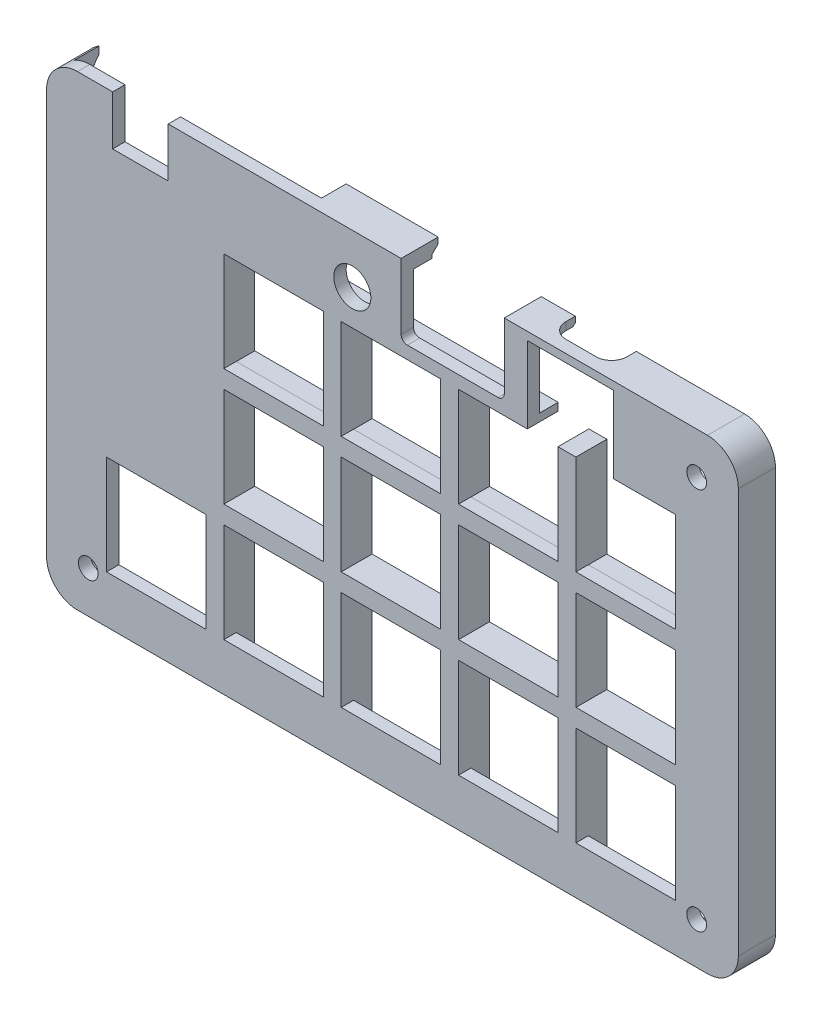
ISO-10303-21;
HEADER;
FILE_DESCRIPTION(('STEP AP214'),'2;1');
FILE_NAME('part.step','',(''),(''),'','','');
FILE_SCHEMA(('AUTOMOTIVE_DESIGN { 1 0 10303 214 1 1 1 1 }'));
ENDSEC;
DATA;
#1=APPLICATION_CONTEXT('core data for automotive mechanical design processes');
#2=APPLICATION_PROTOCOL_DEFINITION('international standard','automotive_design',2000,#1);
#3=PRODUCT_CONTEXT('',#1,'mechanical');
#4=PRODUCT('Part','Part','',(#3));
#5=PRODUCT_RELATED_PRODUCT_CATEGORY('part','',(#4));
#6=PRODUCT_DEFINITION_FORMATION('','',#4);
#7=PRODUCT_DEFINITION_CONTEXT('part definition',#1,'design');
#8=PRODUCT_DEFINITION('design','',#6,#7);
#9=PRODUCT_DEFINITION_SHAPE('','',#8);
#10=(LENGTH_UNIT() NAMED_UNIT(*) SI_UNIT(.MILLI.,.METRE.));
#11=(NAMED_UNIT(*) PLANE_ANGLE_UNIT() SI_UNIT($,.RADIAN.));
#12=(NAMED_UNIT(*) SI_UNIT($,.STERADIAN.) SOLID_ANGLE_UNIT());
#13=UNCERTAINTY_MEASURE_WITH_UNIT(LENGTH_MEASURE(1.E-05),#10,'distance_accuracy_value','');
#14=(GEOMETRIC_REPRESENTATION_CONTEXT(3) GLOBAL_UNCERTAINTY_ASSIGNED_CONTEXT((#13)) GLOBAL_UNIT_ASSIGNED_CONTEXT((#10,
#11,#12)) REPRESENTATION_CONTEXT('',''));
#15=CARTESIAN_POINT('',(0.,0.,0.));
#16=DIRECTION('',(0.,0.,1.));
#17=DIRECTION('',(1.,0.,0.));
#18=AXIS2_PLACEMENT_3D('',#15,#16,#17);
#19=CARTESIAN_POINT('',(104.25,72.75,-3.));
#20=DIRECTION('',(0.,1.,0.));
#21=DIRECTION('',(-1.,0.,0.));
#22=AXIS2_PLACEMENT_3D('',#19,#20,#21);
#23=PLANE('',#22);
#24=DIRECTION('',(0.,0.,-1.));
#25=VECTOR('',#24,1.);
#26=CARTESIAN_POINT('',(16.95,72.75,-3.));
#27=LINE('',#26,#25);
#28=CARTESIAN_POINT('',(16.95,72.75,2.));
#29=VERTEX_POINT('',#28);
#30=CARTESIAN_POINT('',(16.95,72.75,0.));
#31=VERTEX_POINT('',#30);
#32=EDGE_CURVE('E12',#29,#31,#27,.T.);
#33=ORIENTED_EDGE('',*,*,#32,.F.);
#34=DIRECTION('',(-1.,0.,0.));
#35=VECTOR('',#34,1.);
#36=CARTESIAN_POINT('',(2.25,72.75,2.));
#37=LINE('',#36,#35);
#38=CARTESIAN_POINT('',(54.65,72.75,2.));
#39=VERTEX_POINT('',#38);
#40=EDGE_CURVE('E1623',#39,#29,#37,.T.);
#41=ORIENTED_EDGE('',*,*,#40,.F.);
#42=DIRECTION('',(0.,0.,1.));
#43=VECTOR('',#42,1.);
#44=CARTESIAN_POINT('',(54.65,72.75,-3.));
#45=LINE('',#44,#43);
#46=CARTESIAN_POINT('',(54.65,72.75,-4.));
#47=VERTEX_POINT('',#46);
#48=EDGE_CURVE('E2643',#47,#39,#45,.T.);
#49=ORIENTED_EDGE('',*,*,#48,.F.);
#50=DIRECTION('',(1.,0.,0.));
#51=VECTOR('',#50,1.);
#52=CARTESIAN_POINT('',(2.24999999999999,72.75,-4.));
#53=LINE('',#52,#51);
#54=CARTESIAN_POINT('',(39.75,72.75,-4.));
#55=VERTEX_POINT('',#54);
#56=EDGE_CURVE('E2700',#55,#47,#53,.T.);
#57=ORIENTED_EDGE('',*,*,#56,.F.);
#58=DIRECTION('',(0.,0.,-1.));
#59=VECTOR('',#58,1.);
#60=CARTESIAN_POINT('',(39.75,72.75,-3.));
#61=LINE('',#60,#59);
#62=CARTESIAN_POINT('',(39.75,72.75,0.));
#63=VERTEX_POINT('',#62);
#64=EDGE_CURVE('E2615',#63,#55,#61,.T.);
#65=ORIENTED_EDGE('',*,*,#64,.F.);
#66=DIRECTION('',(1.,0.,0.));
#67=VECTOR('',#66,1.);
#68=CARTESIAN_POINT('',(104.25,72.75,0.));
#69=LINE('',#68,#67);
#70=EDGE_CURVE('E1625',#31,#63,#69,.T.);
#71=ORIENTED_EDGE('',*,*,#70,.F.);
#72=EDGE_LOOP('',(#33,#41,#49,#57,#65,#71));
#73=FACE_BOUND('',#72,.T.);
#74=ADVANCED_FACE('F788',(#73),#23,.T.);
#75=CARTESIAN_POINT('',(24.5,60.2936562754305,-119.728635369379));
#76=DIRECTION('',(0.,-1.,0.));
#77=DIRECTION('',(0.,0.,-1.));
#78=AXIS2_PLACEMENT_3D('',#75,#76,#77);
#79=PLANE('',#78);
#80=DIRECTION('',(1.,0.,0.));
#81=VECTOR('',#80,1.);
#82=CARTESIAN_POINT('',(24.5,60.2936562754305,0.));
#83=LINE('',#82,#81);
#84=CARTESIAN_POINT('',(24.5,60.2936562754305,0.));
#85=VERTEX_POINT('',#84);
#86=CARTESIAN_POINT('',(75.0794533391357,60.2936562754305,0.));
#87=VERTEX_POINT('',#86);
#88=EDGE_CURVE('E1955',#85,#87,#83,.T.);
#89=ORIENTED_EDGE('',*,*,#88,.T.);
#90=DIRECTION('',(0.,0.,1.));
#91=VECTOR('',#90,1.);
#92=CARTESIAN_POINT('',(75.0794533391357,60.2936562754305,2.));
#93=LINE('',#92,#91);
#94=CARTESIAN_POINT('',(75.0794533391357,60.2936562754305,-3.));
#95=VERTEX_POINT('',#94);
#96=EDGE_CURVE('E3070',#95,#87,#93,.T.);
#97=ORIENTED_EDGE('',*,*,#96,.F.);
#98=DIRECTION('',(-1.,0.,0.));
#99=VECTOR('',#98,1.);
#100=CARTESIAN_POINT('',(24.5,60.2936562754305,-3.));
#101=LINE('',#100,#99);
#102=CARTESIAN_POINT('',(24.5,60.2936562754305,-3.));
#103=VERTEX_POINT('',#102);
#104=EDGE_CURVE('E1864',#95,#103,#101,.T.);
#105=ORIENTED_EDGE('',*,*,#104,.T.);
#106=DIRECTION('',(0.,0.,1.));
#107=VECTOR('',#106,1.);
#108=CARTESIAN_POINT('',(24.5,60.2936562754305,-119.728635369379));
#109=LINE('',#108,#107);
#110=EDGE_CURVE('E1988',#103,#85,#109,.T.);
#111=ORIENTED_EDGE('',*,*,#110,.T.);
#112=EDGE_LOOP('',(#89,#97,#105,#111));
#113=FACE_BOUND('',#112,.T.);
#114=ADVANCED_FACE('F2459',(#113),#79,.F.);
#115=CARTESIAN_POINT('',(2.24999999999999,70.8,-3.00000000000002));
#116=DIRECTION('',(0.,0.707106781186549,0.707106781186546));
#117=DIRECTION('',(1.,0.,0.));
#118=AXIS2_PLACEMENT_3D('',#115,#116,#117);
#119=PLANE('',#118);
#120=DIRECTION('',(1.,0.,0.));
#121=VECTOR('',#120,1.);
#122=CARTESIAN_POINT('',(2.24999999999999,70.8,-3.));
#123=LINE('',#122,#121);
#124=CARTESIAN_POINT('',(89.0036718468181,70.8,-3.));
#125=VERTEX_POINT('',#124);
#126=CARTESIAN_POINT('',(104.25,70.8,-3.));
#127=VERTEX_POINT('',#126);
#128=EDGE_CURVE('E2678',#125,#127,#123,.T.);
#129=ORIENTED_EDGE('',*,*,#128,.F.);
#130=DIRECTION('',(0.,-0.707106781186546,0.707106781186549));
#131=VECTOR('',#130,1.);
#132=CARTESIAN_POINT('',(89.0036718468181,70.8,-3.00000000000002));
#133=LINE('',#132,#131);
#134=CARTESIAN_POINT('',(89.0036718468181,71.4533926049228,-3.65339260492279));
#135=VERTEX_POINT('',#134);
#136=EDGE_CURVE('E2590',#125,#135,#133,.F.);
#137=ORIENTED_EDGE('',*,*,#136,.T.);
#138=DIRECTION('',(1.,0.,0.));
#139=VECTOR('',#138,1.);
#140=CARTESIAN_POINT('',(2.24999999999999,71.4533926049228,-3.65339260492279));
#141=LINE('',#140,#139);
#142=CARTESIAN_POINT('',(86.728343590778,71.4533926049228,-3.65339260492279));
#143=VERTEX_POINT('',#142);
#144=EDGE_CURVE('E2574',#135,#143,#141,.F.);
#145=ORIENTED_EDGE('',*,*,#144,.T.);
#146=DIRECTION('',(0.,0.707106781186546,-0.707106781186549));
#147=VECTOR('',#146,1.);
#148=CARTESIAN_POINT('',(86.728343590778,70.8,-3.00000000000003));
#149=LINE('',#148,#147);
#150=CARTESIAN_POINT('',(86.728343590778,71.8,-4.));
#151=VERTEX_POINT('',#150);
#152=EDGE_CURVE('E2603',#151,#143,#149,.F.);
#153=ORIENTED_EDGE('',*,*,#152,.F.);
#154=DIRECTION('',(-1.,0.,0.));
#155=VECTOR('',#154,1.);
#156=CARTESIAN_POINT('',(2.24999999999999,71.8,-4.));
#157=LINE('',#156,#155);
#158=CARTESIAN_POINT('',(104.25,71.8,-4.));
#159=VERTEX_POINT('',#158);
#160=EDGE_CURVE('E2047',#159,#151,#157,.T.);
#161=ORIENTED_EDGE('',*,*,#160,.F.);
#162=DIRECTION('',(0.,-0.707106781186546,0.707106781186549));
#163=VECTOR('',#162,1.);
#164=CARTESIAN_POINT('',(104.25,71.8,-4.));
#165=LINE('',#164,#163);
#166=EDGE_CURVE('E2077',#159,#127,#165,.T.);
#167=ORIENTED_EDGE('',*,*,#166,.T.);
#168=EDGE_LOOP('',(#129,#137,#145,#153,#161,#167));
#169=FACE_BOUND('',#168,.T.);
#170=ADVANCED_FACE('F2542',(#169),#119,.F.);
#171=DIRECTION('',(1.,0.,0.));
#172=VECTOR('',#171,1.);
#173=CARTESIAN_POINT('',(2.24999999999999,71.4533926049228,-3.65339260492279));
#174=LINE('',#173,#172);
#175=CARTESIAN_POINT('',(76.8423722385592,71.4533926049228,-3.65339260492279));
#176=VERTEX_POINT('',#175);
#177=CARTESIAN_POINT('',(75.0794533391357,71.4533926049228,-3.65339260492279));
#178=VERTEX_POINT('',#177);
#179=EDGE_CURVE('E2570',#176,#178,#174,.F.);
#180=ORIENTED_EDGE('',*,*,#179,.T.);
#181=DIRECTION('',(0.,0.707106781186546,-0.707106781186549));
#182=VECTOR('',#181,1.);
#183=CARTESIAN_POINT('',(75.0794533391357,70.8,-3.00000000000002));
#184=LINE('',#183,#182);
#185=CARTESIAN_POINT('',(75.0794533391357,70.8,-3.));
#186=VERTEX_POINT('',#185);
#187=EDGE_CURVE('E2583',#178,#186,#184,.F.);
#188=ORIENTED_EDGE('',*,*,#187,.T.);
#189=CARTESIAN_POINT('',(71.35,70.8,-3.00000000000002));
#190=VERTEX_POINT('',#189);
#191=EDGE_CURVE('E2682',#190,#186,#123,.T.);
#192=ORIENTED_EDGE('',*,*,#191,.F.);
#193=DIRECTION('',(0.,0.707106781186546,-0.707106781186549));
#194=VECTOR('',#193,1.);
#195=CARTESIAN_POINT('',(71.35,70.8,-3.00000000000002));
#196=LINE('',#195,#194);
#197=CARTESIAN_POINT('',(71.35,71.8,-4.));
#198=VERTEX_POINT('',#197);
#199=EDGE_CURVE('E2085',#198,#190,#196,.F.);
#200=ORIENTED_EDGE('',*,*,#199,.F.);
#201=CARTESIAN_POINT('',(76.8423722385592,71.8,-4.));
#202=VERTEX_POINT('',#201);
#203=EDGE_CURVE('E2051',#202,#198,#157,.T.);
#204=ORIENTED_EDGE('',*,*,#203,.F.);
#205=DIRECTION('',(0.,-0.707106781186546,0.707106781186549));
#206=VECTOR('',#205,1.);
#207=CARTESIAN_POINT('',(76.8423722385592,70.8,-3.00000000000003));
#208=LINE('',#207,#206);
#209=EDGE_CURVE('E2595',#176,#202,#208,.F.);
#210=ORIENTED_EDGE('',*,*,#209,.F.);
#211=EDGE_LOOP('',(#180,#188,#192,#200,#204,#210));
#212=FACE_BOUND('',#211,.T.);
#213=ADVANCED_FACE('F3118',(#212),#119,.F.);
#214=CARTESIAN_POINT('',(2.24999999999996,67.75,0.));
#215=DIRECTION('',(0.,0.,1.));
#216=DIRECTION('',(1.,0.,0.));
#217=AXIS2_PLACEMENT_3D('',#214,#215,#216);
#218=PLANE('',#217);
#219=CARTESIAN_POINT('',(102.5,66.,0.));
#220=DIRECTION('',(0.,0.,-1.));
#221=DIRECTION('',(-1.,0.,0.));
#222=AXIS2_PLACEMENT_3D('',#219,#220,#221);
#223=CIRCLE('',#222,1.60000000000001);
#224=CARTESIAN_POINT('',(100.9,66.,0.));
#225=VERTEX_POINT('',#224);
#226=EDGE_CURVE('E2733',#225,#225,#223,.T.);
#227=ORIENTED_EDGE('',*,*,#226,.F.);
#228=EDGE_LOOP('',(#227));
#229=FACE_BOUND('',#228,.T.);
#230=DIRECTION('',(0.,-1.,0.));
#231=VECTOR('',#230,1.);
#232=CARTESIAN_POINT('',(89.0036718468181,67.75,0.));
#233=LINE('',#232,#231);
#234=CARTESIAN_POINT('',(89.0036718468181,70.25,0.));
#235=VERTEX_POINT('',#234);
#236=CARTESIAN_POINT('',(89.0036718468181,60.2936562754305,0.));
#237=VERTEX_POINT('',#236);
#238=EDGE_CURVE('E2587',#235,#237,#233,.T.);
#239=ORIENTED_EDGE('',*,*,#238,.F.);
#240=DIRECTION('',(-1.,0.,0.));
#241=VECTOR('',#240,1.);
#242=CARTESIAN_POINT('',(104.25,70.25,0.));
#243=LINE('',#242,#241);
#244=CARTESIAN_POINT('',(104.25,70.25,0.));
#245=VERTEX_POINT('',#244);
#246=EDGE_CURVE('E1672',#245,#235,#243,.T.);
#247=ORIENTED_EDGE('',*,*,#246,.F.);
#248=CARTESIAN_POINT('',(104.25,67.75,0.));
#249=DIRECTION('',(0.,0.,1.));
#250=DIRECTION('',(1.,0.,0.));
#251=AXIS2_PLACEMENT_3D('',#248,#249,#250);
#252=CIRCLE('',#251,2.50000000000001);
#253=CARTESIAN_POINT('',(106.75,67.75,0.));
#254=VERTEX_POINT('',#253);
#255=EDGE_CURVE('E1636',#254,#245,#252,.T.);
#256=ORIENTED_EDGE('',*,*,#255,.F.);
#257=DIRECTION('',(0.,1.,0.));
#258=VECTOR('',#257,1.);
#259=CARTESIAN_POINT('',(106.75,2.25000000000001,0.));
#260=LINE('',#259,#258);
#261=CARTESIAN_POINT('',(106.75,60.2936562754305,0.));
#262=VERTEX_POINT('',#261);
#263=EDGE_CURVE('E1689',#262,#254,#260,.T.);
#264=ORIENTED_EDGE('',*,*,#263,.F.);
#265=EDGE_CURVE('E1954',#237,#262,#83,.T.);
#266=ORIENTED_EDGE('',*,*,#265,.F.);
#267=EDGE_LOOP('',(#239,#247,#256,#264,#266));
#268=FACE_BOUND('',#267,.T.);
#269=ADVANCED_FACE('F2254',(#229,#268),#218,.F.);
#270=CARTESIAN_POINT('',(46.75,64.75,0.));
#271=DIRECTION('',(0.,0.,-1.));
#272=DIRECTION('',(-1.,0.,0.));
#273=AXIS2_PLACEMENT_3D('',#270,#271,#272);
#274=CIRCLE('',#273,3.);
#275=CARTESIAN_POINT('',(43.75,64.75,0.));
#276=VERTEX_POINT('',#275);
#277=EDGE_CURVE('E3086',#276,#276,#274,.T.);
#278=ORIENTED_EDGE('',*,*,#277,.F.);
#279=EDGE_LOOP('',(#278));
#280=FACE_BOUND('',#279,.T.);
#281=DIRECTION('',(1.,0.,0.));
#282=VECTOR('',#281,1.);
#283=CARTESIAN_POINT('',(2.24999999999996,64.75,0.));
#284=LINE('',#283,#282);
#285=CARTESIAN_POINT('',(7.95,64.75,0.));
#286=VERTEX_POINT('',#285);
#287=CARTESIAN_POINT('',(16.95,64.75,0.));
#288=VERTEX_POINT('',#287);
#289=EDGE_CURVE('E3063',#286,#288,#284,.T.);
#290=ORIENTED_EDGE('',*,*,#289,.T.);
#291=DIRECTION('',(0.,1.,0.));
#292=VECTOR('',#291,1.);
#293=CARTESIAN_POINT('',(16.95,67.75,0.));
#294=LINE('',#293,#292);
#295=EDGE_CURVE('E3062',#288,#31,#294,.T.);
#296=ORIENTED_EDGE('',*,*,#295,.T.);
#297=ORIENTED_EDGE('',*,*,#70,.T.);
#298=DIRECTION('',(0.,-1.,0.));
#299=VECTOR('',#298,1.);
#300=CARTESIAN_POINT('',(39.75,74.25,0.));
#301=LINE('',#300,#299);
#302=CARTESIAN_POINT('',(39.75,70.25,0.));
#303=VERTEX_POINT('',#302);
#304=EDGE_CURVE('E2611',#63,#303,#301,.T.);
#305=ORIENTED_EDGE('',*,*,#304,.T.);
#306=CARTESIAN_POINT('',(54.65,70.25,0.));
#307=VERTEX_POINT('',#306);
#308=EDGE_CURVE('E1671',#307,#303,#243,.T.);
#309=ORIENTED_EDGE('',*,*,#308,.F.);
#310=DIRECTION('',(0.,-1.,0.));
#311=VECTOR('',#310,1.);
#312=CARTESIAN_POINT('',(54.65,67.75,0.));
#313=LINE('',#312,#311);
#314=CARTESIAN_POINT('',(54.65,62.1,0.));
#315=VERTEX_POINT('',#314);
#316=EDGE_CURVE('E2651',#307,#315,#313,.T.);
#317=ORIENTED_EDGE('',*,*,#316,.T.);
#318=CARTESIAN_POINT('',(55.65,62.1,0.));
#319=DIRECTION('',(0.,0.,1.));
#320=DIRECTION('',(1.,0.,0.));
#321=AXIS2_PLACEMENT_3D('',#318,#319,#320);
#322=CIRCLE('',#321,1.);
#323=CARTESIAN_POINT('',(55.65,61.1,0.));
#324=VERTEX_POINT('',#323);
#325=EDGE_CURVE('E2668',#315,#324,#322,.T.);
#326=ORIENTED_EDGE('',*,*,#325,.T.);
#327=DIRECTION('',(1.,0.,0.));
#328=VECTOR('',#327,1.);
#329=CARTESIAN_POINT('',(2.24999999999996,61.1,0.));
#330=LINE('',#329,#328);
#331=CARTESIAN_POINT('',(70.35,61.1,0.));
#332=VERTEX_POINT('',#331);
#333=EDGE_CURVE('E2671',#324,#332,#330,.T.);
#334=ORIENTED_EDGE('',*,*,#333,.T.);
#335=CARTESIAN_POINT('',(70.35,62.1,0.));
#336=DIRECTION('',(0.,0.,1.));
#337=DIRECTION('',(1.,0.,0.));
#338=AXIS2_PLACEMENT_3D('',#335,#336,#337);
#339=CIRCLE('',#338,1.);
#340=CARTESIAN_POINT('',(71.35,62.1,0.));
#341=VERTEX_POINT('',#340);
#342=EDGE_CURVE('E2066',#332,#341,#339,.T.);
#343=ORIENTED_EDGE('',*,*,#342,.T.);
#344=DIRECTION('',(0.,1.,0.));
#345=VECTOR('',#344,1.);
#346=CARTESIAN_POINT('',(71.35,67.75,0.));
#347=LINE('',#346,#345);
#348=CARTESIAN_POINT('',(71.35,70.25,0.));
#349=VERTEX_POINT('',#348);
#350=EDGE_CURVE('E2665',#341,#349,#347,.T.);
#351=ORIENTED_EDGE('',*,*,#350,.T.);
#352=CARTESIAN_POINT('',(75.0794533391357,70.25,0.));
#353=VERTEX_POINT('',#352);
#354=EDGE_CURVE('E1676',#353,#349,#243,.T.);
#355=ORIENTED_EDGE('',*,*,#354,.F.);
#356=DIRECTION('',(0.,1.,0.));
#357=VECTOR('',#356,1.);
#358=CARTESIAN_POINT('',(75.0794533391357,67.75,0.));
#359=LINE('',#358,#357);
#360=EDGE_CURVE('E2585',#87,#353,#359,.T.);
#361=ORIENTED_EDGE('',*,*,#360,.F.);
#362=ORIENTED_EDGE('',*,*,#88,.F.);
#363=DIRECTION('',(0.,-1.,0.));
#364=VECTOR('',#363,1.);
#365=CARTESIAN_POINT('',(24.5,59.05,0.));
#366=LINE('',#365,#364);
#367=CARTESIAN_POINT('',(24.5,25.4978086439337,0.));
#368=VERTEX_POINT('',#367);
#369=EDGE_CURVE('E1958',#85,#368,#366,.T.);
#370=ORIENTED_EDGE('',*,*,#369,.T.);
#371=DIRECTION('',(0.683672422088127,0.729789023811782,0.));
#372=VECTOR('',#371,1.);
#373=CARTESIAN_POINT('',(23.05,23.95,0.));
#374=LINE('',#373,#372);
#375=CARTESIAN_POINT('',(23.05,23.95,0.));
#376=VERTEX_POINT('',#375);
#377=EDGE_CURVE('E1961',#376,#368,#374,.T.);
#378=ORIENTED_EDGE('',*,*,#377,.F.);
#379=DIRECTION('',(1.,0.,0.));
#380=VECTOR('',#379,1.);
#381=CARTESIAN_POINT('',(6.95,23.95,0.));
#382=LINE('',#381,#380);
#383=CARTESIAN_POINT('',(6.95,23.95,0.));
#384=VERTEX_POINT('',#383);
#385=EDGE_CURVE('E1964',#384,#376,#382,.T.);
#386=ORIENTED_EDGE('',*,*,#385,.F.);
#387=DIRECTION('',(0.,1.,0.));
#388=VECTOR('',#387,1.);
#389=CARTESIAN_POINT('',(6.95,21.05,0.));
#390=LINE('',#389,#388);
#391=CARTESIAN_POINT('',(6.95,21.05,0.));
#392=VERTEX_POINT('',#391);
#393=EDGE_CURVE('E1967',#392,#384,#390,.T.);
#394=ORIENTED_EDGE('',*,*,#393,.F.);
#395=DIRECTION('',(0.,-1.,0.));
#396=VECTOR('',#395,1.);
#397=CARTESIAN_POINT('',(6.95,4.95,0.));
#398=LINE('',#397,#396);
#399=CARTESIAN_POINT('',(6.95,4.95,0.));
#400=VERTEX_POINT('',#399);
#401=EDGE_CURVE('E2811',#392,#400,#398,.T.);
#402=ORIENTED_EDGE('',*,*,#401,.T.);
#403=DIRECTION('',(1.,0.,0.));
#404=VECTOR('',#403,1.);
#405=CARTESIAN_POINT('',(23.05,4.95,0.));
#406=LINE('',#405,#404);
#407=CARTESIAN_POINT('',(23.05,4.95000000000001,0.));
#408=VERTEX_POINT('',#407);
#409=EDGE_CURVE('E2814',#400,#408,#406,.T.);
#410=ORIENTED_EDGE('',*,*,#409,.T.);
#411=DIRECTION('',(0.,1.,0.));
#412=VECTOR('',#411,1.);
#413=CARTESIAN_POINT('',(23.05,21.05,0.));
#414=LINE('',#413,#412);
#415=CARTESIAN_POINT('',(23.05,-0.25,0.));
#416=VERTEX_POINT('',#415);
#417=EDGE_CURVE('E1740',#416,#408,#414,.T.);
#418=ORIENTED_EDGE('',*,*,#417,.F.);
#419=DIRECTION('',(1.,0.,0.));
#420=VECTOR('',#419,1.);
#421=CARTESIAN_POINT('',(104.25,-0.249999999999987,0.));
#422=LINE('',#421,#420);
#423=CARTESIAN_POINT('',(2.24999999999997,-0.25,0.));
#424=VERTEX_POINT('',#423);
#425=EDGE_CURVE('E1682',#424,#416,#422,.T.);
#426=ORIENTED_EDGE('',*,*,#425,.F.);
#427=CARTESIAN_POINT('',(2.24999999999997,2.25,0.));
#428=DIRECTION('',(0.,0.,1.));
#429=DIRECTION('',(-1.,0.,0.));
#430=AXIS2_PLACEMENT_3D('',#427,#428,#429);
#431=CIRCLE('',#430,2.5);
#432=CARTESIAN_POINT('',(-0.250000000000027,2.25,0.));
#433=VERTEX_POINT('',#432);
#434=EDGE_CURVE('E1678',#433,#424,#431,.T.);
#435=ORIENTED_EDGE('',*,*,#434,.F.);
#436=DIRECTION('',(0.,-1.,0.));
#437=VECTOR('',#436,1.);
#438=CARTESIAN_POINT('',(-0.250000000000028,2.25,0.));
#439=LINE('',#438,#437);
#440=CARTESIAN_POINT('',(-0.250000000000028,72.0801270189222,0.));
#441=VERTEX_POINT('',#440);
#442=EDGE_CURVE('E1675',#441,#433,#439,.T.);
#443=ORIENTED_EDGE('',*,*,#442,.F.);
#444=CARTESIAN_POINT('',(2.24999999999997,67.75,0.));
#445=DIRECTION('',(0.,0.,1.));
#446=DIRECTION('',(1.,0.,0.));
#447=AXIS2_PLACEMENT_3D('',#444,#445,#446);
#448=CIRCLE('',#447,5.);
#449=CARTESIAN_POINT('',(2.25,72.75,0.));
#450=VERTEX_POINT('',#449);
#451=EDGE_CURVE('E3089',#441,#450,#448,.F.);
#452=ORIENTED_EDGE('',*,*,#451,.T.);
#453=CARTESIAN_POINT('',(7.95,72.75,0.));
#454=VERTEX_POINT('',#453);
#455=EDGE_CURVE('E2089',#450,#454,#69,.T.);
#456=ORIENTED_EDGE('',*,*,#455,.T.);
#457=DIRECTION('',(0.,-1.,0.));
#458=VECTOR('',#457,1.);
#459=CARTESIAN_POINT('',(7.95,67.75,0.));
#460=LINE('',#459,#458);
#461=EDGE_CURVE('E803',#454,#286,#460,.T.);
#462=ORIENTED_EDGE('',*,*,#461,.T.);
#463=EDGE_LOOP('',(#290,#296,#297,#305,#309,#317,#326,#334,#343,#351,#355,#361,#362,#370,#378,
#386,#394,#402,#410,#418,#426,#435,#443,#452,#456,#462));
#464=FACE_BOUND('',#463,.T.);
#465=CARTESIAN_POINT('',(4.,4.,0.));
#466=DIRECTION('',(0.,0.,-1.));
#467=DIRECTION('',(-1.,0.,0.));
#468=AXIS2_PLACEMENT_3D('',#465,#466,#467);
#469=CIRCLE('',#468,1.6);
#470=CARTESIAN_POINT('',(2.4,4.,0.));
#471=VERTEX_POINT('',#470);
#472=EDGE_CURVE('E2738',#471,#471,#469,.T.);
#473=ORIENTED_EDGE('',*,*,#472,.F.);
#474=EDGE_LOOP('',(#473));
#475=FACE_BOUND('',#474,.T.);
#476=ADVANCED_FACE('F3051',(#280,#464,#475),#218,.F.);
#477=DIRECTION('',(1.,0.,0.));
#478=VECTOR('',#477,1.);
#479=CARTESIAN_POINT('',(104.25,72.75,0.));
#480=LINE('',#479,#478);
#481=CARTESIAN_POINT('',(79.3423722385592,72.75,0.));
#482=VERTEX_POINT('',#481);
#483=CARTESIAN_POINT('',(84.228343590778,72.75,0.));
#484=VERTEX_POINT('',#483);
#485=EDGE_CURVE('E2557',#482,#484,#480,.T.);
#486=ORIENTED_EDGE('',*,*,#485,.T.);
#487=DIRECTION('',(0.,-1.,0.));
#488=VECTOR('',#487,1.);
#489=CARTESIAN_POINT('',(84.228343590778,71.4533926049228,0.));
#490=LINE('',#489,#488);
#491=CARTESIAN_POINT('',(84.228343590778,71.4533926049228,0.));
#492=VERTEX_POINT('',#491);
#493=EDGE_CURVE('E2094',#484,#492,#490,.T.);
#494=ORIENTED_EDGE('',*,*,#493,.T.);
#495=DIRECTION('',(1.,0.,0.));
#496=VECTOR('',#495,1.);
#497=CARTESIAN_POINT('',(2.24999999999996,71.4533926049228,0.));
#498=LINE('',#497,#496);
#499=CARTESIAN_POINT('',(79.3423722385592,71.4533926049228,0.));
#500=VERTEX_POINT('',#499);
#501=EDGE_CURVE('E2566',#500,#492,#498,.T.);
#502=ORIENTED_EDGE('',*,*,#501,.F.);
#503=DIRECTION('',(0.,-1.,0.));
#504=VECTOR('',#503,1.);
#505=CARTESIAN_POINT('',(79.3423722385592,72.75,0.));
#506=LINE('',#505,#504);
#507=EDGE_CURVE('E2092',#500,#482,#506,.F.);
#508=ORIENTED_EDGE('',*,*,#507,.T.);
#509=EDGE_LOOP('',(#486,#494,#502,#508));
#510=FACE_BOUND('',#509,.T.);
#511=ADVANCED_FACE('F2249',(#510),#218,.F.);
#512=CARTESIAN_POINT('',(2.24999999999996,67.75,2.));
#513=DIRECTION('',(0.,0.,1.));
#514=DIRECTION('',(1.,0.,0.));
#515=AXIS2_PLACEMENT_3D('',#512,#513,#514);
#516=PLANE('',#515);
#517=DIRECTION('',(0.,1.,0.));
#518=VECTOR('',#517,1.);
#519=CARTESIAN_POINT('',(16.95,72.75,2.));
#520=LINE('',#519,#518);
#521=CARTESIAN_POINT('',(16.95,64.75,2.));
#522=VERTEX_POINT('',#521);
#523=EDGE_CURVE('E1607',#522,#29,#520,.T.);
#524=ORIENTED_EDGE('',*,*,#523,.F.);
#525=DIRECTION('',(1.,0.,0.));
#526=VECTOR('',#525,1.);
#527=CARTESIAN_POINT('',(16.95,64.75,2.));
#528=LINE('',#527,#526);
#529=CARTESIAN_POINT('',(7.95,64.75,2.));
#530=VERTEX_POINT('',#529);
#531=EDGE_CURVE('E3142',#530,#522,#528,.T.);
#532=ORIENTED_EDGE('',*,*,#531,.F.);
#533=DIRECTION('',(0.,-1.,0.));
#534=VECTOR('',#533,1.);
#535=CARTESIAN_POINT('',(7.95,72.75,2.));
#536=LINE('',#535,#534);
#537=CARTESIAN_POINT('',(7.95,72.75,2.));
#538=VERTEX_POINT('',#537);
#539=EDGE_CURVE('E1617',#538,#530,#536,.T.);
#540=ORIENTED_EDGE('',*,*,#539,.F.);
#541=CARTESIAN_POINT('',(2.25,72.75,2.));
#542=VERTEX_POINT('',#541);
#543=EDGE_CURVE('E1633',#538,#542,#37,.T.);
#544=ORIENTED_EDGE('',*,*,#543,.T.);
#545=CARTESIAN_POINT('',(2.24999999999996,67.75,2.));
#546=DIRECTION('',(0.,0.,1.));
#547=DIRECTION('',(1.,0.,0.));
#548=AXIS2_PLACEMENT_3D('',#545,#546,#547);
#549=CIRCLE('',#548,5.);
#550=CARTESIAN_POINT('',(-2.75000000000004,67.75,2.));
#551=VERTEX_POINT('',#550);
#552=EDGE_CURVE('E2989',#542,#551,#549,.T.);
#553=ORIENTED_EDGE('',*,*,#552,.T.);
#554=DIRECTION('',(0.,-1.,0.));
#555=VECTOR('',#554,1.);
#556=CARTESIAN_POINT('',(-2.75000000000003,2.25000000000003,2.));
#557=LINE('',#556,#555);
#558=CARTESIAN_POINT('',(-2.75000000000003,2.25,2.));
#559=VERTEX_POINT('',#558);
#560=EDGE_CURVE('E2994',#551,#559,#557,.T.);
#561=ORIENTED_EDGE('',*,*,#560,.T.);
#562=CARTESIAN_POINT('',(2.24999999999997,2.25,2.));
#563=DIRECTION('',(0.,0.,1.));
#564=DIRECTION('',(-1.,0.,0.));
#565=AXIS2_PLACEMENT_3D('',#562,#563,#564);
#566=CIRCLE('',#565,5.);
#567=CARTESIAN_POINT('',(2.25,-2.75,2.));
#568=VERTEX_POINT('',#567);
#569=EDGE_CURVE('E2997',#559,#568,#566,.T.);
#570=ORIENTED_EDGE('',*,*,#569,.T.);
#571=DIRECTION('',(1.,0.,0.));
#572=VECTOR('',#571,1.);
#573=CARTESIAN_POINT('',(104.25,-2.75,2.));
#574=LINE('',#573,#572);
#575=CARTESIAN_POINT('',(104.25,-2.75,2.));
#576=VERTEX_POINT('',#575);
#577=EDGE_CURVE('E3000',#568,#576,#574,.T.);
#578=ORIENTED_EDGE('',*,*,#577,.T.);
#579=CARTESIAN_POINT('',(104.25,2.25,2.));
#580=DIRECTION('',(0.,0.,1.));
#581=DIRECTION('',(-1.,0.,0.));
#582=AXIS2_PLACEMENT_3D('',#579,#580,#581);
#583=CIRCLE('',#582,5.);
#584=CARTESIAN_POINT('',(109.25,2.25000000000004,2.));
#585=VERTEX_POINT('',#584);
#586=EDGE_CURVE('E3003',#576,#585,#583,.T.);
#587=ORIENTED_EDGE('',*,*,#586,.T.);
#588=DIRECTION('',(0.,1.,0.));
#589=VECTOR('',#588,1.);
#590=CARTESIAN_POINT('',(109.25,67.75,2.));
#591=LINE('',#590,#589);
#592=CARTESIAN_POINT('',(109.25,67.75,2.));
#593=VERTEX_POINT('',#592);
#594=EDGE_CURVE('E3005',#585,#593,#591,.T.);
#595=ORIENTED_EDGE('',*,*,#594,.T.);
#596=CARTESIAN_POINT('',(104.25,67.75,2.));
#597=DIRECTION('',(0.,0.,1.));
#598=DIRECTION('',(-1.,0.,0.));
#599=AXIS2_PLACEMENT_3D('',#596,#597,#598);
#600=CIRCLE('',#599,5.);
#601=CARTESIAN_POINT('',(104.25,72.75,2.));
#602=VERTEX_POINT('',#601);
#603=EDGE_CURVE('E1637',#593,#602,#600,.T.);
#604=ORIENTED_EDGE('',*,*,#603,.T.);
#605=CARTESIAN_POINT('',(71.35,72.75,2.));
#606=VERTEX_POINT('',#605);
#607=EDGE_CURVE('E1632',#602,#606,#37,.T.);
#608=ORIENTED_EDGE('',*,*,#607,.T.);
#609=DIRECTION('',(0.,1.,0.));
#610=VECTOR('',#609,1.);
#611=CARTESIAN_POINT('',(71.35,67.8985,2.));
#612=LINE('',#611,#610);
#613=CARTESIAN_POINT('',(71.35,62.1,2.));
#614=VERTEX_POINT('',#613);
#615=EDGE_CURVE('E2630',#614,#606,#612,.T.);
#616=ORIENTED_EDGE('',*,*,#615,.F.);
#617=CARTESIAN_POINT('',(70.35,62.1,2.));
#618=DIRECTION('',(0.,0.,1.));
#619=DIRECTION('',(1.,0.,0.));
#620=AXIS2_PLACEMENT_3D('',#617,#618,#619);
#621=CIRCLE('',#620,1.);
#622=CARTESIAN_POINT('',(70.35,61.1,2.));
#623=VERTEX_POINT('',#622);
#624=EDGE_CURVE('E2627',#623,#614,#621,.T.);
#625=ORIENTED_EDGE('',*,*,#624,.F.);
#626=DIRECTION('',(1.,0.,0.));
#627=VECTOR('',#626,1.);
#628=CARTESIAN_POINT('',(55.65,61.1,2.));
#629=LINE('',#628,#627);
#630=CARTESIAN_POINT('',(55.65,61.1,2.));
#631=VERTEX_POINT('',#630);
#632=EDGE_CURVE('E2624',#631,#623,#629,.T.);
#633=ORIENTED_EDGE('',*,*,#632,.F.);
#634=CARTESIAN_POINT('',(55.65,62.1,2.));
#635=DIRECTION('',(0.,0.,1.));
#636=DIRECTION('',(1.,0.,0.));
#637=AXIS2_PLACEMENT_3D('',#634,#635,#636);
#638=CIRCLE('',#637,1.);
#639=CARTESIAN_POINT('',(54.65,62.1,2.));
#640=VERTEX_POINT('',#639);
#641=EDGE_CURVE('E2621',#640,#631,#638,.T.);
#642=ORIENTED_EDGE('',*,*,#641,.F.);
#643=DIRECTION('',(0.,-1.,0.));
#644=VECTOR('',#643,1.);
#645=CARTESIAN_POINT('',(54.65,67.8985,2.));
#646=LINE('',#645,#644);
#647=EDGE_CURVE('E1631',#39,#640,#646,.T.);
#648=ORIENTED_EDGE('',*,*,#647,.F.);
#649=ORIENTED_EDGE('',*,*,#40,.T.);
#650=EDGE_LOOP('',(#524,#532,#540,#544,#553,#561,#570,#578,#587,#595,#604,#608,#616,#625,#633,
#642,#648,#649));
#651=FACE_BOUND('',#650,.T.);
#652=DIRECTION('',(1.,0.,0.));
#653=VECTOR('',#652,1.);
#654=CARTESIAN_POINT('',(89.0036718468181,59.05,2.));
#655=LINE('',#654,#653);
#656=CARTESIAN_POINT('',(80.05,59.05,2.));
#657=VERTEX_POINT('',#656);
#658=CARTESIAN_POINT('',(82.95,59.05,2.));
#659=VERTEX_POINT('',#658);
#660=EDGE_CURVE('E3078',#657,#659,#655,.T.);
#661=ORIENTED_EDGE('',*,*,#660,.F.);
#662=DIRECTION('',(0.,1.,0.));
#663=VECTOR('',#662,1.);
#664=CARTESIAN_POINT('',(80.05,42.95,2.));
#665=LINE('',#664,#663);
#666=CARTESIAN_POINT('',(80.05,42.95,2.));
#667=VERTEX_POINT('',#666);
#668=EDGE_CURVE('E2966',#667,#657,#665,.T.);
#669=ORIENTED_EDGE('',*,*,#668,.F.);
#670=DIRECTION('',(1.,0.,0.));
#671=VECTOR('',#670,1.);
#672=CARTESIAN_POINT('',(80.05,42.95,2.));
#673=LINE('',#672,#671);
#674=CARTESIAN_POINT('',(63.95,42.95,2.));
#675=VERTEX_POINT('',#674);
#676=EDGE_CURVE('E2963',#675,#667,#673,.T.);
#677=ORIENTED_EDGE('',*,*,#676,.F.);
#678=DIRECTION('',(0.,-1.,0.));
#679=VECTOR('',#678,1.);
#680=CARTESIAN_POINT('',(63.95,42.95,2.));
#681=LINE('',#680,#679);
#682=CARTESIAN_POINT('',(63.95,59.05,2.));
#683=VERTEX_POINT('',#682);
#684=EDGE_CURVE('E2921',#683,#675,#681,.T.);
#685=ORIENTED_EDGE('',*,*,#684,.F.);
#686=DIRECTION('',(-1.,0.,0.));
#687=VECTOR('',#686,1.);
#688=CARTESIAN_POINT('',(80.05,59.05,2.));
#689=LINE('',#688,#687);
#690=CARTESIAN_POINT('',(75.0794533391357,59.05,2.));
#691=VERTEX_POINT('',#690);
#692=EDGE_CURVE('E2961',#691,#683,#689,.T.);
#693=ORIENTED_EDGE('',*,*,#692,.F.);
#694=DIRECTION('',(0.,1.,0.));
#695=VECTOR('',#694,1.);
#696=CARTESIAN_POINT('',(75.0794533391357,60.2936562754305,2.));
#697=LINE('',#696,#695);
#698=CARTESIAN_POINT('',(75.0794533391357,71.4533926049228,2.));
#699=VERTEX_POINT('',#698);
#700=EDGE_CURVE('E2577',#691,#699,#697,.T.);
#701=ORIENTED_EDGE('',*,*,#700,.T.);
#702=DIRECTION('',(1.,0.,0.));
#703=VECTOR('',#702,1.);
#704=CARTESIAN_POINT('',(89.0036718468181,71.4533926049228,2.));
#705=LINE('',#704,#703);
#706=CARTESIAN_POINT('',(89.0036718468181,71.4533926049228,2.));
#707=VERTEX_POINT('',#706);
#708=EDGE_CURVE('E2571',#699,#707,#705,.T.);
#709=ORIENTED_EDGE('',*,*,#708,.T.);
#710=DIRECTION('',(0.,-1.,0.));
#711=VECTOR('',#710,1.);
#712=CARTESIAN_POINT('',(89.0036718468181,60.2936562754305,2.));
#713=LINE('',#712,#711);
#714=CARTESIAN_POINT('',(89.0036718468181,59.05,2.));
#715=VERTEX_POINT('',#714);
#716=EDGE_CURVE('E3097',#707,#715,#713,.T.);
#717=ORIENTED_EDGE('',*,*,#716,.T.);
#718=DIRECTION('',(-1.,0.,0.));
#719=VECTOR('',#718,1.);
#720=CARTESIAN_POINT('',(99.05,59.05,2.));
#721=LINE('',#720,#719);
#722=CARTESIAN_POINT('',(99.05,59.05,2.));
#723=VERTEX_POINT('',#722);
#724=EDGE_CURVE('E2904',#723,#715,#721,.T.);
#725=ORIENTED_EDGE('',*,*,#724,.F.);
#726=DIRECTION('',(0.,1.,0.));
#727=VECTOR('',#726,1.);
#728=CARTESIAN_POINT('',(99.05,42.95,2.));
#729=LINE('',#728,#727);
#730=CARTESIAN_POINT('',(99.05,42.95,2.));
#731=VERTEX_POINT('',#730);
#732=EDGE_CURVE('E2914',#731,#723,#729,.T.);
#733=ORIENTED_EDGE('',*,*,#732,.F.);
#734=DIRECTION('',(1.,0.,0.));
#735=VECTOR('',#734,1.);
#736=CARTESIAN_POINT('',(99.05,42.95,2.));
#737=LINE('',#736,#735);
#738=CARTESIAN_POINT('',(82.95,42.95,2.));
#739=VERTEX_POINT('',#738);
#740=EDGE_CURVE('E2910',#739,#731,#737,.T.);
#741=ORIENTED_EDGE('',*,*,#740,.F.);
#742=DIRECTION('',(0.,-1.,0.));
#743=VECTOR('',#742,1.);
#744=CARTESIAN_POINT('',(82.95,42.95,2.));
#745=LINE('',#744,#743);
#746=EDGE_CURVE('E2908',#659,#739,#745,.T.);
#747=ORIENTED_EDGE('',*,*,#746,.F.);
#748=EDGE_LOOP('',(#661,#669,#677,#685,#693,#701,#709,#717,#725,#733,#741,#747));
#749=FACE_BOUND('',#748,.T.);
#750=CARTESIAN_POINT('',(46.75,64.75,2.));
#751=DIRECTION('',(0.,0.,1.));
#752=DIRECTION('',(1.,0.,0.));
#753=AXIS2_PLACEMENT_3D('',#750,#751,#752);
#754=CIRCLE('',#753,3.);
#755=CARTESIAN_POINT('',(49.75,64.75,2.));
#756=VERTEX_POINT('',#755);
#757=EDGE_CURVE('E2118',#756,#756,#754,.T.);
#758=ORIENTED_EDGE('',*,*,#757,.F.);
#759=EDGE_LOOP('',(#758));
#760=FACE_BOUND('',#759,.T.);
#761=CARTESIAN_POINT('',(4.,4.,2.));
#762=DIRECTION('',(0.,0.,-1.));
#763=DIRECTION('',(-1.,0.,0.));
#764=AXIS2_PLACEMENT_3D('',#761,#762,#763);
#765=CIRCLE('',#764,1.6);
#766=CARTESIAN_POINT('',(2.4,4.,2.));
#767=VERTEX_POINT('',#766);
#768=EDGE_CURVE('E2734',#767,#767,#765,.T.);
#769=ORIENTED_EDGE('',*,*,#768,.T.);
#770=EDGE_LOOP('',(#769));
#771=FACE_BOUND('',#770,.T.);
#772=CARTESIAN_POINT('',(102.5,4.,2.));
#773=DIRECTION('',(0.,0.,-1.));
#774=DIRECTION('',(-1.,0.,0.));
#775=AXIS2_PLACEMENT_3D('',#772,#773,#774);
#776=CIRCLE('',#775,1.60000000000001);
#777=CARTESIAN_POINT('',(100.9,4.,2.));
#778=VERTEX_POINT('',#777);
#779=EDGE_CURVE('E2741',#778,#778,#776,.T.);
#780=ORIENTED_EDGE('',*,*,#779,.T.);
#781=EDGE_LOOP('',(#780));
#782=FACE_BOUND('',#781,.T.);
#783=CARTESIAN_POINT('',(102.5,66.,2.));
#784=DIRECTION('',(0.,0.,-1.));
#785=DIRECTION('',(-1.,0.,0.));
#786=AXIS2_PLACEMENT_3D('',#783,#784,#785);
#787=CIRCLE('',#786,1.60000000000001);
#788=CARTESIAN_POINT('',(100.9,66.,2.));
#789=VERTEX_POINT('',#788);
#790=EDGE_CURVE('E2747',#789,#789,#787,.T.);
#791=ORIENTED_EDGE('',*,*,#790,.T.);
#792=EDGE_LOOP('',(#791));
#793=FACE_BOUND('',#792,.T.);
#794=DIRECTION('',(0.,-1.,0.));
#795=VECTOR('',#794,1.);
#796=CARTESIAN_POINT('',(82.95,4.95,2.));
#797=LINE('',#796,#795);
#798=CARTESIAN_POINT('',(82.95,21.05,2.));
#799=VERTEX_POINT('',#798);
#800=CARTESIAN_POINT('',(82.95,4.95,2.));
#801=VERTEX_POINT('',#800);
#802=EDGE_CURVE('E2770',#799,#801,#797,.T.);
#803=ORIENTED_EDGE('',*,*,#802,.F.);
#804=DIRECTION('',(-1.,0.,0.));
#805=VECTOR('',#804,1.);
#806=CARTESIAN_POINT('',(99.05,21.05,2.));
#807=LINE('',#806,#805);
#808=CARTESIAN_POINT('',(99.05,21.05,2.));
#809=VERTEX_POINT('',#808);
#810=EDGE_CURVE('E2882',#809,#799,#807,.T.);
#811=ORIENTED_EDGE('',*,*,#810,.F.);
#812=DIRECTION('',(0.,1.,0.));
#813=VECTOR('',#812,1.);
#814=CARTESIAN_POINT('',(99.05,4.95,2.));
#815=LINE('',#814,#813);
#816=CARTESIAN_POINT('',(99.05,4.95,2.));
#817=VERTEX_POINT('',#816);
#818=EDGE_CURVE('E2890',#817,#809,#815,.T.);
#819=ORIENTED_EDGE('',*,*,#818,.F.);
#820=DIRECTION('',(1.,0.,0.));
#821=VECTOR('',#820,1.);
#822=CARTESIAN_POINT('',(99.05,4.95,2.));
#823=LINE('',#822,#821);
#824=EDGE_CURVE('E2887',#801,#817,#823,.T.);
#825=ORIENTED_EDGE('',*,*,#824,.F.);
#826=EDGE_LOOP('',(#803,#811,#819,#825));
#827=FACE_BOUND('',#826,.T.);
#828=DIRECTION('',(0.,-1.,0.));
#829=VECTOR('',#828,1.);
#830=CARTESIAN_POINT('',(82.95,23.95,2.));
#831=LINE('',#830,#829);
#832=CARTESIAN_POINT('',(82.95,40.05,2.));
#833=VERTEX_POINT('',#832);
#834=CARTESIAN_POINT('',(82.95,23.95,2.));
#835=VERTEX_POINT('',#834);
#836=EDGE_CURVE('E2864',#833,#835,#831,.T.);
#837=ORIENTED_EDGE('',*,*,#836,.F.);
#838=DIRECTION('',(-1.,0.,0.));
#839=VECTOR('',#838,1.);
#840=CARTESIAN_POINT('',(99.05,40.05,2.));
#841=LINE('',#840,#839);
#842=CARTESIAN_POINT('',(99.05,40.05,2.));
#843=VERTEX_POINT('',#842);
#844=EDGE_CURVE('E2863',#843,#833,#841,.T.);
#845=ORIENTED_EDGE('',*,*,#844,.F.);
#846=DIRECTION('',(0.,1.,0.));
#847=VECTOR('',#846,1.);
#848=CARTESIAN_POINT('',(99.05,23.95,2.));
#849=LINE('',#848,#847);
#850=CARTESIAN_POINT('',(99.05,23.95,2.));
#851=VERTEX_POINT('',#850);
#852=EDGE_CURVE('E2871',#851,#843,#849,.T.);
#853=ORIENTED_EDGE('',*,*,#852,.F.);
#854=DIRECTION('',(1.,0.,0.));
#855=VECTOR('',#854,1.);
#856=CARTESIAN_POINT('',(99.05,23.95,2.));
#857=LINE('',#856,#855);
#858=EDGE_CURVE('E2867',#835,#851,#857,.T.);
#859=ORIENTED_EDGE('',*,*,#858,.F.);
#860=EDGE_LOOP('',(#837,#845,#853,#859));
#861=FACE_BOUND('',#860,.T.);
#862=DIRECTION('',(0.,-1.,0.));
#863=VECTOR('',#862,1.);
#864=CARTESIAN_POINT('',(63.95,23.95,2.));
#865=LINE('',#864,#863);
#866=CARTESIAN_POINT('',(63.95,40.05,2.));
#867=VERTEX_POINT('',#866);
#868=CARTESIAN_POINT('',(63.95,23.95,2.));
#869=VERTEX_POINT('',#868);
#870=EDGE_CURVE('E2847',#867,#869,#865,.T.);
#871=ORIENTED_EDGE('',*,*,#870,.F.);
#872=DIRECTION('',(-1.,0.,0.));
#873=VECTOR('',#872,1.);
#874=CARTESIAN_POINT('',(80.05,40.05,2.));
#875=LINE('',#874,#873);
#876=CARTESIAN_POINT('',(80.05,40.05,2.));
#877=VERTEX_POINT('',#876);
#878=EDGE_CURVE('E2837',#877,#867,#875,.T.);
#879=ORIENTED_EDGE('',*,*,#878,.F.);
#880=DIRECTION('',(0.,1.,0.));
#881=VECTOR('',#880,1.);
#882=CARTESIAN_POINT('',(80.05,23.95,2.));
#883=LINE('',#882,#881);
#884=CARTESIAN_POINT('',(80.05,23.95,2.));
#885=VERTEX_POINT('',#884);
#886=EDGE_CURVE('E2854',#885,#877,#883,.T.);
#887=ORIENTED_EDGE('',*,*,#886,.F.);
#888=DIRECTION('',(1.,0.,0.));
#889=VECTOR('',#888,1.);
#890=CARTESIAN_POINT('',(80.05,23.95,2.));
#891=LINE('',#890,#889);
#892=EDGE_CURVE('E2850',#869,#885,#891,.T.);
#893=ORIENTED_EDGE('',*,*,#892,.F.);
#894=EDGE_LOOP('',(#871,#879,#887,#893));
#895=FACE_BOUND('',#894,.T.);
#896=DIRECTION('',(0.,-1.,0.));
#897=VECTOR('',#896,1.);
#898=CARTESIAN_POINT('',(44.95,23.95,2.));
#899=LINE('',#898,#897);
#900=CARTESIAN_POINT('',(44.95,40.05,2.));
#901=VERTEX_POINT('',#900);
#902=CARTESIAN_POINT('',(44.95,23.95,2.));
#903=VERTEX_POINT('',#902);
#904=EDGE_CURVE('E2833',#901,#903,#899,.T.);
#905=ORIENTED_EDGE('',*,*,#904,.F.);
#906=DIRECTION('',(-1.,0.,0.));
#907=VECTOR('',#906,1.);
#908=CARTESIAN_POINT('',(61.05,40.05,2.));
#909=LINE('',#908,#907);
#910=CARTESIAN_POINT('',(61.05,40.05,2.));
#911=VERTEX_POINT('',#910);
#912=EDGE_CURVE('E2843',#911,#901,#909,.T.);
#913=ORIENTED_EDGE('',*,*,#912,.F.);
#914=DIRECTION('',(0.,1.,0.));
#915=VECTOR('',#914,1.);
#916=CARTESIAN_POINT('',(61.05,23.95,2.));
#917=LINE('',#916,#915);
#918=CARTESIAN_POINT('',(61.05,23.95,2.));
#919=VERTEX_POINT('',#918);
#920=EDGE_CURVE('E2840',#919,#911,#917,.T.);
#921=ORIENTED_EDGE('',*,*,#920,.F.);
#922=DIRECTION('',(1.,0.,0.));
#923=VECTOR('',#922,1.);
#924=CARTESIAN_POINT('',(61.05,23.95,2.));
#925=LINE('',#924,#923);
#926=EDGE_CURVE('E2836',#903,#919,#925,.T.);
#927=ORIENTED_EDGE('',*,*,#926,.F.);
#928=EDGE_LOOP('',(#905,#913,#921,#927));
#929=FACE_BOUND('',#928,.T.);
#930=DIRECTION('',(0.,-1.,0.));
#931=VECTOR('',#930,1.);
#932=CARTESIAN_POINT('',(44.95,42.95,2.));
#933=LINE('',#932,#931);
#934=CARTESIAN_POINT('',(44.95,59.05,2.));
#935=VERTEX_POINT('',#934);
#936=CARTESIAN_POINT('',(44.95,42.95,2.));
#937=VERTEX_POINT('',#936);
#938=EDGE_CURVE('E2941',#935,#937,#933,.T.);
#939=ORIENTED_EDGE('',*,*,#938,.F.);
#940=DIRECTION('',(-1.,0.,0.));
#941=VECTOR('',#940,1.);
#942=CARTESIAN_POINT('',(61.05,59.05,2.));
#943=LINE('',#942,#941);
#944=CARTESIAN_POINT('',(61.05,59.05,2.));
#945=VERTEX_POINT('',#944);
#946=EDGE_CURVE('E2940',#945,#935,#943,.T.);
#947=ORIENTED_EDGE('',*,*,#946,.F.);
#948=DIRECTION('',(0.,1.,0.));
#949=VECTOR('',#948,1.);
#950=CARTESIAN_POINT('',(61.05,42.95,2.));
#951=LINE('',#950,#949);
#952=CARTESIAN_POINT('',(61.05,42.95,2.));
#953=VERTEX_POINT('',#952);
#954=EDGE_CURVE('E2947',#953,#945,#951,.T.);
#955=ORIENTED_EDGE('',*,*,#954,.F.);
#956=DIRECTION('',(1.,0.,0.));
#957=VECTOR('',#956,1.);
#958=CARTESIAN_POINT('',(61.05,42.95,2.));
#959=LINE('',#958,#957);
#960=EDGE_CURVE('E2943',#937,#953,#959,.T.);
#961=ORIENTED_EDGE('',*,*,#960,.F.);
#962=EDGE_LOOP('',(#939,#947,#955,#961));
#963=FACE_BOUND('',#962,.T.);
#964=DIRECTION('',(0.,-1.,0.));
#965=VECTOR('',#964,1.);
#966=CARTESIAN_POINT('',(25.95,23.95,2.));
#967=LINE('',#966,#965);
#968=CARTESIAN_POINT('',(25.95,40.05,2.));
#969=VERTEX_POINT('',#968);
#970=CARTESIAN_POINT('',(25.95,23.95,2.));
#971=VERTEX_POINT('',#970);
#972=EDGE_CURVE('E2846',#969,#971,#967,.T.);
#973=ORIENTED_EDGE('',*,*,#972,.F.);
#974=DIRECTION('',(-1.,0.,0.));
#975=VECTOR('',#974,1.);
#976=CARTESIAN_POINT('',(42.05,40.05,2.));
#977=LINE('',#976,#975);
#978=CARTESIAN_POINT('',(42.05,40.05,2.));
#979=VERTEX_POINT('',#978);
#980=EDGE_CURVE('E2911',#979,#969,#977,.T.);
#981=ORIENTED_EDGE('',*,*,#980,.F.);
#982=DIRECTION('',(0.,1.,0.));
#983=VECTOR('',#982,1.);
#984=CARTESIAN_POINT('',(42.05,23.95,2.));
#985=LINE('',#984,#983);
#986=CARTESIAN_POINT('',(42.05,23.95,2.));
#987=VERTEX_POINT('',#986);
#988=EDGE_CURVE('E2931',#987,#979,#985,.T.);
#989=ORIENTED_EDGE('',*,*,#988,.F.);
#990=DIRECTION('',(1.,0.,0.));
#991=VECTOR('',#990,1.);
#992=CARTESIAN_POINT('',(42.05,23.95,2.));
#993=LINE('',#992,#991);
#994=EDGE_CURVE('E2928',#971,#987,#993,.T.);
#995=ORIENTED_EDGE('',*,*,#994,.F.);
#996=EDGE_LOOP('',(#973,#981,#989,#995));
#997=FACE_BOUND('',#996,.T.);
#998=DIRECTION('',(0.,-1.,0.));
#999=VECTOR('',#998,1.);
#1000=CARTESIAN_POINT('',(63.95,4.95,2.));
#1001=LINE('',#1000,#999);
#1002=CARTESIAN_POINT('',(63.95,21.05,2.));
#1003=VERTEX_POINT('',#1002);
#1004=CARTESIAN_POINT('',(63.95,4.95000000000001,2.));
#1005=VERTEX_POINT('',#1004);
#1006=EDGE_CURVE('E2757',#1003,#1005,#1001,.T.);
#1007=ORIENTED_EDGE('',*,*,#1006,.F.);
#1008=DIRECTION('',(-1.,0.,0.));
#1009=VECTOR('',#1008,1.);
#1010=CARTESIAN_POINT('',(80.05,21.05,2.));
#1011=LINE('',#1010,#1009);
#1012=CARTESIAN_POINT('',(80.05,21.05,2.));
#1013=VERTEX_POINT('',#1012);
#1014=EDGE_CURVE('E2756',#1013,#1003,#1011,.T.);
#1015=ORIENTED_EDGE('',*,*,#1014,.F.);
#1016=DIRECTION('',(0.,1.,0.));
#1017=VECTOR('',#1016,1.);
#1018=CARTESIAN_POINT('',(80.05,4.95,2.));
#1019=LINE('',#1018,#1017);
#1020=CARTESIAN_POINT('',(80.05,4.95,2.));
#1021=VERTEX_POINT('',#1020);
#1022=EDGE_CURVE('E2763',#1021,#1013,#1019,.T.);
#1023=ORIENTED_EDGE('',*,*,#1022,.F.);
#1024=DIRECTION('',(1.,0.,0.));
#1025=VECTOR('',#1024,1.);
#1026=CARTESIAN_POINT('',(80.05,4.95,2.));
#1027=LINE('',#1026,#1025);
#1028=EDGE_CURVE('E2759',#1005,#1021,#1027,.T.);
#1029=ORIENTED_EDGE('',*,*,#1028,.F.);
#1030=EDGE_LOOP('',(#1007,#1015,#1023,#1029));
#1031=FACE_BOUND('',#1030,.T.);
#1032=DIRECTION('',(0.,-1.,0.));
#1033=VECTOR('',#1032,1.);
#1034=CARTESIAN_POINT('',(44.95,4.95,2.));
#1035=LINE('',#1034,#1033);
#1036=CARTESIAN_POINT('',(44.95,21.05,2.));
#1037=VERTEX_POINT('',#1036);
#1038=CARTESIAN_POINT('',(44.95,4.95,2.));
#1039=VERTEX_POINT('',#1038);
#1040=EDGE_CURVE('E2778',#1037,#1039,#1035,.T.);
#1041=ORIENTED_EDGE('',*,*,#1040,.F.);
#1042=DIRECTION('',(-1.,0.,0.));
#1043=VECTOR('',#1042,1.);
#1044=CARTESIAN_POINT('',(61.05,21.05,2.));
#1045=LINE('',#1044,#1043);
#1046=CARTESIAN_POINT('',(61.05,21.05,2.));
#1047=VERTEX_POINT('',#1046);
#1048=EDGE_CURVE('E2777',#1047,#1037,#1045,.T.);
#1049=ORIENTED_EDGE('',*,*,#1048,.F.);
#1050=DIRECTION('',(0.,1.,0.));
#1051=VECTOR('',#1050,1.);
#1052=CARTESIAN_POINT('',(61.05,4.95,2.));
#1053=LINE('',#1052,#1051);
#1054=CARTESIAN_POINT('',(61.05,4.95,2.));
#1055=VERTEX_POINT('',#1054);
#1056=EDGE_CURVE('E2784',#1055,#1047,#1053,.T.);
#1057=ORIENTED_EDGE('',*,*,#1056,.F.);
#1058=DIRECTION('',(1.,0.,0.));
#1059=VECTOR('',#1058,1.);
#1060=CARTESIAN_POINT('',(61.05,4.95,2.));
#1061=LINE('',#1060,#1059);
#1062=EDGE_CURVE('E2780',#1039,#1055,#1061,.T.);
#1063=ORIENTED_EDGE('',*,*,#1062,.F.);
#1064=EDGE_LOOP('',(#1041,#1049,#1057,#1063));
#1065=FACE_BOUND('',#1064,.T.);
#1066=DIRECTION('',(0.,-1.,0.));
#1067=VECTOR('',#1066,1.);
#1068=CARTESIAN_POINT('',(25.95,4.95,2.));
#1069=LINE('',#1068,#1067);
#1070=CARTESIAN_POINT('',(25.95,21.05,2.));
#1071=VERTEX_POINT('',#1070);
#1072=CARTESIAN_POINT('',(25.95,4.95,2.));
#1073=VERTEX_POINT('',#1072);
#1074=EDGE_CURVE('E2797',#1071,#1073,#1069,.T.);
#1075=ORIENTED_EDGE('',*,*,#1074,.F.);
#1076=DIRECTION('',(-1.,0.,0.));
#1077=VECTOR('',#1076,1.);
#1078=CARTESIAN_POINT('',(42.05,21.05,2.));
#1079=LINE('',#1078,#1077);
#1080=CARTESIAN_POINT('',(42.05,21.05,2.));
#1081=VERTEX_POINT('',#1080);
#1082=EDGE_CURVE('E2796',#1081,#1071,#1079,.T.);
#1083=ORIENTED_EDGE('',*,*,#1082,.F.);
#1084=DIRECTION('',(0.,1.,0.));
#1085=VECTOR('',#1084,1.);
#1086=CARTESIAN_POINT('',(42.05,4.95,2.));
#1087=LINE('',#1086,#1085);
#1088=CARTESIAN_POINT('',(42.05,4.95,2.));
#1089=VERTEX_POINT('',#1088);
#1090=EDGE_CURVE('E2803',#1089,#1081,#1087,.T.);
#1091=ORIENTED_EDGE('',*,*,#1090,.F.);
#1092=DIRECTION('',(1.,0.,0.));
#1093=VECTOR('',#1092,1.);
#1094=CARTESIAN_POINT('',(42.05,4.95,2.));
#1095=LINE('',#1094,#1093);
#1096=EDGE_CURVE('E2799',#1073,#1089,#1095,.T.);
#1097=ORIENTED_EDGE('',*,*,#1096,.F.);
#1098=EDGE_LOOP('',(#1075,#1083,#1091,#1097));
#1099=FACE_BOUND('',#1098,.T.);
#1100=DIRECTION('',(0.,-1.,0.));
#1101=VECTOR('',#1100,1.);
#1102=CARTESIAN_POINT('',(6.95,4.95,2.));
#1103=LINE('',#1102,#1101);
#1104=CARTESIAN_POINT('',(6.95,21.05,2.));
#1105=VERTEX_POINT('',#1104);
#1106=CARTESIAN_POINT('',(6.95,4.95,2.));
#1107=VERTEX_POINT('',#1106);
#1108=EDGE_CURVE('E2737',#1105,#1107,#1103,.T.);
#1109=ORIENTED_EDGE('',*,*,#1108,.F.);
#1110=DIRECTION('',(-1.,0.,0.));
#1111=VECTOR('',#1110,1.);
#1112=CARTESIAN_POINT('',(23.05,21.05,2.));
#1113=LINE('',#1112,#1111);
#1114=CARTESIAN_POINT('',(23.05,21.05,2.));
#1115=VERTEX_POINT('',#1114);
#1116=EDGE_CURVE('E2815',#1115,#1105,#1113,.T.);
#1117=ORIENTED_EDGE('',*,*,#1116,.F.);
#1118=DIRECTION('',(0.,1.,0.));
#1119=VECTOR('',#1118,1.);
#1120=CARTESIAN_POINT('',(23.05,4.95,2.));
#1121=LINE('',#1120,#1119);
#1122=CARTESIAN_POINT('',(23.05,4.95,2.));
#1123=VERTEX_POINT('',#1122);
#1124=EDGE_CURVE('E2823',#1123,#1115,#1121,.T.);
#1125=ORIENTED_EDGE('',*,*,#1124,.F.);
#1126=DIRECTION('',(1.,0.,0.));
#1127=VECTOR('',#1126,1.);
#1128=CARTESIAN_POINT('',(23.05,4.95,2.));
#1129=LINE('',#1128,#1127);
#1130=EDGE_CURVE('E2820',#1107,#1123,#1129,.T.);
#1131=ORIENTED_EDGE('',*,*,#1130,.F.);
#1132=EDGE_LOOP('',(#1109,#1117,#1125,#1131));
#1133=FACE_BOUND('',#1132,.T.);
#1134=DIRECTION('',(0.,-1.,0.));
#1135=VECTOR('',#1134,1.);
#1136=CARTESIAN_POINT('',(25.95,42.95,2.));
#1137=LINE('',#1136,#1135);
#1138=CARTESIAN_POINT('',(25.95,59.05,2.));
#1139=VERTEX_POINT('',#1138);
#1140=CARTESIAN_POINT('',(25.95,42.95,2.));
#1141=VERTEX_POINT('',#1140);
#1142=EDGE_CURVE('E2954',#1139,#1141,#1137,.T.);
#1143=ORIENTED_EDGE('',*,*,#1142,.F.);
#1144=DIRECTION('',(-1.,0.,0.));
#1145=VECTOR('',#1144,1.);
#1146=CARTESIAN_POINT('',(42.05,59.05,2.));
#1147=LINE('',#1146,#1145);
#1148=CARTESIAN_POINT('',(42.05,59.05,2.));
#1149=VERTEX_POINT('',#1148);
#1150=EDGE_CURVE('E2977',#1149,#1139,#1147,.T.);
#1151=ORIENTED_EDGE('',*,*,#1150,.F.);
#1152=DIRECTION('',(0.,1.,0.));
#1153=VECTOR('',#1152,1.);
#1154=CARTESIAN_POINT('',(42.05,42.95,2.));
#1155=LINE('',#1154,#1153);
#1156=CARTESIAN_POINT('',(42.05,42.95,2.));
#1157=VERTEX_POINT('',#1156);
#1158=EDGE_CURVE('E2982',#1157,#1149,#1155,.T.);
#1159=ORIENTED_EDGE('',*,*,#1158,.F.);
#1160=DIRECTION('',(1.,0.,0.));
#1161=VECTOR('',#1160,1.);
#1162=CARTESIAN_POINT('',(42.05,42.95,2.));
#1163=LINE('',#1162,#1161);
#1164=EDGE_CURVE('E2979',#1141,#1157,#1163,.T.);
#1165=ORIENTED_EDGE('',*,*,#1164,.F.);
#1166=EDGE_LOOP('',(#1143,#1151,#1159,#1165));
#1167=FACE_BOUND('',#1166,.T.);
#1168=ADVANCED_FACE('F1627',(#651,#749,#760,#771,#782,#793,#827,#861,#895,#929,#963,#997,#1031,
#1065,#1099,#1133,#1167),#516,.T.);
#1169=CARTESIAN_POINT('',(86.728343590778,74.25,-3.));
#1170=DIRECTION('',(1.,0.,0.));
#1171=DIRECTION('',(0.,1.,0.));
#1172=AXIS2_PLACEMENT_3D('',#1169,#1170,#1171);
#1173=PLANE('',#1172);
#1174=DIRECTION('',(0.,0.,1.));
#1175=VECTOR('',#1174,1.);
#1176=CARTESIAN_POINT('',(86.728343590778,71.4533926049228,-12.));
#1177=LINE('',#1176,#1175);
#1178=CARTESIAN_POINT('',(86.728343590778,71.4533926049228,-2.5));
#1179=VERTEX_POINT('',#1178);
#1180=EDGE_CURVE('E2601',#143,#1179,#1177,.T.);
#1181=ORIENTED_EDGE('',*,*,#1180,.T.);
#1182=DIRECTION('',(0.,-1.,0.));
#1183=VECTOR('',#1182,1.);
#1184=CARTESIAN_POINT('',(86.728343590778,72.75,-2.5));
#1185=LINE('',#1184,#1183);
#1186=CARTESIAN_POINT('',(86.728343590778,72.75,-2.5));
#1187=VERTEX_POINT('',#1186);
#1188=EDGE_CURVE('E2097',#1179,#1187,#1185,.F.);
#1189=ORIENTED_EDGE('',*,*,#1188,.T.);
#1190=DIRECTION('',(0.,0.,-1.));
#1191=VECTOR('',#1190,1.);
#1192=CARTESIAN_POINT('',(86.728343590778,72.75,-3.));
#1193=LINE('',#1192,#1191);
#1194=CARTESIAN_POINT('',(86.728343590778,72.75,-4.));
#1195=VERTEX_POINT('',#1194);
#1196=EDGE_CURVE('E2551',#1187,#1195,#1193,.T.);
#1197=ORIENTED_EDGE('',*,*,#1196,.T.);
#1198=DIRECTION('',(0.,-1.,0.));
#1199=VECTOR('',#1198,1.);
#1200=CARTESIAN_POINT('',(86.728343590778,67.75,-4.));
#1201=LINE('',#1200,#1199);
#1202=EDGE_CURVE('E2558',#1195,#151,#1201,.T.);
#1203=ORIENTED_EDGE('',*,*,#1202,.T.);
#1204=ORIENTED_EDGE('',*,*,#152,.T.);
#1205=EDGE_LOOP('',(#1181,#1189,#1197,#1203,#1204));
#1206=FACE_BOUND('',#1205,.T.);
#1207=ADVANCED_FACE('F2129',(#1206),#1173,.F.);
#1208=CARTESIAN_POINT('',(76.8423722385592,74.25,-3.));
#1209=DIRECTION('',(-1.,0.,0.));
#1210=DIRECTION('',(0.,-1.,0.));
#1211=AXIS2_PLACEMENT_3D('',#1208,#1209,#1210);
#1212=PLANE('',#1211);
#1213=DIRECTION('',(0.,0.,1.));
#1214=VECTOR('',#1213,1.);
#1215=CARTESIAN_POINT('',(76.8423722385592,72.75,-3.));
#1216=LINE('',#1215,#1214);
#1217=CARTESIAN_POINT('',(76.8423722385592,72.75,-4.));
#1218=VERTEX_POINT('',#1217);
#1219=CARTESIAN_POINT('',(76.8423722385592,72.75,-2.5));
#1220=VERTEX_POINT('',#1219);
#1221=EDGE_CURVE('E2599',#1218,#1220,#1216,.T.);
#1222=ORIENTED_EDGE('',*,*,#1221,.T.);
#1223=DIRECTION('',(0.,-1.,0.));
#1224=VECTOR('',#1223,1.);
#1225=CARTESIAN_POINT('',(76.8423722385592,71.4533926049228,-2.5));
#1226=LINE('',#1225,#1224);
#1227=CARTESIAN_POINT('',(76.8423722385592,71.4533926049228,-2.5));
#1228=VERTEX_POINT('',#1227);
#1229=EDGE_CURVE('E2099',#1220,#1228,#1226,.T.);
#1230=ORIENTED_EDGE('',*,*,#1229,.T.);
#1231=DIRECTION('',(0.,0.,-1.));
#1232=VECTOR('',#1231,1.);
#1233=CARTESIAN_POINT('',(76.8423722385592,71.4533926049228,-12.));
#1234=LINE('',#1233,#1232);
#1235=EDGE_CURVE('E2593',#1228,#176,#1234,.T.);
#1236=ORIENTED_EDGE('',*,*,#1235,.T.);
#1237=ORIENTED_EDGE('',*,*,#209,.T.);
#1238=DIRECTION('',(0.,1.,0.));
#1239=VECTOR('',#1238,1.);
#1240=CARTESIAN_POINT('',(76.8423722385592,67.75,-4.));
#1241=LINE('',#1240,#1239);
#1242=EDGE_CURVE('E2597',#202,#1218,#1241,.T.);
#1243=ORIENTED_EDGE('',*,*,#1242,.T.);
#1244=EDGE_LOOP('',(#1222,#1230,#1236,#1237,#1243));
#1245=FACE_BOUND('',#1244,.T.);
#1246=ADVANCED_FACE('F2132',(#1245),#1212,.F.);
#1247=CARTESIAN_POINT('',(2.24999999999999,67.75,-4.));
#1248=DIRECTION('',(0.,0.,-1.));
#1249=DIRECTION('',(-1.,0.,0.));
#1250=AXIS2_PLACEMENT_3D('',#1247,#1248,#1249);
#1251=PLANE('',#1250);
#1252=DIRECTION('',(0.,1.,0.));
#1253=VECTOR('',#1252,1.);
#1254=CARTESIAN_POINT('',(-0.250000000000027,67.75,-4.));
#1255=LINE('',#1254,#1253);
#1256=CARTESIAN_POINT('',(-0.250000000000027,70.9362987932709,-4.));
#1257=VERTEX_POINT('',#1256);
#1258=CARTESIAN_POINT('',(-0.250000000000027,72.0801270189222,-4.));
#1259=VERTEX_POINT('',#1258);
#1260=EDGE_CURVE('E3092',#1257,#1259,#1255,.T.);
#1261=ORIENTED_EDGE('',*,*,#1260,.F.);
#1262=CARTESIAN_POINT('',(2.24999999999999,67.75,-4.));
#1263=DIRECTION('',(0.,0.,-1.));
#1264=DIRECTION('',(-1.,0.,0.));
#1265=AXIS2_PLACEMENT_3D('',#1262,#1263,#1264);
#1266=CIRCLE('',#1265,4.04999999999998);
#1267=CARTESIAN_POINT('',(-1.79999999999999,67.75,-4.));
#1268=VERTEX_POINT('',#1267);
#1269=EDGE_CURVE('E2053',#1257,#1268,#1266,.F.);
#1270=ORIENTED_EDGE('',*,*,#1269,.T.);
#1271=DIRECTION('',(0.,-1.,0.));
#1272=VECTOR('',#1271,1.);
#1273=CARTESIAN_POINT('',(-1.79999999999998,67.75,-4.));
#1274=LINE('',#1273,#1272);
#1275=CARTESIAN_POINT('',(-1.79999999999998,2.25000000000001,-4.));
#1276=VERTEX_POINT('',#1275);
#1277=EDGE_CURVE('E2057',#1268,#1276,#1274,.T.);
#1278=ORIENTED_EDGE('',*,*,#1277,.T.);
#1279=CARTESIAN_POINT('',(2.24999999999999,2.25000000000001,-4.));
#1280=DIRECTION('',(0.,0.,-1.));
#1281=DIRECTION('',(-1.,0.,0.));
#1282=AXIS2_PLACEMENT_3D('',#1279,#1280,#1281);
#1283=CIRCLE('',#1282,4.04999999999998);
#1284=CARTESIAN_POINT('',(2.24999999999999,-1.79999999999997,-4.));
#1285=VERTEX_POINT('',#1284);
#1286=EDGE_CURVE('E2059',#1276,#1285,#1283,.F.);
#1287=ORIENTED_EDGE('',*,*,#1286,.T.);
#1288=DIRECTION('',(1.,0.,0.));
#1289=VECTOR('',#1288,1.);
#1290=CARTESIAN_POINT('',(2.24999999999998,-1.79999999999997,-4.));
#1291=LINE('',#1290,#1289);
#1292=CARTESIAN_POINT('',(104.25,-1.79999999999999,-4.));
#1293=VERTEX_POINT('',#1292);
#1294=EDGE_CURVE('E2055',#1285,#1293,#1291,.T.);
#1295=ORIENTED_EDGE('',*,*,#1294,.T.);
#1296=CARTESIAN_POINT('',(104.25,2.24999999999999,-4.));
#1297=DIRECTION('',(0.,0.,-1.));
#1298=DIRECTION('',(-1.,0.,0.));
#1299=AXIS2_PLACEMENT_3D('',#1296,#1297,#1298);
#1300=CIRCLE('',#1299,4.04999999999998);
#1301=CARTESIAN_POINT('',(108.3,2.24999999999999,-4.));
#1302=VERTEX_POINT('',#1301);
#1303=EDGE_CURVE('E2050',#1293,#1302,#1300,.F.);
#1304=ORIENTED_EDGE('',*,*,#1303,.T.);
#1305=DIRECTION('',(0.,1.,0.));
#1306=VECTOR('',#1305,1.);
#1307=CARTESIAN_POINT('',(108.3,67.75,-4.));
#1308=LINE('',#1307,#1306);
#1309=CARTESIAN_POINT('',(108.3,67.75,-4.));
#1310=VERTEX_POINT('',#1309);
#1311=EDGE_CURVE('E2044',#1302,#1310,#1308,.T.);
#1312=ORIENTED_EDGE('',*,*,#1311,.T.);
#1313=CARTESIAN_POINT('',(104.25,67.75,-4.));
#1314=DIRECTION('',(0.,0.,-1.));
#1315=DIRECTION('',(-1.,0.,0.));
#1316=AXIS2_PLACEMENT_3D('',#1313,#1314,#1315);
#1317=CIRCLE('',#1316,4.05);
#1318=EDGE_CURVE('E1828',#1310,#159,#1317,.F.);
#1319=ORIENTED_EDGE('',*,*,#1318,.T.);
#1320=ORIENTED_EDGE('',*,*,#160,.T.);
#1321=ORIENTED_EDGE('',*,*,#1202,.F.);
#1322=CARTESIAN_POINT('',(104.25,72.75,-4.));
#1323=VERTEX_POINT('',#1322);
#1324=EDGE_CURVE('E2555',#1195,#1323,#53,.T.);
#1325=ORIENTED_EDGE('',*,*,#1324,.T.);
#1326=CARTESIAN_POINT('',(104.25,67.75,-4.));
#1327=DIRECTION('',(0.,0.,-1.));
#1328=DIRECTION('',(-1.,0.,0.));
#1329=AXIS2_PLACEMENT_3D('',#1326,#1327,#1328);
#1330=CIRCLE('',#1329,5.);
#1331=CARTESIAN_POINT('',(109.25,67.75,-4.));
#1332=VERTEX_POINT('',#1331);
#1333=EDGE_CURVE('E2701',#1323,#1332,#1330,.T.);
#1334=ORIENTED_EDGE('',*,*,#1333,.T.);
#1335=DIRECTION('',(0.,-1.,0.));
#1336=VECTOR('',#1335,1.);
#1337=CARTESIAN_POINT('',(109.25,2.24999999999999,-4.));
#1338=LINE('',#1337,#1336);
#1339=CARTESIAN_POINT('',(109.25,2.24999999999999,-4.));
#1340=VERTEX_POINT('',#1339);
#1341=EDGE_CURVE('E2704',#1332,#1340,#1338,.T.);
#1342=ORIENTED_EDGE('',*,*,#1341,.T.);
#1343=CARTESIAN_POINT('',(104.25,2.24999999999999,-4.));
#1344=DIRECTION('',(0.,0.,-1.));
#1345=DIRECTION('',(1.,0.,0.));
#1346=AXIS2_PLACEMENT_3D('',#1343,#1344,#1345);
#1347=CIRCLE('',#1346,5.);
#1348=CARTESIAN_POINT('',(104.25,-2.75000000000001,-4.));
#1349=VERTEX_POINT('',#1348);
#1350=EDGE_CURVE('E2707',#1340,#1349,#1347,.T.);
#1351=ORIENTED_EDGE('',*,*,#1350,.T.);
#1352=DIRECTION('',(-1.,0.,0.));
#1353=VECTOR('',#1352,1.);
#1354=CARTESIAN_POINT('',(2.24999999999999,-2.74999999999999,-4.));
#1355=LINE('',#1354,#1353);
#1356=CARTESIAN_POINT('',(2.24999999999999,-2.74999999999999,-4.));
#1357=VERTEX_POINT('',#1356);
#1358=EDGE_CURVE('E2710',#1349,#1357,#1355,.T.);
#1359=ORIENTED_EDGE('',*,*,#1358,.T.);
#1360=CARTESIAN_POINT('',(2.24999999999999,2.25000000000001,-4.));
#1361=DIRECTION('',(0.,0.,-1.));
#1362=DIRECTION('',(-1.,0.,0.));
#1363=AXIS2_PLACEMENT_3D('',#1360,#1361,#1362);
#1364=CIRCLE('',#1363,5.);
#1365=CARTESIAN_POINT('',(-2.75000000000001,2.25000000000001,-4.));
#1366=VERTEX_POINT('',#1365);
#1367=EDGE_CURVE('E2713',#1357,#1366,#1364,.T.);
#1368=ORIENTED_EDGE('',*,*,#1367,.T.);
#1369=DIRECTION('',(0.,1.,0.));
#1370=VECTOR('',#1369,1.);
#1371=CARTESIAN_POINT('',(-2.75000000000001,2.25,-4.));
#1372=LINE('',#1371,#1370);
#1373=CARTESIAN_POINT('',(-2.75000000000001,67.75,-4.));
#1374=VERTEX_POINT('',#1373);
#1375=EDGE_CURVE('E2716',#1366,#1374,#1372,.T.);
#1376=ORIENTED_EDGE('',*,*,#1375,.T.);
#1377=CARTESIAN_POINT('',(2.24999999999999,67.75,-4.));
#1378=DIRECTION('',(0.,0.,-1.));
#1379=DIRECTION('',(-1.,0.,0.));
#1380=AXIS2_PLACEMENT_3D('',#1377,#1378,#1379);
#1381=CIRCLE('',#1380,5.);
#1382=EDGE_CURVE('E2695',#1374,#1259,#1381,.T.);
#1383=ORIENTED_EDGE('',*,*,#1382,.T.);
#1384=EDGE_LOOP('',(#1261,#1270,#1278,#1287,#1295,#1304,#1312,#1319,#1320,#1321,#1325,#1334,
#1342,#1351,#1359,#1368,#1376,#1383));
#1385=FACE_BOUND('',#1384,.T.);
#1386=ADVANCED_FACE('F2136',(#1385),#1251,.T.);
#1387=CARTESIAN_POINT('',(104.25,67.75,-3.));
#1388=DIRECTION('',(0.,0.,1.));
#1389=DIRECTION('',(1.,0.,0.));
#1390=AXIS2_PLACEMENT_3D('',#1387,#1388,#1389);
#1391=PLANE('',#1390);
#1392=DIRECTION('',(-1.,0.,0.));
#1393=VECTOR('',#1392,1.);
#1394=CARTESIAN_POINT('',(104.25,70.25,-3.));
#1395=LINE('',#1394,#1393);
#1396=CARTESIAN_POINT('',(54.65,70.25,-3.));
#1397=VERTEX_POINT('',#1396);
#1398=CARTESIAN_POINT('',(39.75,70.25,-3.));
#1399=VERTEX_POINT('',#1398);
#1400=EDGE_CURVE('E1644',#1397,#1399,#1395,.T.);
#1401=ORIENTED_EDGE('',*,*,#1400,.T.);
#1402=DIRECTION('',(0.,1.,0.));
#1403=VECTOR('',#1402,1.);
#1404=CARTESIAN_POINT('',(39.75,67.75,-3.));
#1405=LINE('',#1404,#1403);
#1406=CARTESIAN_POINT('',(39.75,70.8,-3.00000000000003));
#1407=VERTEX_POINT('',#1406);
#1408=EDGE_CURVE('E2617',#1399,#1407,#1405,.T.);
#1409=ORIENTED_EDGE('',*,*,#1408,.T.);
#1410=CARTESIAN_POINT('',(54.65,70.8,-3.));
#1411=VERTEX_POINT('',#1410);
#1412=EDGE_CURVE('E2679',#1407,#1411,#123,.T.);
#1413=ORIENTED_EDGE('',*,*,#1412,.T.);
#1414=DIRECTION('',(0.,-1.,0.));
#1415=VECTOR('',#1414,1.);
#1416=CARTESIAN_POINT('',(54.65,67.75,-3.));
#1417=LINE('',#1416,#1415);
#1418=EDGE_CURVE('E2645',#1411,#1397,#1417,.T.);
#1419=ORIENTED_EDGE('',*,*,#1418,.T.);
#1420=EDGE_LOOP('',(#1401,#1409,#1413,#1419));
#1421=FACE_BOUND('',#1420,.T.);
#1422=ADVANCED_FACE('F2328',(#1421),#1391,.F.);
#1423=CARTESIAN_POINT('',(104.25,70.25,-3.));
#1424=DIRECTION('',(0.,1.,0.));
#1425=DIRECTION('',(-1.,0.,0.));
#1426=AXIS2_PLACEMENT_3D('',#1423,#1424,#1425);
#1427=PLANE('',#1426);
#1428=ORIENTED_EDGE('',*,*,#308,.T.);
#1429=DIRECTION('',(0.,0.,1.));
#1430=VECTOR('',#1429,1.);
#1431=CARTESIAN_POINT('',(39.75,70.25,-3.));
#1432=LINE('',#1431,#1430);
#1433=EDGE_CURVE('E2608',#1399,#303,#1432,.T.);
#1434=ORIENTED_EDGE('',*,*,#1433,.F.);
#1435=ORIENTED_EDGE('',*,*,#1400,.F.);
#1436=DIRECTION('',(0.,0.,1.));
#1437=VECTOR('',#1436,1.);
#1438=CARTESIAN_POINT('',(54.65,70.25,-3.));
#1439=LINE('',#1438,#1437);
#1440=EDGE_CURVE('E2648',#1397,#307,#1439,.T.);
#1441=ORIENTED_EDGE('',*,*,#1440,.T.);
#1442=EDGE_LOOP('',(#1428,#1434,#1435,#1441));
#1443=FACE_BOUND('',#1442,.T.);
#1444=ADVANCED_FACE('F2285',(#1443),#1427,.F.);
#1445=DIRECTION('',(0.,-1.,0.));
#1446=VECTOR('',#1445,1.);
#1447=CARTESIAN_POINT('',(39.75,67.75,-4.));
#1448=LINE('',#1447,#1446);
#1449=CARTESIAN_POINT('',(39.75,71.8,-4.));
#1450=VERTEX_POINT('',#1449);
#1451=EDGE_CURVE('E2613',#55,#1450,#1448,.T.);
#1452=ORIENTED_EDGE('',*,*,#1451,.F.);
#1453=ORIENTED_EDGE('',*,*,#56,.T.);
#1454=DIRECTION('',(0.,1.,0.));
#1455=VECTOR('',#1454,1.);
#1456=CARTESIAN_POINT('',(54.65,67.75,-4.));
#1457=LINE('',#1456,#1455);
#1458=CARTESIAN_POINT('',(54.65,71.8,-4.));
#1459=VERTEX_POINT('',#1458);
#1460=EDGE_CURVE('E2635',#1459,#47,#1457,.T.);
#1461=ORIENTED_EDGE('',*,*,#1460,.F.);
#1462=EDGE_CURVE('E2046',#1459,#1450,#157,.T.);
#1463=ORIENTED_EDGE('',*,*,#1462,.T.);
#1464=EDGE_LOOP('',(#1452,#1453,#1461,#1463));
#1465=FACE_BOUND('',#1464,.T.);
#1466=ADVANCED_FACE('F2170',(#1465),#1251,.T.);
#1467=DIRECTION('',(0.,0.707106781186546,-0.707106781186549));
#1468=VECTOR('',#1467,1.);
#1469=CARTESIAN_POINT('',(39.75,70.8,-3.00000000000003));
#1470=LINE('',#1469,#1468);
#1471=EDGE_CURVE('E2087',#1450,#1407,#1470,.F.);
#1472=ORIENTED_EDGE('',*,*,#1471,.F.);
#1473=ORIENTED_EDGE('',*,*,#1462,.F.);
#1474=DIRECTION('',(0.,-0.707106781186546,0.707106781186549));
#1475=VECTOR('',#1474,1.);
#1476=CARTESIAN_POINT('',(54.65,70.8,-3.00000000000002));
#1477=LINE('',#1476,#1475);
#1478=EDGE_CURVE('E2062',#1411,#1459,#1477,.F.);
#1479=ORIENTED_EDGE('',*,*,#1478,.F.);
#1480=ORIENTED_EDGE('',*,*,#1412,.F.);
#1481=EDGE_LOOP('',(#1472,#1473,#1479,#1480));
#1482=FACE_BOUND('',#1481,.T.);
#1483=ADVANCED_FACE('F3031',(#1482),#119,.F.);
#1484=CARTESIAN_POINT('',(75.0794533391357,70.25,-3.));
#1485=VERTEX_POINT('',#1484);
#1486=CARTESIAN_POINT('',(71.35,70.25,-3.));
#1487=VERTEX_POINT('',#1486);
#1488=EDGE_CURVE('E1650',#1485,#1487,#1395,.T.);
#1489=ORIENTED_EDGE('',*,*,#1488,.T.);
#1490=DIRECTION('',(0.,1.,0.));
#1491=VECTOR('',#1490,1.);
#1492=CARTESIAN_POINT('',(71.35,67.75,-3.));
#1493=LINE('',#1492,#1491);
#1494=EDGE_CURVE('E2659',#1487,#190,#1493,.T.);
#1495=ORIENTED_EDGE('',*,*,#1494,.T.);
#1496=ORIENTED_EDGE('',*,*,#191,.T.);
#1497=DIRECTION('',(0.,1.,0.));
#1498=VECTOR('',#1497,1.);
#1499=CARTESIAN_POINT('',(75.0794533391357,67.75,-3.));
#1500=LINE('',#1499,#1498);
#1501=EDGE_CURVE('E2725',#1485,#186,#1500,.T.);
#1502=ORIENTED_EDGE('',*,*,#1501,.F.);
#1503=EDGE_LOOP('',(#1489,#1495,#1496,#1502));
#1504=FACE_BOUND('',#1503,.T.);
#1505=ADVANCED_FACE('F2329',(#1504),#1391,.F.);
#1506=ORIENTED_EDGE('',*,*,#354,.T.);
#1507=DIRECTION('',(0.,0.,-1.));
#1508=VECTOR('',#1507,1.);
#1509=CARTESIAN_POINT('',(71.35,70.25,-3.));
#1510=LINE('',#1509,#1508);
#1511=EDGE_CURVE('E2662',#349,#1487,#1510,.T.);
#1512=ORIENTED_EDGE('',*,*,#1511,.T.);
#1513=ORIENTED_EDGE('',*,*,#1488,.F.);
#1514=DIRECTION('',(0.,0.,-1.));
#1515=VECTOR('',#1514,1.);
#1516=CARTESIAN_POINT('',(75.0794533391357,70.25,-3.));
#1517=LINE('',#1516,#1515);
#1518=EDGE_CURVE('E2723',#353,#1485,#1517,.T.);
#1519=ORIENTED_EDGE('',*,*,#1518,.F.);
#1520=EDGE_LOOP('',(#1506,#1512,#1513,#1519));
#1521=FACE_BOUND('',#1520,.T.);
#1522=ADVANCED_FACE('F2286',(#1521),#1427,.F.);
#1523=ORIENTED_EDGE('',*,*,#1196,.F.);
#1524=CARTESIAN_POINT('',(84.228343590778,72.75,-2.5));
#1525=DIRECTION('',(0.,1.,0.));
#1526=DIRECTION('',(-1.,0.,0.));
#1527=AXIS2_PLACEMENT_3D('',#1524,#1525,#1526);
#1528=CIRCLE('',#1527,2.5);
#1529=EDGE_CURVE('E2104',#1187,#484,#1528,.F.);
#1530=ORIENTED_EDGE('',*,*,#1529,.T.);
#1531=ORIENTED_EDGE('',*,*,#485,.F.);
#1532=CARTESIAN_POINT('',(79.3423722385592,72.75,-2.5));
#1533=DIRECTION('',(0.,1.,0.));
#1534=DIRECTION('',(-1.,0.,0.));
#1535=AXIS2_PLACEMENT_3D('',#1532,#1533,#1534);
#1536=CIRCLE('',#1535,2.5);
#1537=EDGE_CURVE('E811',#482,#1220,#1536,.F.);
#1538=ORIENTED_EDGE('',*,*,#1537,.T.);
#1539=ORIENTED_EDGE('',*,*,#1221,.F.);
#1540=CARTESIAN_POINT('',(71.35,72.75,-4.));
#1541=VERTEX_POINT('',#1540);
#1542=EDGE_CURVE('E2699',#1541,#1218,#53,.T.);
#1543=ORIENTED_EDGE('',*,*,#1542,.F.);
#1544=DIRECTION('',(0.,0.,-1.));
#1545=VECTOR('',#1544,1.);
#1546=CARTESIAN_POINT('',(71.35,72.75,-3.));
#1547=LINE('',#1546,#1545);
#1548=EDGE_CURVE('E2657',#606,#1541,#1547,.T.);
#1549=ORIENTED_EDGE('',*,*,#1548,.F.);
#1550=ORIENTED_EDGE('',*,*,#607,.F.);
#1551=DIRECTION('',(0.,0.,1.));
#1552=VECTOR('',#1551,1.);
#1553=CARTESIAN_POINT('',(104.25,72.75,-3.));
#1554=LINE('',#1553,#1552);
#1555=EDGE_CURVE('E1696',#1323,#602,#1554,.T.);
#1556=ORIENTED_EDGE('',*,*,#1555,.F.);
#1557=ORIENTED_EDGE('',*,*,#1324,.F.);
#1558=EDGE_LOOP('',(#1523,#1530,#1531,#1538,#1539,#1543,#1549,#1550,#1556,#1557));
#1559=FACE_BOUND('',#1558,.T.);
#1560=ADVANCED_FACE('F2318',(#1559),#23,.T.);
#1561=CARTESIAN_POINT('',(42.05,21.05,-119.728635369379));
#1562=DIRECTION('',(-1.,0.,0.));
#1563=DIRECTION('',(0.,0.,1.));
#1564=AXIS2_PLACEMENT_3D('',#1561,#1562,#1563);
#1565=PLANE('',#1564);
#1566=DIRECTION('',(0.,1.,0.));
#1567=VECTOR('',#1566,1.);
#1568=CARTESIAN_POINT('',(42.05,21.05,-3.));
#1569=LINE('',#1568,#1567);
#1570=CARTESIAN_POINT('',(42.05,-0.25,-3.));
#1571=VERTEX_POINT('',#1570);
#1572=CARTESIAN_POINT('',(42.05,21.05,-3.));
#1573=VERTEX_POINT('',#1572);
#1574=EDGE_CURVE('E1822',#1571,#1573,#1569,.T.);
#1575=ORIENTED_EDGE('',*,*,#1574,.F.);
#1576=DIRECTION('',(0.,0.,1.));
#1577=VECTOR('',#1576,1.);
#1578=CARTESIAN_POINT('',(42.05,-0.25,-119.728635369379));
#1579=LINE('',#1578,#1577);
#1580=CARTESIAN_POINT('',(42.05,-0.25,0.));
#1581=VERTEX_POINT('',#1580);
#1582=EDGE_CURVE('E2038',#1571,#1581,#1579,.T.);
#1583=ORIENTED_EDGE('',*,*,#1582,.T.);
#1584=DIRECTION('',(0.,1.,0.));
#1585=VECTOR('',#1584,1.);
#1586=CARTESIAN_POINT('',(42.05,21.05,0.));
#1587=LINE('',#1586,#1585);
#1588=CARTESIAN_POINT('',(42.05,4.95000000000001,0.));
#1589=VERTEX_POINT('',#1588);
#1590=EDGE_CURVE('E1762',#1581,#1589,#1587,.T.);
#1591=ORIENTED_EDGE('',*,*,#1590,.T.);
#1592=DIRECTION('',(0.,0.,1.));
#1593=VECTOR('',#1592,1.);
#1594=CARTESIAN_POINT('',(42.05,4.95,0.));
#1595=LINE('',#1594,#1593);
#1596=EDGE_CURVE('E2781',#1589,#1089,#1595,.T.);
#1597=ORIENTED_EDGE('',*,*,#1596,.T.);
#1598=ORIENTED_EDGE('',*,*,#1090,.T.);
#1599=DIRECTION('',(0.,0.,1.));
#1600=VECTOR('',#1599,1.);
#1601=CARTESIAN_POINT('',(42.05,21.05,-119.728635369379));
#1602=LINE('',#1601,#1600);
#1603=EDGE_CURVE('E1970',#1573,#1081,#1602,.T.);
#1604=ORIENTED_EDGE('',*,*,#1603,.F.);
#1605=EDGE_LOOP('',(#1575,#1583,#1591,#1597,#1598,#1604));
#1606=FACE_BOUND('',#1605,.T.);
#1607=ADVANCED_FACE('F2514',(#1606),#1565,.T.);
#1608=CARTESIAN_POINT('',(44.95,21.05,-119.728635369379));
#1609=DIRECTION('',(-1.,0.,0.));
#1610=DIRECTION('',(0.,-1.,0.));
#1611=AXIS2_PLACEMENT_3D('',#1608,#1609,#1610);
#1612=PLANE('',#1611);
#1613=DIRECTION('',(0.,0.,1.));
#1614=VECTOR('',#1613,1.);
#1615=CARTESIAN_POINT('',(44.95,-0.25,-119.728635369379));
#1616=LINE('',#1615,#1614);
#1617=CARTESIAN_POINT('',(44.95,-0.25,-3.));
#1618=VERTEX_POINT('',#1617);
#1619=CARTESIAN_POINT('',(44.95,-0.25,0.));
#1620=VERTEX_POINT('',#1619);
#1621=EDGE_CURVE('E2035',#1618,#1620,#1616,.T.);
#1622=ORIENTED_EDGE('',*,*,#1621,.F.);
#1623=DIRECTION('',(0.,1.,0.));
#1624=VECTOR('',#1623,1.);
#1625=CARTESIAN_POINT('',(44.95,21.05,-3.));
#1626=LINE('',#1625,#1624);
#1627=CARTESIAN_POINT('',(44.95,21.05,-3.));
#1628=VERTEX_POINT('',#1627);
#1629=EDGE_CURVE('E1819',#1618,#1628,#1626,.T.);
#1630=ORIENTED_EDGE('',*,*,#1629,.T.);
#1631=DIRECTION('',(0.,0.,1.));
#1632=VECTOR('',#1631,1.);
#1633=CARTESIAN_POINT('',(44.95,21.05,-119.728635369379));
#1634=LINE('',#1633,#1632);
#1635=EDGE_CURVE('E2033',#1628,#1037,#1634,.T.);
#1636=ORIENTED_EDGE('',*,*,#1635,.T.);
#1637=ORIENTED_EDGE('',*,*,#1040,.T.);
#1638=DIRECTION('',(0.,0.,1.));
#1639=VECTOR('',#1638,1.);
#1640=CARTESIAN_POINT('',(44.95,4.95,0.));
#1641=LINE('',#1640,#1639);
#1642=CARTESIAN_POINT('',(44.95,4.95000000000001,0.));
#1643=VERTEX_POINT('',#1642);
#1644=EDGE_CURVE('E2776',#1643,#1039,#1641,.T.);
#1645=ORIENTED_EDGE('',*,*,#1644,.F.);
#1646=DIRECTION('',(0.,1.,0.));
#1647=VECTOR('',#1646,1.);
#1648=CARTESIAN_POINT('',(44.95,21.05,0.));
#1649=LINE('',#1648,#1647);
#1650=EDGE_CURVE('E1760',#1620,#1643,#1649,.T.);
#1651=ORIENTED_EDGE('',*,*,#1650,.F.);
#1652=EDGE_LOOP('',(#1622,#1630,#1636,#1637,#1645,#1651));
#1653=FACE_BOUND('',#1652,.T.);
#1654=ADVANCED_FACE('F2510',(#1653),#1612,.F.);
#1655=CARTESIAN_POINT('',(44.95,21.05,-119.728635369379));
#1656=DIRECTION('',(0.,-1.,0.));
#1657=DIRECTION('',(0.,0.,-1.));
#1658=AXIS2_PLACEMENT_3D('',#1655,#1656,#1657);
#1659=PLANE('',#1658);
#1660=DIRECTION('',(-1.,0.,0.));
#1661=VECTOR('',#1660,1.);
#1662=CARTESIAN_POINT('',(44.95,21.05,-3.));
#1663=LINE('',#1662,#1661);
#1664=CARTESIAN_POINT('',(61.05,21.05,-3.));
#1665=VERTEX_POINT('',#1664);
#1666=EDGE_CURVE('E1831',#1665,#1628,#1663,.T.);
#1667=ORIENTED_EDGE('',*,*,#1666,.F.);
#1668=DIRECTION('',(0.,0.,1.));
#1669=VECTOR('',#1668,1.);
#1670=CARTESIAN_POINT('',(61.05,21.05,-119.728635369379));
#1671=LINE('',#1670,#1669);
#1672=EDGE_CURVE('E2031',#1665,#1047,#1671,.T.);
#1673=ORIENTED_EDGE('',*,*,#1672,.T.);
#1674=ORIENTED_EDGE('',*,*,#1048,.T.);
#1675=ORIENTED_EDGE('',*,*,#1635,.F.);
#1676=EDGE_LOOP('',(#1667,#1673,#1674,#1675));
#1677=FACE_BOUND('',#1676,.T.);
#1678=ADVANCED_FACE('F2506',(#1677),#1659,.T.);
#1679=CARTESIAN_POINT('',(61.05,21.05,-119.728635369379));
#1680=DIRECTION('',(-1.,0.,0.));
#1681=DIRECTION('',(0.,0.,1.));
#1682=AXIS2_PLACEMENT_3D('',#1679,#1680,#1681);
#1683=PLANE('',#1682);
#1684=DIRECTION('',(0.,1.,0.));
#1685=VECTOR('',#1684,1.);
#1686=CARTESIAN_POINT('',(61.05,21.05,-3.));
#1687=LINE('',#1686,#1685);
#1688=CARTESIAN_POINT('',(61.05,-0.249999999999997,-3.));
#1689=VERTEX_POINT('',#1688);
#1690=EDGE_CURVE('E1833',#1689,#1665,#1687,.T.);
#1691=ORIENTED_EDGE('',*,*,#1690,.F.);
#1692=DIRECTION('',(0.,0.,1.));
#1693=VECTOR('',#1692,1.);
#1694=CARTESIAN_POINT('',(61.05,-0.25,-119.728635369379));
#1695=LINE('',#1694,#1693);
#1696=CARTESIAN_POINT('',(61.05,-0.25,0.));
#1697=VERTEX_POINT('',#1696);
#1698=EDGE_CURVE('E2029',#1689,#1697,#1695,.T.);
#1699=ORIENTED_EDGE('',*,*,#1698,.T.);
#1700=DIRECTION('',(0.,1.,0.));
#1701=VECTOR('',#1700,1.);
#1702=CARTESIAN_POINT('',(61.05,21.05,0.));
#1703=LINE('',#1702,#1701);
#1704=CARTESIAN_POINT('',(61.05,4.95000000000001,0.));
#1705=VERTEX_POINT('',#1704);
#1706=EDGE_CURVE('E1758',#1697,#1705,#1703,.T.);
#1707=ORIENTED_EDGE('',*,*,#1706,.T.);
#1708=DIRECTION('',(0.,0.,1.));
#1709=VECTOR('',#1708,1.);
#1710=CARTESIAN_POINT('',(61.05,4.95,0.));
#1711=LINE('',#1710,#1709);
#1712=EDGE_CURVE('E2760',#1705,#1055,#1711,.T.);
#1713=ORIENTED_EDGE('',*,*,#1712,.T.);
#1714=ORIENTED_EDGE('',*,*,#1056,.T.);
#1715=ORIENTED_EDGE('',*,*,#1672,.F.);
#1716=EDGE_LOOP('',(#1691,#1699,#1707,#1713,#1714,#1715));
#1717=FACE_BOUND('',#1716,.T.);
#1718=ADVANCED_FACE('F2502',(#1717),#1683,.T.);
#1719=CARTESIAN_POINT('',(63.95,21.05,-119.728635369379));
#1720=DIRECTION('',(-1.,0.,0.));
#1721=DIRECTION('',(0.,-1.,0.));
#1722=AXIS2_PLACEMENT_3D('',#1719,#1720,#1721);
#1723=PLANE('',#1722);
#1724=DIRECTION('',(0.,0.,1.));
#1725=VECTOR('',#1724,1.);
#1726=CARTESIAN_POINT('',(63.95,-0.25,-119.728635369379));
#1727=LINE('',#1726,#1725);
#1728=CARTESIAN_POINT('',(63.95,-0.25,-3.));
#1729=VERTEX_POINT('',#1728);
#1730=CARTESIAN_POINT('',(63.95,-0.25,0.));
#1731=VERTEX_POINT('',#1730);
#1732=EDGE_CURVE('E2026',#1729,#1731,#1727,.T.);
#1733=ORIENTED_EDGE('',*,*,#1732,.F.);
#1734=DIRECTION('',(0.,1.,0.));
#1735=VECTOR('',#1734,1.);
#1736=CARTESIAN_POINT('',(63.95,21.05,-3.));
#1737=LINE('',#1736,#1735);
#1738=CARTESIAN_POINT('',(63.95,21.05,-3.));
#1739=VERTEX_POINT('',#1738);
#1740=EDGE_CURVE('E1835',#1729,#1739,#1737,.T.);
#1741=ORIENTED_EDGE('',*,*,#1740,.T.);
#1742=DIRECTION('',(0.,0.,1.));
#1743=VECTOR('',#1742,1.);
#1744=CARTESIAN_POINT('',(63.95,21.05,-119.728635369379));
#1745=LINE('',#1744,#1743);
#1746=EDGE_CURVE('E2024',#1739,#1003,#1745,.T.);
#1747=ORIENTED_EDGE('',*,*,#1746,.T.);
#1748=ORIENTED_EDGE('',*,*,#1006,.T.);
#1749=DIRECTION('',(0.,0.,1.));
#1750=VECTOR('',#1749,1.);
#1751=CARTESIAN_POINT('',(63.95,4.95,0.));
#1752=LINE('',#1751,#1750);
#1753=CARTESIAN_POINT('',(63.95,4.95000000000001,0.));
#1754=VERTEX_POINT('',#1753);
#1755=EDGE_CURVE('E2755',#1754,#1005,#1752,.T.);
#1756=ORIENTED_EDGE('',*,*,#1755,.F.);
#1757=DIRECTION('',(0.,1.,0.));
#1758=VECTOR('',#1757,1.);
#1759=CARTESIAN_POINT('',(63.95,21.05,0.));
#1760=LINE('',#1759,#1758);
#1761=EDGE_CURVE('E1756',#1731,#1754,#1760,.T.);
#1762=ORIENTED_EDGE('',*,*,#1761,.F.);
#1763=EDGE_LOOP('',(#1733,#1741,#1747,#1748,#1756,#1762));
#1764=FACE_BOUND('',#1763,.T.);
#1765=ADVANCED_FACE('F2498',(#1764),#1723,.F.);
#1766=CARTESIAN_POINT('',(63.95,21.05,-119.728635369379));
#1767=DIRECTION('',(0.,-1.,0.));
#1768=DIRECTION('',(0.,0.,-1.));
#1769=AXIS2_PLACEMENT_3D('',#1766,#1767,#1768);
#1770=PLANE('',#1769);
#1771=DIRECTION('',(-1.,0.,0.));
#1772=VECTOR('',#1771,1.);
#1773=CARTESIAN_POINT('',(63.95,21.05,-3.));
#1774=LINE('',#1773,#1772);
#1775=CARTESIAN_POINT('',(80.05,21.05,-3.));
#1776=VERTEX_POINT('',#1775);
#1777=EDGE_CURVE('E1838',#1776,#1739,#1774,.T.);
#1778=ORIENTED_EDGE('',*,*,#1777,.F.);
#1779=DIRECTION('',(0.,0.,1.));
#1780=VECTOR('',#1779,1.);
#1781=CARTESIAN_POINT('',(80.05,21.05,-119.728635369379));
#1782=LINE('',#1781,#1780);
#1783=EDGE_CURVE('E2022',#1776,#1013,#1782,.T.);
#1784=ORIENTED_EDGE('',*,*,#1783,.T.);
#1785=ORIENTED_EDGE('',*,*,#1014,.T.);
#1786=ORIENTED_EDGE('',*,*,#1746,.F.);
#1787=EDGE_LOOP('',(#1778,#1784,#1785,#1786));
#1788=FACE_BOUND('',#1787,.T.);
#1789=ADVANCED_FACE('F2494',(#1788),#1770,.T.);
#1790=CARTESIAN_POINT('',(80.05,21.05,-119.728635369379));
#1791=DIRECTION('',(-1.,0.,0.));
#1792=DIRECTION('',(0.,0.,1.));
#1793=AXIS2_PLACEMENT_3D('',#1790,#1791,#1792);
#1794=PLANE('',#1793);
#1795=DIRECTION('',(0.,1.,0.));
#1796=VECTOR('',#1795,1.);
#1797=CARTESIAN_POINT('',(80.05,21.05,-3.));
#1798=LINE('',#1797,#1796);
#1799=CARTESIAN_POINT('',(80.05,-0.249999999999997,-3.));
#1800=VERTEX_POINT('',#1799);
#1801=EDGE_CURVE('E1840',#1800,#1776,#1798,.T.);
#1802=ORIENTED_EDGE('',*,*,#1801,.F.);
#1803=DIRECTION('',(0.,0.,1.));
#1804=VECTOR('',#1803,1.);
#1805=CARTESIAN_POINT('',(80.05,-0.25,-119.728635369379));
#1806=LINE('',#1805,#1804);
#1807=CARTESIAN_POINT('',(80.05,-0.25,0.));
#1808=VERTEX_POINT('',#1807);
#1809=EDGE_CURVE('E2020',#1800,#1808,#1806,.T.);
#1810=ORIENTED_EDGE('',*,*,#1809,.T.);
#1811=DIRECTION('',(0.,1.,0.));
#1812=VECTOR('',#1811,1.);
#1813=CARTESIAN_POINT('',(80.05,21.05,0.));
#1814=LINE('',#1813,#1812);
#1815=CARTESIAN_POINT('',(80.05,4.95000000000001,0.));
#1816=VERTEX_POINT('',#1815);
#1817=EDGE_CURVE('E1754',#1808,#1816,#1814,.T.);
#1818=ORIENTED_EDGE('',*,*,#1817,.T.);
#1819=DIRECTION('',(0.,0.,1.));
#1820=VECTOR('',#1819,1.);
#1821=CARTESIAN_POINT('',(80.05,4.95,0.));
#1822=LINE('',#1821,#1820);
#1823=EDGE_CURVE('E2768',#1816,#1021,#1822,.T.);
#1824=ORIENTED_EDGE('',*,*,#1823,.T.);
#1825=ORIENTED_EDGE('',*,*,#1022,.T.);
#1826=ORIENTED_EDGE('',*,*,#1783,.F.);
#1827=EDGE_LOOP('',(#1802,#1810,#1818,#1824,#1825,#1826));
#1828=FACE_BOUND('',#1827,.T.);
#1829=ADVANCED_FACE('F2490',(#1828),#1794,.T.);
#1830=CARTESIAN_POINT('',(82.95,21.05,-119.728635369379));
#1831=DIRECTION('',(-1.,0.,0.));
#1832=DIRECTION('',(0.,-1.,0.));
#1833=AXIS2_PLACEMENT_3D('',#1830,#1831,#1832);
#1834=PLANE('',#1833);
#1835=DIRECTION('',(0.,0.,1.));
#1836=VECTOR('',#1835,1.);
#1837=CARTESIAN_POINT('',(82.95,-0.25,-119.728635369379));
#1838=LINE('',#1837,#1836);
#1839=CARTESIAN_POINT('',(82.95,-0.24999999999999,-3.));
#1840=VERTEX_POINT('',#1839);
#1841=CARTESIAN_POINT('',(82.95,-0.25,0.));
#1842=VERTEX_POINT('',#1841);
#1843=EDGE_CURVE('E2017',#1840,#1842,#1838,.T.);
#1844=ORIENTED_EDGE('',*,*,#1843,.F.);
#1845=DIRECTION('',(0.,1.,0.));
#1846=VECTOR('',#1845,1.);
#1847=CARTESIAN_POINT('',(82.95,21.05,-3.));
#1848=LINE('',#1847,#1846);
#1849=CARTESIAN_POINT('',(82.95,21.05,-3.));
#1850=VERTEX_POINT('',#1849);
#1851=EDGE_CURVE('E1842',#1840,#1850,#1848,.T.);
#1852=ORIENTED_EDGE('',*,*,#1851,.T.);
#1853=DIRECTION('',(0.,0.,1.));
#1854=VECTOR('',#1853,1.);
#1855=CARTESIAN_POINT('',(82.95,21.05,-119.728635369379));
#1856=LINE('',#1855,#1854);
#1857=EDGE_CURVE('E2015',#1850,#799,#1856,.T.);
#1858=ORIENTED_EDGE('',*,*,#1857,.T.);
#1859=ORIENTED_EDGE('',*,*,#802,.T.);
#1860=DIRECTION('',(0.,0.,1.));
#1861=VECTOR('',#1860,1.);
#1862=CARTESIAN_POINT('',(82.95,4.95,0.));
#1863=LINE('',#1862,#1861);
#1864=CARTESIAN_POINT('',(82.95,4.95000000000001,0.));
#1865=VERTEX_POINT('',#1864);
#1866=EDGE_CURVE('E2885',#1865,#801,#1863,.T.);
#1867=ORIENTED_EDGE('',*,*,#1866,.F.);
#1868=DIRECTION('',(0.,1.,0.));
#1869=VECTOR('',#1868,1.);
#1870=CARTESIAN_POINT('',(82.95,21.05,0.));
#1871=LINE('',#1870,#1869);
#1872=EDGE_CURVE('E1752',#1842,#1865,#1871,.T.);
#1873=ORIENTED_EDGE('',*,*,#1872,.F.);
#1874=EDGE_LOOP('',(#1844,#1852,#1858,#1859,#1867,#1873));
#1875=FACE_BOUND('',#1874,.T.);
#1876=ADVANCED_FACE('F2486',(#1875),#1834,.F.);
#1877=CARTESIAN_POINT('',(106.5,21.05,-119.728635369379));
#1878=DIRECTION('',(0.,-1.,0.));
#1879=DIRECTION('',(1.,0.,0.));
#1880=AXIS2_PLACEMENT_3D('',#1877,#1878,#1879);
#1881=PLANE('',#1880);
#1882=DIRECTION('',(-1.,0.,0.));
#1883=VECTOR('',#1882,1.);
#1884=CARTESIAN_POINT('',(106.5,21.05,-3.));
#1885=LINE('',#1884,#1883);
#1886=CARTESIAN_POINT('',(106.75,21.05,-3.));
#1887=VERTEX_POINT('',#1886);
#1888=EDGE_CURVE('E1845',#1887,#1850,#1885,.T.);
#1889=ORIENTED_EDGE('',*,*,#1888,.F.);
#1890=DIRECTION('',(0.,0.,1.));
#1891=VECTOR('',#1890,1.);
#1892=CARTESIAN_POINT('',(106.75,21.05,-119.728635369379));
#1893=LINE('',#1892,#1891);
#1894=CARTESIAN_POINT('',(106.75,21.05,0.));
#1895=VERTEX_POINT('',#1894);
#1896=EDGE_CURVE('E2013',#1887,#1895,#1893,.T.);
#1897=ORIENTED_EDGE('',*,*,#1896,.T.);
#1898=DIRECTION('',(-1.,0.,0.));
#1899=VECTOR('',#1898,1.);
#1900=CARTESIAN_POINT('',(106.5,21.05,0.));
#1901=LINE('',#1900,#1899);
#1902=CARTESIAN_POINT('',(99.05,21.0500000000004,0.));
#1903=VERTEX_POINT('',#1902);
#1904=EDGE_CURVE('E1750',#1895,#1903,#1901,.T.);
#1905=ORIENTED_EDGE('',*,*,#1904,.T.);
#1906=DIRECTION('',(0.,0.,1.));
#1907=VECTOR('',#1906,1.);
#1908=CARTESIAN_POINT('',(99.05,21.05,0.));
#1909=LINE('',#1908,#1907);
#1910=EDGE_CURVE('E2868',#1903,#809,#1909,.T.);
#1911=ORIENTED_EDGE('',*,*,#1910,.T.);
#1912=ORIENTED_EDGE('',*,*,#810,.T.);
#1913=ORIENTED_EDGE('',*,*,#1857,.F.);
#1914=EDGE_LOOP('',(#1889,#1897,#1905,#1911,#1912,#1913));
#1915=FACE_BOUND('',#1914,.T.);
#1916=ADVANCED_FACE('F2482',(#1915),#1881,.T.);
#1917=CARTESIAN_POINT('',(82.95,23.95,-119.728635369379));
#1918=DIRECTION('',(0.,-1.,0.));
#1919=DIRECTION('',(0.,0.,-1.));
#1920=AXIS2_PLACEMENT_3D('',#1917,#1918,#1919);
#1921=PLANE('',#1920);
#1922=DIRECTION('',(0.,0.,1.));
#1923=VECTOR('',#1922,1.);
#1924=CARTESIAN_POINT('',(106.75,23.95,-119.728635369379));
#1925=LINE('',#1924,#1923);
#1926=CARTESIAN_POINT('',(106.75,23.95,-3.));
#1927=VERTEX_POINT('',#1926);
#1928=CARTESIAN_POINT('',(106.75,23.95,0.));
#1929=VERTEX_POINT('',#1928);
#1930=EDGE_CURVE('E2010',#1927,#1929,#1925,.T.);
#1931=ORIENTED_EDGE('',*,*,#1930,.F.);
#1932=DIRECTION('',(-1.,0.,0.));
#1933=VECTOR('',#1932,1.);
#1934=CARTESIAN_POINT('',(82.95,23.95,-3.));
#1935=LINE('',#1934,#1933);
#1936=CARTESIAN_POINT('',(82.95,23.95,-3.));
#1937=VERTEX_POINT('',#1936);
#1938=EDGE_CURVE('E1847',#1927,#1937,#1935,.T.);
#1939=ORIENTED_EDGE('',*,*,#1938,.T.);
#1940=DIRECTION('',(0.,0.,1.));
#1941=VECTOR('',#1940,1.);
#1942=CARTESIAN_POINT('',(82.95,23.95,-119.728635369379));
#1943=LINE('',#1942,#1941);
#1944=EDGE_CURVE('E2008',#1937,#835,#1943,.T.);
#1945=ORIENTED_EDGE('',*,*,#1944,.T.);
#1946=ORIENTED_EDGE('',*,*,#858,.T.);
#1947=DIRECTION('',(0.,0.,1.));
#1948=VECTOR('',#1947,1.);
#1949=CARTESIAN_POINT('',(99.05,23.95,0.));
#1950=LINE('',#1949,#1948);
#1951=CARTESIAN_POINT('',(99.05,23.95,0.));
#1952=VERTEX_POINT('',#1951);
#1953=EDGE_CURVE('E2862',#1952,#851,#1950,.T.);
#1954=ORIENTED_EDGE('',*,*,#1953,.F.);
#1955=DIRECTION('',(-1.,0.,0.));
#1956=VECTOR('',#1955,1.);
#1957=CARTESIAN_POINT('',(82.95,23.95,0.));
#1958=LINE('',#1957,#1956);
#1959=EDGE_CURVE('E1748',#1929,#1952,#1958,.T.);
#1960=ORIENTED_EDGE('',*,*,#1959,.F.);
#1961=EDGE_LOOP('',(#1931,#1939,#1945,#1946,#1954,#1960));
#1962=FACE_BOUND('',#1961,.T.);
#1963=ADVANCED_FACE('F2478',(#1962),#1921,.F.);
#1964=CARTESIAN_POINT('',(82.95,40.05,-119.728635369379));
#1965=DIRECTION('',(-1.,0.,0.));
#1966=DIRECTION('',(0.,0.,1.));
#1967=AXIS2_PLACEMENT_3D('',#1964,#1965,#1966);
#1968=PLANE('',#1967);
#1969=ORIENTED_EDGE('',*,*,#1944,.F.);
#1970=DIRECTION('',(0.,1.,0.));
#1971=VECTOR('',#1970,1.);
#1972=CARTESIAN_POINT('',(82.95,40.05,-3.));
#1973=LINE('',#1972,#1971);
#1974=CARTESIAN_POINT('',(82.95,40.05,-3.));
#1975=VERTEX_POINT('',#1974);
#1976=EDGE_CURVE('E1850',#1937,#1975,#1973,.T.);
#1977=ORIENTED_EDGE('',*,*,#1976,.T.);
#1978=DIRECTION('',(0.,0.,1.));
#1979=VECTOR('',#1978,1.);
#1980=CARTESIAN_POINT('',(82.95,40.05,-119.728635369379));
#1981=LINE('',#1980,#1979);
#1982=EDGE_CURVE('E2006',#1975,#833,#1981,.T.);
#1983=ORIENTED_EDGE('',*,*,#1982,.T.);
#1984=ORIENTED_EDGE('',*,*,#836,.T.);
#1985=EDGE_LOOP('',(#1969,#1977,#1983,#1984));
#1986=FACE_BOUND('',#1985,.T.);
#1987=ADVANCED_FACE('F2474',(#1986),#1968,.F.);
#1988=CARTESIAN_POINT('',(106.5,40.05,-119.728635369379));
#1989=DIRECTION('',(0.,-1.,0.));
#1990=DIRECTION('',(1.,0.,0.));
#1991=AXIS2_PLACEMENT_3D('',#1988,#1989,#1990);
#1992=PLANE('',#1991);
#1993=DIRECTION('',(-1.,0.,0.));
#1994=VECTOR('',#1993,1.);
#1995=CARTESIAN_POINT('',(106.5,40.05,-3.));
#1996=LINE('',#1995,#1994);
#1997=CARTESIAN_POINT('',(106.75,40.05,-3.));
#1998=VERTEX_POINT('',#1997);
#1999=EDGE_CURVE('E1853',#1998,#1975,#1996,.T.);
#2000=ORIENTED_EDGE('',*,*,#1999,.F.);
#2001=DIRECTION('',(0.,0.,1.));
#2002=VECTOR('',#2001,1.);
#2003=CARTESIAN_POINT('',(106.75,40.05,-119.728635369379));
#2004=LINE('',#2003,#2002);
#2005=CARTESIAN_POINT('',(106.75,40.05,0.));
#2006=VERTEX_POINT('',#2005);
#2007=EDGE_CURVE('E2004',#1998,#2006,#2004,.T.);
#2008=ORIENTED_EDGE('',*,*,#2007,.T.);
#2009=DIRECTION('',(-1.,0.,0.));
#2010=VECTOR('',#2009,1.);
#2011=CARTESIAN_POINT('',(106.5,40.05,0.));
#2012=LINE('',#2011,#2010);
#2013=CARTESIAN_POINT('',(99.05,40.0500000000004,0.));
#2014=VERTEX_POINT('',#2013);
#2015=EDGE_CURVE('E1746',#2006,#2014,#2012,.T.);
#2016=ORIENTED_EDGE('',*,*,#2015,.T.);
#2017=DIRECTION('',(0.,0.,1.));
#2018=VECTOR('',#2017,1.);
#2019=CARTESIAN_POINT('',(99.05,40.05,0.));
#2020=LINE('',#2019,#2018);
#2021=EDGE_CURVE('E2851',#2014,#843,#2020,.T.);
#2022=ORIENTED_EDGE('',*,*,#2021,.T.);
#2023=ORIENTED_EDGE('',*,*,#844,.T.);
#2024=ORIENTED_EDGE('',*,*,#1982,.F.);
#2025=EDGE_LOOP('',(#2000,#2008,#2016,#2022,#2023,#2024));
#2026=FACE_BOUND('',#2025,.T.);
#2027=ADVANCED_FACE('F2470',(#2026),#1992,.T.);
#2028=CARTESIAN_POINT('',(82.95,42.9407043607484,-119.728635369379));
#2029=DIRECTION('',(0.,-1.,0.));
#2030=DIRECTION('',(0.,0.,-1.));
#2031=AXIS2_PLACEMENT_3D('',#2028,#2029,#2030);
#2032=PLANE('',#2031);
#2033=DIRECTION('',(0.,0.,1.));
#2034=VECTOR('',#2033,1.);
#2035=CARTESIAN_POINT('',(106.75,42.9407043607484,-119.728635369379));
#2036=LINE('',#2035,#2034);
#2037=CARTESIAN_POINT('',(106.75,42.9407043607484,-3.));
#2038=VERTEX_POINT('',#2037);
#2039=CARTESIAN_POINT('',(106.75,42.9407043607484,0.));
#2040=VERTEX_POINT('',#2039);
#2041=EDGE_CURVE('E2001',#2038,#2040,#2036,.T.);
#2042=ORIENTED_EDGE('',*,*,#2041,.F.);
#2043=DIRECTION('',(-1.,0.,0.));
#2044=VECTOR('',#2043,1.);
#2045=CARTESIAN_POINT('',(82.95,42.9407043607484,-3.));
#2046=LINE('',#2045,#2044);
#2047=CARTESIAN_POINT('',(82.95,42.9407043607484,-3.));
#2048=VERTEX_POINT('',#2047);
#2049=EDGE_CURVE('E1855',#2038,#2048,#2046,.T.);
#2050=ORIENTED_EDGE('',*,*,#2049,.T.);
#2051=DIRECTION('',(0.,0.,1.));
#2052=VECTOR('',#2051,1.);
#2053=CARTESIAN_POINT('',(82.95,42.9407043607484,-119.728635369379));
#2054=LINE('',#2053,#2052);
#2055=CARTESIAN_POINT('',(82.95,42.9407043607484,0.));
#2056=VERTEX_POINT('',#2055);
#2057=EDGE_CURVE('E1998',#2048,#2056,#2054,.T.);
#2058=ORIENTED_EDGE('',*,*,#2057,.T.);
#2059=DIRECTION('',(1.,0.,0.));
#2060=VECTOR('',#2059,1.);
#2061=CARTESIAN_POINT('',(82.95,42.9407043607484,0.));
#2062=LINE('',#2061,#2060);
#2063=EDGE_CURVE('E1952',#2056,#2040,#2062,.T.);
#2064=ORIENTED_EDGE('',*,*,#2063,.T.);
#2065=EDGE_LOOP('',(#2042,#2050,#2058,#2064));
#2066=FACE_BOUND('',#2065,.T.);
#2067=ADVANCED_FACE('F2466',(#2066),#2032,.F.);
#2068=CARTESIAN_POINT('',(82.95,59.05,-119.728635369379));
#2069=DIRECTION('',(-1.,0.,0.));
#2070=DIRECTION('',(0.,0.,1.));
#2071=AXIS2_PLACEMENT_3D('',#2068,#2069,#2070);
#2072=PLANE('',#2071);
#2073=ORIENTED_EDGE('',*,*,#2057,.F.);
#2074=DIRECTION('',(0.,1.,0.));
#2075=VECTOR('',#2074,1.);
#2076=CARTESIAN_POINT('',(82.95,59.05,-3.));
#2077=LINE('',#2076,#2075);
#2078=CARTESIAN_POINT('',(82.95,59.05,-3.));
#2079=VERTEX_POINT('',#2078);
#2080=EDGE_CURVE('E1858',#2048,#2079,#2077,.T.);
#2081=ORIENTED_EDGE('',*,*,#2080,.T.);
#2082=DIRECTION('',(0.,0.,1.));
#2083=VECTOR('',#2082,1.);
#2084=CARTESIAN_POINT('',(82.95,59.05,-119.728635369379));
#2085=LINE('',#2084,#2083);
#2086=EDGE_CURVE('E1995',#2079,#659,#2085,.T.);
#2087=ORIENTED_EDGE('',*,*,#2086,.T.);
#2088=ORIENTED_EDGE('',*,*,#746,.T.);
#2089=DIRECTION('',(0.,0.,1.));
#2090=VECTOR('',#2089,1.);
#2091=CARTESIAN_POINT('',(82.95,42.95,0.));
#2092=LINE('',#2091,#2090);
#2093=CARTESIAN_POINT('',(82.95,42.95,0.));
#2094=VERTEX_POINT('',#2093);
#2095=EDGE_CURVE('E2907',#2094,#739,#2092,.T.);
#2096=ORIENTED_EDGE('',*,*,#2095,.F.);
#2097=DIRECTION('',(0.,1.,0.));
#2098=VECTOR('',#2097,1.);
#2099=CARTESIAN_POINT('',(82.95,59.05,0.));
#2100=LINE('',#2099,#2098);
#2101=EDGE_CURVE('E1744',#2056,#2094,#2100,.T.);
#2102=ORIENTED_EDGE('',*,*,#2101,.F.);
#2103=EDGE_LOOP('',(#2073,#2081,#2087,#2088,#2096,#2102));
#2104=FACE_BOUND('',#2103,.T.);
#2105=ADVANCED_FACE('F2462',(#2104),#2072,.F.);
#2106=CARTESIAN_POINT('',(88.4517490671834,59.05,-119.728635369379));
#2107=DIRECTION('',(0.,-1.,0.));
#2108=DIRECTION('',(1.,0.,0.));
#2109=AXIS2_PLACEMENT_3D('',#2106,#2107,#2108);
#2110=PLANE('',#2109);
#2111=DIRECTION('',(0.,0.,-1.));
#2112=VECTOR('',#2111,1.);
#2113=CARTESIAN_POINT('',(89.0036718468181,59.05,2.));
#2114=LINE('',#2113,#2112);
#2115=CARTESIAN_POINT('',(89.0036718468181,59.05,-3.));
#2116=VERTEX_POINT('',#2115);
#2117=EDGE_CURVE('E3074',#715,#2116,#2114,.T.);
#2118=ORIENTED_EDGE('',*,*,#2117,.T.);
#2119=DIRECTION('',(-1.,0.,0.));
#2120=VECTOR('',#2119,1.);
#2121=CARTESIAN_POINT('',(88.4517490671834,59.05,-3.));
#2122=LINE('',#2121,#2120);
#2123=CARTESIAN_POINT('',(106.75,59.05,-3.));
#2124=VERTEX_POINT('',#2123);
#2125=EDGE_CURVE('E1861',#2124,#2116,#2122,.T.);
#2126=ORIENTED_EDGE('',*,*,#2125,.F.);
#2127=DIRECTION('',(0.,0.,1.));
#2128=VECTOR('',#2127,1.);
#2129=CARTESIAN_POINT('',(106.75,59.05,-119.728635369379));
#2130=LINE('',#2129,#2128);
#2131=CARTESIAN_POINT('',(106.75,59.05,0.));
#2132=VERTEX_POINT('',#2131);
#2133=EDGE_CURVE('E1993',#2124,#2132,#2130,.T.);
#2134=ORIENTED_EDGE('',*,*,#2133,.T.);
#2135=DIRECTION('',(-1.,0.,0.));
#2136=VECTOR('',#2135,1.);
#2137=CARTESIAN_POINT('',(88.4517490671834,59.05,0.));
#2138=LINE('',#2137,#2136);
#2139=CARTESIAN_POINT('',(99.05,59.05,0.));
#2140=VERTEX_POINT('',#2139);
#2141=EDGE_CURVE('E1742',#2132,#2140,#2138,.T.);
#2142=ORIENTED_EDGE('',*,*,#2141,.T.);
#2143=DIRECTION('',(0.,0.,1.));
#2144=VECTOR('',#2143,1.);
#2145=CARTESIAN_POINT('',(99.05,59.05,0.));
#2146=LINE('',#2145,#2144);
#2147=EDGE_CURVE('E2919',#2140,#723,#2146,.T.);
#2148=ORIENTED_EDGE('',*,*,#2147,.T.);
#2149=ORIENTED_EDGE('',*,*,#724,.T.);
#2150=EDGE_LOOP('',(#2118,#2126,#2134,#2142,#2148,#2149));
#2151=FACE_BOUND('',#2150,.T.);
#2152=ADVANCED_FACE('F2457',(#2151),#2110,.T.);
#2153=CARTESIAN_POINT('',(106.75,60.2936562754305,-3.));
#2154=VERTEX_POINT('',#2153);
#2155=CARTESIAN_POINT('',(89.0036718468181,60.2936562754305,-3.));
#2156=VERTEX_POINT('',#2155);
#2157=EDGE_CURVE('E1865',#2154,#2156,#101,.T.);
#2158=ORIENTED_EDGE('',*,*,#2157,.T.);
#2159=DIRECTION('',(0.,0.,-1.));
#2160=VECTOR('',#2159,1.);
#2161=CARTESIAN_POINT('',(89.0036718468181,60.2936562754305,2.));
#2162=LINE('',#2161,#2160);
#2163=EDGE_CURVE('E3065',#237,#2156,#2162,.T.);
#2164=ORIENTED_EDGE('',*,*,#2163,.F.);
#2165=ORIENTED_EDGE('',*,*,#265,.T.);
#2166=DIRECTION('',(0.,0.,1.));
#2167=VECTOR('',#2166,1.);
#2168=CARTESIAN_POINT('',(106.75,60.2936562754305,-119.728635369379));
#2169=LINE('',#2168,#2167);
#2170=EDGE_CURVE('E1990',#2154,#262,#2169,.T.);
#2171=ORIENTED_EDGE('',*,*,#2170,.F.);
#2172=EDGE_LOOP('',(#2158,#2164,#2165,#2171));
#2173=FACE_BOUND('',#2172,.T.);
#2174=ADVANCED_FACE('F2453',(#2173),#79,.F.);
#2175=CARTESIAN_POINT('',(24.5,59.05,-119.728635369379));
#2176=DIRECTION('',(-1.,0.,0.));
#2177=DIRECTION('',(0.,0.,1.));
#2178=AXIS2_PLACEMENT_3D('',#2175,#2176,#2177);
#2179=PLANE('',#2178);
#2180=DIRECTION('',(0.,1.,0.));
#2181=VECTOR('',#2180,1.);
#2182=CARTESIAN_POINT('',(24.5,59.05,-3.));
#2183=LINE('',#2182,#2181);
#2184=CARTESIAN_POINT('',(24.5,25.4978086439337,-3.));
#2185=VERTEX_POINT('',#2184);
#2186=EDGE_CURVE('E1868',#2185,#103,#2183,.T.);
#2187=ORIENTED_EDGE('',*,*,#2186,.F.);
#2188=DIRECTION('',(0.,0.,1.));
#2189=VECTOR('',#2188,1.);
#2190=CARTESIAN_POINT('',(24.5,25.4978086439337,-119.728635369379));
#2191=LINE('',#2190,#2189);
#2192=EDGE_CURVE('E1986',#2185,#368,#2191,.T.);
#2193=ORIENTED_EDGE('',*,*,#2192,.T.);
#2194=ORIENTED_EDGE('',*,*,#369,.F.);
#2195=ORIENTED_EDGE('',*,*,#110,.F.);
#2196=EDGE_LOOP('',(#2187,#2193,#2194,#2195));
#2197=FACE_BOUND('',#2196,.T.);
#2198=ADVANCED_FACE('F2449',(#2197),#2179,.T.);
#2199=CARTESIAN_POINT('',(23.05,23.95,-119.728635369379));
#2200=DIRECTION('',(0.729789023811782,-0.683672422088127,0.));
#2201=DIRECTION('',(0.683672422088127,0.729789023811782,0.));
#2202=AXIS2_PLACEMENT_3D('',#2199,#2200,#2201);
#2203=PLANE('',#2202);
#2204=ORIENTED_EDGE('',*,*,#2192,.F.);
#2205=DIRECTION('',(-0.683672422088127,-0.729789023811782,0.));
#2206=VECTOR('',#2205,1.);
#2207=CARTESIAN_POINT('',(23.05,23.95,-3.));
#2208=LINE('',#2207,#2206);
#2209=CARTESIAN_POINT('',(23.05,23.95,-3.));
#2210=VERTEX_POINT('',#2209);
#2211=EDGE_CURVE('E1871',#2185,#2210,#2208,.T.);
#2212=ORIENTED_EDGE('',*,*,#2211,.T.);
#2213=DIRECTION('',(0.,0.,1.));
#2214=VECTOR('',#2213,1.);
#2215=CARTESIAN_POINT('',(23.05,23.95,-119.728635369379));
#2216=LINE('',#2215,#2214);
#2217=EDGE_CURVE('E1984',#2210,#376,#2216,.T.);
#2218=ORIENTED_EDGE('',*,*,#2217,.T.);
#2219=ORIENTED_EDGE('',*,*,#377,.T.);
#2220=EDGE_LOOP('',(#2204,#2212,#2218,#2219));
#2221=FACE_BOUND('',#2220,.T.);
#2222=ADVANCED_FACE('F2445',(#2221),#2203,.F.);
#2223=CARTESIAN_POINT('',(6.95,23.95,-119.728635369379));
#2224=DIRECTION('',(0.,-1.,0.));
#2225=DIRECTION('',(0.,0.,-1.));
#2226=AXIS2_PLACEMENT_3D('',#2223,#2224,#2225);
#2227=PLANE('',#2226);
#2228=ORIENTED_EDGE('',*,*,#2217,.F.);
#2229=DIRECTION('',(-1.,0.,0.));
#2230=VECTOR('',#2229,1.);
#2231=CARTESIAN_POINT('',(6.95,23.95,-3.));
#2232=LINE('',#2231,#2230);
#2233=CARTESIAN_POINT('',(6.95,23.95,-3.));
#2234=VERTEX_POINT('',#2233);
#2235=EDGE_CURVE('E1874',#2210,#2234,#2232,.T.);
#2236=ORIENTED_EDGE('',*,*,#2235,.T.);
#2237=DIRECTION('',(0.,0.,1.));
#2238=VECTOR('',#2237,1.);
#2239=CARTESIAN_POINT('',(6.95,23.95,-119.728635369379));
#2240=LINE('',#2239,#2238);
#2241=EDGE_CURVE('E1982',#2234,#384,#2240,.T.);
#2242=ORIENTED_EDGE('',*,*,#2241,.T.);
#2243=ORIENTED_EDGE('',*,*,#385,.T.);
#2244=EDGE_LOOP('',(#2228,#2236,#2242,#2243));
#2245=FACE_BOUND('',#2244,.T.);
#2246=ADVANCED_FACE('F2441',(#2245),#2227,.F.);
#2247=CARTESIAN_POINT('',(6.95,21.05,-119.728635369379));
#2248=DIRECTION('',(1.,0.,0.));
#2249=DIRECTION('',(0.,0.,-1.));
#2250=AXIS2_PLACEMENT_3D('',#2247,#2248,#2249);
#2251=PLANE('',#2250);
#2252=ORIENTED_EDGE('',*,*,#2241,.F.);
#2253=DIRECTION('',(0.,-1.,0.));
#2254=VECTOR('',#2253,1.);
#2255=CARTESIAN_POINT('',(6.95,21.05,-3.));
#2256=LINE('',#2255,#2254);
#2257=CARTESIAN_POINT('',(6.95,21.05,-3.));
#2258=VERTEX_POINT('',#2257);
#2259=EDGE_CURVE('E1877',#2234,#2258,#2256,.T.);
#2260=ORIENTED_EDGE('',*,*,#2259,.T.);
#2261=DIRECTION('',(0.,0.,1.));
#2262=VECTOR('',#2261,1.);
#2263=CARTESIAN_POINT('',(6.95,21.05,-119.728635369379));
#2264=LINE('',#2263,#2262);
#2265=EDGE_CURVE('E1980',#2258,#392,#2264,.T.);
#2266=ORIENTED_EDGE('',*,*,#2265,.T.);
#2267=ORIENTED_EDGE('',*,*,#393,.T.);
#2268=EDGE_LOOP('',(#2252,#2260,#2266,#2267));
#2269=FACE_BOUND('',#2268,.T.);
#2270=ADVANCED_FACE('F2437',(#2269),#2251,.F.);
#2271=CARTESIAN_POINT('',(6.95,21.05,-119.728635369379));
#2272=DIRECTION('',(0.,-1.,0.));
#2273=DIRECTION('',(1.,0.,0.));
#2274=AXIS2_PLACEMENT_3D('',#2271,#2272,#2273);
#2275=PLANE('',#2274);
#2276=DIRECTION('',(-1.,0.,0.));
#2277=VECTOR('',#2276,1.);
#2278=CARTESIAN_POINT('',(6.95,21.05,-3.));
#2279=LINE('',#2278,#2277);
#2280=CARTESIAN_POINT('',(23.05,21.05,-3.));
#2281=VERTEX_POINT('',#2280);
#2282=EDGE_CURVE('E1880',#2281,#2258,#2279,.T.);
#2283=ORIENTED_EDGE('',*,*,#2282,.F.);
#2284=DIRECTION('',(0.,0.,1.));
#2285=VECTOR('',#2284,1.);
#2286=CARTESIAN_POINT('',(23.05,21.05,-119.728635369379));
#2287=LINE('',#2286,#2285);
#2288=EDGE_CURVE('E1978',#2281,#1115,#2287,.T.);
#2289=ORIENTED_EDGE('',*,*,#2288,.T.);
#2290=ORIENTED_EDGE('',*,*,#1116,.T.);
#2291=DIRECTION('',(0.,0.,1.));
#2292=VECTOR('',#2291,1.);
#2293=CARTESIAN_POINT('',(6.95,21.05,0.));
#2294=LINE('',#2293,#2292);
#2295=EDGE_CURVE('E2800',#392,#1105,#2294,.T.);
#2296=ORIENTED_EDGE('',*,*,#2295,.F.);
#2297=ORIENTED_EDGE('',*,*,#2265,.F.);
#2298=EDGE_LOOP('',(#2283,#2289,#2290,#2296,#2297));
#2299=FACE_BOUND('',#2298,.T.);
#2300=ADVANCED_FACE('F2433',(#2299),#2275,.T.);
#2301=CARTESIAN_POINT('',(23.05,21.05,-119.728635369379));
#2302=DIRECTION('',(-1.,0.,0.));
#2303=DIRECTION('',(0.,0.,1.));
#2304=AXIS2_PLACEMENT_3D('',#2301,#2302,#2303);
#2305=PLANE('',#2304);
#2306=DIRECTION('',(0.,1.,0.));
#2307=VECTOR('',#2306,1.);
#2308=CARTESIAN_POINT('',(23.05,21.05,-3.));
#2309=LINE('',#2308,#2307);
#2310=CARTESIAN_POINT('',(23.05,-0.249999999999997,-3.));
#2311=VERTEX_POINT('',#2310);
#2312=EDGE_CURVE('E1882',#2311,#2281,#2309,.T.);
#2313=ORIENTED_EDGE('',*,*,#2312,.F.);
#2314=DIRECTION('',(0.,0.,1.));
#2315=VECTOR('',#2314,1.);
#2316=CARTESIAN_POINT('',(23.05,-0.25,-119.728635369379));
#2317=LINE('',#2316,#2315);
#2318=EDGE_CURVE('E1976',#2311,#416,#2317,.T.);
#2319=ORIENTED_EDGE('',*,*,#2318,.T.);
#2320=ORIENTED_EDGE('',*,*,#417,.T.);
#2321=DIRECTION('',(0.,0.,1.));
#2322=VECTOR('',#2321,1.);
#2323=CARTESIAN_POINT('',(23.05,4.95,0.));
#2324=LINE('',#2323,#2322);
#2325=EDGE_CURVE('E2829',#408,#1123,#2324,.T.);
#2326=ORIENTED_EDGE('',*,*,#2325,.T.);
#2327=ORIENTED_EDGE('',*,*,#1124,.T.);
#2328=ORIENTED_EDGE('',*,*,#2288,.F.);
#2329=EDGE_LOOP('',(#2313,#2319,#2320,#2326,#2327,#2328));
#2330=FACE_BOUND('',#2329,.T.);
#2331=ADVANCED_FACE('F2429',(#2330),#2305,.T.);
#2332=CARTESIAN_POINT('',(25.95,21.05,-119.728635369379));
#2333=DIRECTION('',(-1.,0.,0.));
#2334=DIRECTION('',(0.,-1.,0.));
#2335=AXIS2_PLACEMENT_3D('',#2332,#2333,#2334);
#2336=PLANE('',#2335);
#2337=DIRECTION('',(0.,0.,1.));
#2338=VECTOR('',#2337,1.);
#2339=CARTESIAN_POINT('',(25.95,-0.25,-119.728635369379));
#2340=LINE('',#2339,#2338);
#2341=CARTESIAN_POINT('',(25.95,-0.25,-3.));
#2342=VERTEX_POINT('',#2341);
#2343=CARTESIAN_POINT('',(25.95,-0.25,0.));
#2344=VERTEX_POINT('',#2343);
#2345=EDGE_CURVE('E1973',#2342,#2344,#2340,.T.);
#2346=ORIENTED_EDGE('',*,*,#2345,.F.);
#2347=DIRECTION('',(0.,1.,0.));
#2348=VECTOR('',#2347,1.);
#2349=CARTESIAN_POINT('',(25.95,21.05,-3.));
#2350=LINE('',#2349,#2348);
#2351=CARTESIAN_POINT('',(25.95,21.05,-3.));
#2352=VERTEX_POINT('',#2351);
#2353=EDGE_CURVE('E1884',#2342,#2352,#2350,.T.);
#2354=ORIENTED_EDGE('',*,*,#2353,.T.);
#2355=DIRECTION('',(0.,0.,1.));
#2356=VECTOR('',#2355,1.);
#2357=CARTESIAN_POINT('',(25.95,21.05,-119.728635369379));
#2358=LINE('',#2357,#2356);
#2359=EDGE_CURVE('E1971',#2352,#1071,#2358,.T.);
#2360=ORIENTED_EDGE('',*,*,#2359,.T.);
#2361=ORIENTED_EDGE('',*,*,#1074,.T.);
#2362=DIRECTION('',(0.,0.,1.));
#2363=VECTOR('',#2362,1.);
#2364=CARTESIAN_POINT('',(25.95,4.95,0.));
#2365=LINE('',#2364,#2363);
#2366=CARTESIAN_POINT('',(25.95,4.95000000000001,0.));
#2367=VERTEX_POINT('',#2366);
#2368=EDGE_CURVE('E2795',#2367,#1073,#2365,.T.);
#2369=ORIENTED_EDGE('',*,*,#2368,.F.);
#2370=DIRECTION('',(0.,1.,0.));
#2371=VECTOR('',#2370,1.);
#2372=CARTESIAN_POINT('',(25.95,21.05,0.));
#2373=LINE('',#2372,#2371);
#2374=EDGE_CURVE('E1738',#2344,#2367,#2373,.T.);
#2375=ORIENTED_EDGE('',*,*,#2374,.F.);
#2376=EDGE_LOOP('',(#2346,#2354,#2360,#2361,#2369,#2375));
#2377=FACE_BOUND('',#2376,.T.);
#2378=ADVANCED_FACE('F2426',(#2377),#2336,.F.);
#2379=CARTESIAN_POINT('',(25.95,21.05,-119.728635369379));
#2380=DIRECTION('',(0.,-1.,0.));
#2381=DIRECTION('',(0.,0.,-1.));
#2382=AXIS2_PLACEMENT_3D('',#2379,#2380,#2381);
#2383=PLANE('',#2382);
#2384=DIRECTION('',(-1.,0.,0.));
#2385=VECTOR('',#2384,1.);
#2386=CARTESIAN_POINT('',(25.95,21.05,-3.));
#2387=LINE('',#2386,#2385);
#2388=EDGE_CURVE('E1773',#1573,#2352,#2387,.T.);
#2389=ORIENTED_EDGE('',*,*,#2388,.F.);
#2390=ORIENTED_EDGE('',*,*,#1603,.T.);
#2391=ORIENTED_EDGE('',*,*,#1082,.T.);
#2392=ORIENTED_EDGE('',*,*,#2359,.F.);
#2393=EDGE_LOOP('',(#2389,#2390,#2391,#2392));
#2394=FACE_BOUND('',#2393,.T.);
#2395=ADVANCED_FACE('F2414',(#2394),#2383,.T.);
#2396=CARTESIAN_POINT('',(0.,23.95,-119.728635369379));
#2397=DIRECTION('',(0.,-1.,0.));
#2398=DIRECTION('',(0.,0.,-1.));
#2399=AXIS2_PLACEMENT_3D('',#2396,#2397,#2398);
#2400=PLANE('',#2399);
#2401=DIRECTION('',(0.,0.,1.));
#2402=VECTOR('',#2401,1.);
#2403=CARTESIAN_POINT('',(42.05,23.95,-119.728635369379));
#2404=LINE('',#2403,#2402);
#2405=CARTESIAN_POINT('',(42.05,23.95,-3.));
#2406=VERTEX_POINT('',#2405);
#2407=EDGE_CURVE('E1946',#2406,#987,#2404,.T.);
#2408=ORIENTED_EDGE('',*,*,#2407,.F.);
#2409=DIRECTION('',(-1.,0.,0.));
#2410=VECTOR('',#2409,1.);
#2411=CARTESIAN_POINT('',(0.,23.95,-3.));
#2412=LINE('',#2411,#2410);
#2413=CARTESIAN_POINT('',(25.95,23.95,-3.));
#2414=VERTEX_POINT('',#2413);
#2415=EDGE_CURVE('E1816',#2406,#2414,#2412,.T.);
#2416=ORIENTED_EDGE('',*,*,#2415,.T.);
#2417=DIRECTION('',(0.,0.,1.));
#2418=VECTOR('',#2417,1.);
#2419=CARTESIAN_POINT('',(25.95,23.95,-119.728635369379));
#2420=LINE('',#2419,#2418);
#2421=EDGE_CURVE('E1944',#2414,#971,#2420,.T.);
#2422=ORIENTED_EDGE('',*,*,#2421,.T.);
#2423=ORIENTED_EDGE('',*,*,#994,.T.);
#2424=EDGE_LOOP('',(#2408,#2416,#2422,#2423));
#2425=FACE_BOUND('',#2424,.T.);
#2426=ADVANCED_FACE('F2410',(#2425),#2400,.F.);
#2427=CARTESIAN_POINT('',(42.05,0.,-119.728635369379));
#2428=DIRECTION('',(-1.,0.,0.));
#2429=DIRECTION('',(0.,0.,1.));
#2430=AXIS2_PLACEMENT_3D('',#2427,#2428,#2429);
#2431=PLANE('',#2430);
#2432=DIRECTION('',(0.,1.,0.));
#2433=VECTOR('',#2432,1.);
#2434=CARTESIAN_POINT('',(42.05,0.,-3.));
#2435=LINE('',#2434,#2433);
#2436=CARTESIAN_POINT('',(42.05,40.05,-3.));
#2437=VERTEX_POINT('',#2436);
#2438=EDGE_CURVE('E1820',#2406,#2437,#2435,.T.);
#2439=ORIENTED_EDGE('',*,*,#2438,.F.);
#2440=ORIENTED_EDGE('',*,*,#2407,.T.);
#2441=ORIENTED_EDGE('',*,*,#988,.T.);
#2442=DIRECTION('',(0.,0.,1.));
#2443=VECTOR('',#2442,1.);
#2444=CARTESIAN_POINT('',(42.05,40.05,-119.728635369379));
#2445=LINE('',#2444,#2443);
#2446=EDGE_CURVE('E1948',#2437,#979,#2445,.T.);
#2447=ORIENTED_EDGE('',*,*,#2446,.F.);
#2448=EDGE_LOOP('',(#2439,#2440,#2441,#2447));
#2449=FACE_BOUND('',#2448,.T.);
#2450=ADVANCED_FACE('F2413',(#2449),#2431,.T.);
#2451=CARTESIAN_POINT('',(0.,40.05,-119.728635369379));
#2452=DIRECTION('',(0.,-1.,0.));
#2453=DIRECTION('',(0.,0.,-1.));
#2454=AXIS2_PLACEMENT_3D('',#2451,#2452,#2453);
#2455=PLANE('',#2454);
#2456=DIRECTION('',(-1.,0.,0.));
#2457=VECTOR('',#2456,1.);
#2458=CARTESIAN_POINT('',(0.,40.05,-3.));
#2459=LINE('',#2458,#2457);
#2460=CARTESIAN_POINT('',(25.95,40.05,-3.));
#2461=VERTEX_POINT('',#2460);
#2462=EDGE_CURVE('E1823',#2437,#2461,#2459,.T.);
#2463=ORIENTED_EDGE('',*,*,#2462,.F.);
#2464=ORIENTED_EDGE('',*,*,#2446,.T.);
#2465=ORIENTED_EDGE('',*,*,#980,.T.);
#2466=DIRECTION('',(0.,0.,1.));
#2467=VECTOR('',#2466,1.);
#2468=CARTESIAN_POINT('',(25.95,40.05,-119.728635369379));
#2469=LINE('',#2468,#2467);
#2470=EDGE_CURVE('E1950',#2461,#969,#2469,.T.);
#2471=ORIENTED_EDGE('',*,*,#2470,.F.);
#2472=EDGE_LOOP('',(#2463,#2464,#2465,#2471));
#2473=FACE_BOUND('',#2472,.T.);
#2474=ADVANCED_FACE('F2418',(#2473),#2455,.T.);
#2475=CARTESIAN_POINT('',(25.95,0.,-119.728635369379));
#2476=DIRECTION('',(-1.,0.,0.));
#2477=DIRECTION('',(0.,-1.,0.));
#2478=AXIS2_PLACEMENT_3D('',#2475,#2476,#2477);
#2479=PLANE('',#2478);
#2480=ORIENTED_EDGE('',*,*,#2421,.F.);
#2481=DIRECTION('',(0.,1.,0.));
#2482=VECTOR('',#2481,1.);
#2483=CARTESIAN_POINT('',(25.95,0.,-3.));
#2484=LINE('',#2483,#2482);
#2485=EDGE_CURVE('E1808',#2414,#2461,#2484,.T.);
#2486=ORIENTED_EDGE('',*,*,#2485,.T.);
#2487=ORIENTED_EDGE('',*,*,#2470,.T.);
#2488=ORIENTED_EDGE('',*,*,#972,.T.);
#2489=EDGE_LOOP('',(#2480,#2486,#2487,#2488));
#2490=FACE_BOUND('',#2489,.T.);
#2491=ADVANCED_FACE('F2398',(#2490),#2479,.F.);
#2492=CARTESIAN_POINT('',(61.05,0.,-119.728635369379));
#2493=DIRECTION('',(-1.,0.,0.));
#2494=DIRECTION('',(0.,0.,1.));
#2495=AXIS2_PLACEMENT_3D('',#2492,#2493,#2494);
#2496=PLANE('',#2495);
#2497=DIRECTION('',(0.,1.,0.));
#2498=VECTOR('',#2497,1.);
#2499=CARTESIAN_POINT('',(61.05,0.,-3.));
#2500=LINE('',#2499,#2498);
#2501=CARTESIAN_POINT('',(61.05,23.95,-3.));
#2502=VERTEX_POINT('',#2501);
#2503=CARTESIAN_POINT('',(61.05,40.05,-3.));
#2504=VERTEX_POINT('',#2503);
#2505=EDGE_CURVE('E1798',#2502,#2504,#2500,.T.);
#2506=ORIENTED_EDGE('',*,*,#2505,.F.);
#2507=DIRECTION('',(0.,0.,1.));
#2508=VECTOR('',#2507,1.);
#2509=CARTESIAN_POINT('',(61.05,23.95,-119.728635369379));
#2510=LINE('',#2509,#2508);
#2511=EDGE_CURVE('E1936',#2502,#919,#2510,.T.);
#2512=ORIENTED_EDGE('',*,*,#2511,.T.);
#2513=ORIENTED_EDGE('',*,*,#920,.T.);
#2514=DIRECTION('',(0.,0.,1.));
#2515=VECTOR('',#2514,1.);
#2516=CARTESIAN_POINT('',(61.05,40.05,-119.728635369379));
#2517=LINE('',#2516,#2515);
#2518=EDGE_CURVE('E1938',#2504,#911,#2517,.T.);
#2519=ORIENTED_EDGE('',*,*,#2518,.F.);
#2520=EDGE_LOOP('',(#2506,#2512,#2513,#2519));
#2521=FACE_BOUND('',#2520,.T.);
#2522=ADVANCED_FACE('F2394',(#2521),#2496,.T.);
#2523=CARTESIAN_POINT('',(0.,40.05,-119.728635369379));
#2524=DIRECTION('',(0.,-1.,0.));
#2525=DIRECTION('',(0.,0.,-1.));
#2526=AXIS2_PLACEMENT_3D('',#2523,#2524,#2525);
#2527=PLANE('',#2526);
#2528=DIRECTION('',(-1.,0.,0.));
#2529=VECTOR('',#2528,1.);
#2530=CARTESIAN_POINT('',(0.,40.05,-3.));
#2531=LINE('',#2530,#2529);
#2532=CARTESIAN_POINT('',(44.95,40.05,-3.));
#2533=VERTEX_POINT('',#2532);
#2534=EDGE_CURVE('E1806',#2504,#2533,#2531,.T.);
#2535=ORIENTED_EDGE('',*,*,#2534,.F.);
#2536=ORIENTED_EDGE('',*,*,#2518,.T.);
#2537=ORIENTED_EDGE('',*,*,#912,.T.);
#2538=DIRECTION('',(0.,0.,1.));
#2539=VECTOR('',#2538,1.);
#2540=CARTESIAN_POINT('',(44.95,40.05,-119.728635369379));
#2541=LINE('',#2540,#2539);
#2542=EDGE_CURVE('E1940',#2533,#901,#2541,.T.);
#2543=ORIENTED_EDGE('',*,*,#2542,.F.);
#2544=EDGE_LOOP('',(#2535,#2536,#2537,#2543));
#2545=FACE_BOUND('',#2544,.T.);
#2546=ADVANCED_FACE('F2397',(#2545),#2527,.T.);
#2547=CARTESIAN_POINT('',(44.95,0.,-119.728635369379));
#2548=DIRECTION('',(-1.,0.,0.));
#2549=DIRECTION('',(0.,0.,1.));
#2550=AXIS2_PLACEMENT_3D('',#2547,#2548,#2549);
#2551=PLANE('',#2550);
#2552=DIRECTION('',(0.,0.,1.));
#2553=VECTOR('',#2552,1.);
#2554=CARTESIAN_POINT('',(44.95,23.95,-119.728635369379));
#2555=LINE('',#2554,#2553);
#2556=CARTESIAN_POINT('',(44.95,23.95,-3.));
#2557=VERTEX_POINT('',#2556);
#2558=EDGE_CURVE('E1942',#2557,#903,#2555,.T.);
#2559=ORIENTED_EDGE('',*,*,#2558,.F.);
#2560=DIRECTION('',(0.,1.,0.));
#2561=VECTOR('',#2560,1.);
#2562=CARTESIAN_POINT('',(44.95,0.,-3.));
#2563=LINE('',#2562,#2561);
#2564=EDGE_CURVE('E1810',#2557,#2533,#2563,.T.);
#2565=ORIENTED_EDGE('',*,*,#2564,.T.);
#2566=ORIENTED_EDGE('',*,*,#2542,.T.);
#2567=ORIENTED_EDGE('',*,*,#904,.T.);
#2568=EDGE_LOOP('',(#2559,#2565,#2566,#2567));
#2569=FACE_BOUND('',#2568,.T.);
#2570=ADVANCED_FACE('F2402',(#2569),#2551,.F.);
#2571=CARTESIAN_POINT('',(0.,23.95,-119.728635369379));
#2572=DIRECTION('',(0.,-1.,0.));
#2573=DIRECTION('',(0.,0.,-1.));
#2574=AXIS2_PLACEMENT_3D('',#2571,#2572,#2573);
#2575=PLANE('',#2574);
#2576=ORIENTED_EDGE('',*,*,#2511,.F.);
#2577=DIRECTION('',(-1.,0.,0.));
#2578=VECTOR('',#2577,1.);
#2579=CARTESIAN_POINT('',(0.,23.95,-3.));
#2580=LINE('',#2579,#2578);
#2581=EDGE_CURVE('E1813',#2502,#2557,#2580,.T.);
#2582=ORIENTED_EDGE('',*,*,#2581,.T.);
#2583=ORIENTED_EDGE('',*,*,#2558,.T.);
#2584=ORIENTED_EDGE('',*,*,#926,.T.);
#2585=EDGE_LOOP('',(#2576,#2582,#2583,#2584));
#2586=FACE_BOUND('',#2585,.T.);
#2587=ADVANCED_FACE('F2382',(#2586),#2575,.F.);
#2588=CARTESIAN_POINT('',(80.05,0.,-119.728635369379));
#2589=DIRECTION('',(-1.,0.,0.));
#2590=DIRECTION('',(0.,0.,1.));
#2591=AXIS2_PLACEMENT_3D('',#2588,#2589,#2590);
#2592=PLANE('',#2591);
#2593=DIRECTION('',(0.,1.,0.));
#2594=VECTOR('',#2593,1.);
#2595=CARTESIAN_POINT('',(80.05,0.,-3.));
#2596=LINE('',#2595,#2594);
#2597=CARTESIAN_POINT('',(80.05,23.95,-3.));
#2598=VERTEX_POINT('',#2597);
#2599=CARTESIAN_POINT('',(80.05,40.05,-3.));
#2600=VERTEX_POINT('',#2599);
#2601=EDGE_CURVE('E1792',#2598,#2600,#2596,.T.);
#2602=ORIENTED_EDGE('',*,*,#2601,.F.);
#2603=DIRECTION('',(0.,0.,1.));
#2604=VECTOR('',#2603,1.);
#2605=CARTESIAN_POINT('',(80.05,23.95,-119.728635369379));
#2606=LINE('',#2605,#2604);
#2607=EDGE_CURVE('E1928',#2598,#885,#2606,.T.);
#2608=ORIENTED_EDGE('',*,*,#2607,.T.);
#2609=ORIENTED_EDGE('',*,*,#886,.T.);
#2610=DIRECTION('',(0.,0.,1.));
#2611=VECTOR('',#2610,1.);
#2612=CARTESIAN_POINT('',(80.05,40.05,-119.728635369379));
#2613=LINE('',#2612,#2611);
#2614=EDGE_CURVE('E1930',#2600,#877,#2613,.T.);
#2615=ORIENTED_EDGE('',*,*,#2614,.F.);
#2616=EDGE_LOOP('',(#2602,#2608,#2609,#2615));
#2617=FACE_BOUND('',#2616,.T.);
#2618=ADVANCED_FACE('F2378',(#2617),#2592,.T.);
#2619=CARTESIAN_POINT('',(0.,40.05,-119.728635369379));
#2620=DIRECTION('',(0.,-1.,0.));
#2621=DIRECTION('',(0.,0.,-1.));
#2622=AXIS2_PLACEMENT_3D('',#2619,#2620,#2621);
#2623=PLANE('',#2622);
#2624=DIRECTION('',(-1.,0.,0.));
#2625=VECTOR('',#2624,1.);
#2626=CARTESIAN_POINT('',(0.,40.05,-3.));
#2627=LINE('',#2626,#2625);
#2628=CARTESIAN_POINT('',(63.95,40.05,-3.));
#2629=VERTEX_POINT('',#2628);
#2630=EDGE_CURVE('E1788',#2600,#2629,#2627,.T.);
#2631=ORIENTED_EDGE('',*,*,#2630,.F.);
#2632=ORIENTED_EDGE('',*,*,#2614,.T.);
#2633=ORIENTED_EDGE('',*,*,#878,.T.);
#2634=DIRECTION('',(0.,0.,1.));
#2635=VECTOR('',#2634,1.);
#2636=CARTESIAN_POINT('',(63.95,40.05,-119.728635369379));
#2637=LINE('',#2636,#2635);
#2638=EDGE_CURVE('E1932',#2629,#867,#2637,.T.);
#2639=ORIENTED_EDGE('',*,*,#2638,.F.);
#2640=EDGE_LOOP('',(#2631,#2632,#2633,#2639));
#2641=FACE_BOUND('',#2640,.T.);
#2642=ADVANCED_FACE('F2381',(#2641),#2623,.T.);
#2643=CARTESIAN_POINT('',(63.95,0.,-119.728635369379));
#2644=DIRECTION('',(-1.,0.,0.));
#2645=DIRECTION('',(0.,0.,1.));
#2646=AXIS2_PLACEMENT_3D('',#2643,#2644,#2645);
#2647=PLANE('',#2646);
#2648=DIRECTION('',(0.,0.,1.));
#2649=VECTOR('',#2648,1.);
#2650=CARTESIAN_POINT('',(63.95,23.95,-119.728635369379));
#2651=LINE('',#2650,#2649);
#2652=CARTESIAN_POINT('',(63.95,23.95,-3.));
#2653=VERTEX_POINT('',#2652);
#2654=EDGE_CURVE('E1934',#2653,#869,#2651,.T.);
#2655=ORIENTED_EDGE('',*,*,#2654,.F.);
#2656=DIRECTION('',(0.,1.,0.));
#2657=VECTOR('',#2656,1.);
#2658=CARTESIAN_POINT('',(63.95,0.,-3.));
#2659=LINE('',#2658,#2657);
#2660=EDGE_CURVE('E1800',#2653,#2629,#2659,.T.);
#2661=ORIENTED_EDGE('',*,*,#2660,.T.);
#2662=ORIENTED_EDGE('',*,*,#2638,.T.);
#2663=ORIENTED_EDGE('',*,*,#870,.T.);
#2664=EDGE_LOOP('',(#2655,#2661,#2662,#2663));
#2665=FACE_BOUND('',#2664,.T.);
#2666=ADVANCED_FACE('F2386',(#2665),#2647,.F.);
#2667=CARTESIAN_POINT('',(0.,23.95,-119.728635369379));
#2668=DIRECTION('',(0.,-1.,0.));
#2669=DIRECTION('',(0.,0.,-1.));
#2670=AXIS2_PLACEMENT_3D('',#2667,#2668,#2669);
#2671=PLANE('',#2670);
#2672=ORIENTED_EDGE('',*,*,#2607,.F.);
#2673=DIRECTION('',(-1.,0.,0.));
#2674=VECTOR('',#2673,1.);
#2675=CARTESIAN_POINT('',(0.,23.95,-3.));
#2676=LINE('',#2675,#2674);
#2677=EDGE_CURVE('E1803',#2598,#2653,#2676,.T.);
#2678=ORIENTED_EDGE('',*,*,#2677,.T.);
#2679=ORIENTED_EDGE('',*,*,#2654,.T.);
#2680=ORIENTED_EDGE('',*,*,#892,.T.);
#2681=EDGE_LOOP('',(#2672,#2678,#2679,#2680));
#2682=FACE_BOUND('',#2681,.T.);
#2683=ADVANCED_FACE('F2366',(#2682),#2671,.F.);
#2684=CARTESIAN_POINT('',(0.,42.9407043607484,-119.728635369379));
#2685=DIRECTION('',(0.,-1.,0.));
#2686=DIRECTION('',(0.,0.,-1.));
#2687=AXIS2_PLACEMENT_3D('',#2684,#2685,#2686);
#2688=PLANE('',#2687);
#2689=DIRECTION('',(0.,0.,1.));
#2690=VECTOR('',#2689,1.);
#2691=CARTESIAN_POINT('',(80.05,42.9407043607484,-119.728635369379));
#2692=LINE('',#2691,#2690);
#2693=CARTESIAN_POINT('',(80.05,42.9407043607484,-3.));
#2694=VERTEX_POINT('',#2693);
#2695=CARTESIAN_POINT('',(80.05,42.9407043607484,0.));
#2696=VERTEX_POINT('',#2695);
#2697=EDGE_CURVE('E1921',#2694,#2696,#2692,.T.);
#2698=ORIENTED_EDGE('',*,*,#2697,.F.);
#2699=DIRECTION('',(-1.,0.,0.));
#2700=VECTOR('',#2699,1.);
#2701=CARTESIAN_POINT('',(0.,42.9407043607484,-3.));
#2702=LINE('',#2701,#2700);
#2703=CARTESIAN_POINT('',(63.95,42.9407043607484,-3.));
#2704=VERTEX_POINT('',#2703);
#2705=EDGE_CURVE('E1777',#2694,#2704,#2702,.T.);
#2706=ORIENTED_EDGE('',*,*,#2705,.T.);
#2707=DIRECTION('',(0.,0.,1.));
#2708=VECTOR('',#2707,1.);
#2709=CARTESIAN_POINT('',(63.95,42.9407043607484,-119.728635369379));
#2710=LINE('',#2709,#2708);
#2711=CARTESIAN_POINT('',(63.95,42.9407043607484,0.));
#2712=VERTEX_POINT('',#2711);
#2713=EDGE_CURVE('E1918',#2704,#2712,#2710,.T.);
#2714=ORIENTED_EDGE('',*,*,#2713,.T.);
#2715=DIRECTION('',(1.,0.,0.));
#2716=VECTOR('',#2715,1.);
#2717=CARTESIAN_POINT('',(0.,42.9407043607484,0.));
#2718=LINE('',#2717,#2716);
#2719=EDGE_CURVE('E1915',#2712,#2696,#2718,.T.);
#2720=ORIENTED_EDGE('',*,*,#2719,.T.);
#2721=EDGE_LOOP('',(#2698,#2706,#2714,#2720));
#2722=FACE_BOUND('',#2721,.T.);
#2723=ADVANCED_FACE('F2362',(#2722),#2688,.F.);
#2724=CARTESIAN_POINT('',(80.05,0.,-119.728635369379));
#2725=DIRECTION('',(-1.,0.,0.));
#2726=DIRECTION('',(0.,0.,1.));
#2727=AXIS2_PLACEMENT_3D('',#2724,#2725,#2726);
#2728=PLANE('',#2727);
#2729=DIRECTION('',(0.,1.,0.));
#2730=VECTOR('',#2729,1.);
#2731=CARTESIAN_POINT('',(80.05,0.,-3.));
#2732=LINE('',#2731,#2730);
#2733=CARTESIAN_POINT('',(80.05,59.05,-3.));
#2734=VERTEX_POINT('',#2733);
#2735=EDGE_CURVE('E1789',#2694,#2734,#2732,.T.);
#2736=ORIENTED_EDGE('',*,*,#2735,.F.);
#2737=ORIENTED_EDGE('',*,*,#2697,.T.);
#2738=DIRECTION('',(0.,1.,0.));
#2739=VECTOR('',#2738,1.);
#2740=CARTESIAN_POINT('',(80.05,0.,0.));
#2741=LINE('',#2740,#2739);
#2742=CARTESIAN_POINT('',(80.05,42.95,0.));
#2743=VERTEX_POINT('',#2742);
#2744=EDGE_CURVE('E1736',#2696,#2743,#2741,.T.);
#2745=ORIENTED_EDGE('',*,*,#2744,.T.);
#2746=DIRECTION('',(0.,0.,1.));
#2747=VECTOR('',#2746,1.);
#2748=CARTESIAN_POINT('',(80.05,42.95,0.));
#2749=LINE('',#2748,#2747);
#2750=EDGE_CURVE('E2944',#2743,#667,#2749,.T.);
#2751=ORIENTED_EDGE('',*,*,#2750,.T.);
#2752=ORIENTED_EDGE('',*,*,#668,.T.);
#2753=DIRECTION('',(0.,0.,1.));
#2754=VECTOR('',#2753,1.);
#2755=CARTESIAN_POINT('',(80.05,59.05,-119.728635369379));
#2756=LINE('',#2755,#2754);
#2757=EDGE_CURVE('E1923',#2734,#657,#2756,.T.);
#2758=ORIENTED_EDGE('',*,*,#2757,.F.);
#2759=EDGE_LOOP('',(#2736,#2737,#2745,#2751,#2752,#2758));
#2760=FACE_BOUND('',#2759,.T.);
#2761=ADVANCED_FACE('F2365',(#2760),#2728,.T.);
#2762=CARTESIAN_POINT('',(0.,59.05,-119.728635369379));
#2763=DIRECTION('',(0.,-1.,0.));
#2764=DIRECTION('',(1.,0.,0.));
#2765=AXIS2_PLACEMENT_3D('',#2762,#2763,#2764);
#2766=PLANE('',#2765);
#2767=DIRECTION('',(0.,0.,1.));
#2768=VECTOR('',#2767,1.);
#2769=CARTESIAN_POINT('',(75.0794533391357,59.05,2.));
#2770=LINE('',#2769,#2768);
#2771=CARTESIAN_POINT('',(75.0794533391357,59.05,-3.));
#2772=VERTEX_POINT('',#2771);
#2773=EDGE_CURVE('E3080',#2772,#691,#2770,.T.);
#2774=ORIENTED_EDGE('',*,*,#2773,.T.);
#2775=ORIENTED_EDGE('',*,*,#692,.T.);
#2776=DIRECTION('',(0.,0.,1.));
#2777=VECTOR('',#2776,1.);
#2778=CARTESIAN_POINT('',(63.95,59.05,-119.728635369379));
#2779=LINE('',#2778,#2777);
#2780=CARTESIAN_POINT('',(63.95,59.05,-3.));
#2781=VERTEX_POINT('',#2780);
#2782=EDGE_CURVE('E1925',#2781,#683,#2779,.T.);
#2783=ORIENTED_EDGE('',*,*,#2782,.F.);
#2784=DIRECTION('',(-1.,0.,0.));
#2785=VECTOR('',#2784,1.);
#2786=CARTESIAN_POINT('',(0.,59.05,-3.));
#2787=LINE('',#2786,#2785);
#2788=EDGE_CURVE('E1793',#2772,#2781,#2787,.T.);
#2789=ORIENTED_EDGE('',*,*,#2788,.F.);
#2790=EDGE_LOOP('',(#2774,#2775,#2783,#2789));
#2791=FACE_BOUND('',#2790,.T.);
#2792=ADVANCED_FACE('F2370',(#2791),#2766,.T.);
#2793=CARTESIAN_POINT('',(63.95,0.,-119.728635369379));
#2794=DIRECTION('',(-1.,0.,0.));
#2795=DIRECTION('',(0.,0.,1.));
#2796=AXIS2_PLACEMENT_3D('',#2793,#2794,#2795);
#2797=PLANE('',#2796);
#2798=ORIENTED_EDGE('',*,*,#2713,.F.);
#2799=DIRECTION('',(0.,1.,0.));
#2800=VECTOR('',#2799,1.);
#2801=CARTESIAN_POINT('',(63.95,0.,-3.));
#2802=LINE('',#2801,#2800);
#2803=EDGE_CURVE('E1781',#2704,#2781,#2802,.T.);
#2804=ORIENTED_EDGE('',*,*,#2803,.T.);
#2805=ORIENTED_EDGE('',*,*,#2782,.T.);
#2806=ORIENTED_EDGE('',*,*,#684,.T.);
#2807=DIRECTION('',(0.,0.,1.));
#2808=VECTOR('',#2807,1.);
#2809=CARTESIAN_POINT('',(63.95,42.95,0.));
#2810=LINE('',#2809,#2808);
#2811=CARTESIAN_POINT('',(63.95,42.95,0.));
#2812=VERTEX_POINT('',#2811);
#2813=EDGE_CURVE('E2960',#2812,#675,#2810,.T.);
#2814=ORIENTED_EDGE('',*,*,#2813,.F.);
#2815=DIRECTION('',(0.,1.,0.));
#2816=VECTOR('',#2815,1.);
#2817=CARTESIAN_POINT('',(63.95,0.,0.));
#2818=LINE('',#2817,#2816);
#2819=EDGE_CURVE('E1734',#2712,#2812,#2818,.T.);
#2820=ORIENTED_EDGE('',*,*,#2819,.F.);
#2821=EDGE_LOOP('',(#2798,#2804,#2805,#2806,#2814,#2820));
#2822=FACE_BOUND('',#2821,.T.);
#2823=ADVANCED_FACE('F2350',(#2822),#2797,.F.);
#2824=CARTESIAN_POINT('',(0.,42.9407043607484,-119.728635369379));
#2825=DIRECTION('',(0.,-1.,0.));
#2826=DIRECTION('',(0.,0.,-1.));
#2827=AXIS2_PLACEMENT_3D('',#2824,#2825,#2826);
#2828=PLANE('',#2827);
#2829=DIRECTION('',(0.,0.,1.));
#2830=VECTOR('',#2829,1.);
#2831=CARTESIAN_POINT('',(61.05,42.9407043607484,-119.728635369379));
#2832=LINE('',#2831,#2830);
#2833=CARTESIAN_POINT('',(61.05,42.9407043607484,-3.));
#2834=VERTEX_POINT('',#2833);
#2835=CARTESIAN_POINT('',(61.05,42.9407043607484,0.));
#2836=VERTEX_POINT('',#2835);
#2837=EDGE_CURVE('E1909',#2834,#2836,#2832,.T.);
#2838=ORIENTED_EDGE('',*,*,#2837,.F.);
#2839=DIRECTION('',(-1.,0.,0.));
#2840=VECTOR('',#2839,1.);
#2841=CARTESIAN_POINT('',(0.,42.9407043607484,-3.));
#2842=LINE('',#2841,#2840);
#2843=CARTESIAN_POINT('',(44.95,42.9407043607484,-3.));
#2844=VERTEX_POINT('',#2843);
#2845=EDGE_CURVE('E1774',#2834,#2844,#2842,.T.);
#2846=ORIENTED_EDGE('',*,*,#2845,.T.);
#2847=DIRECTION('',(0.,0.,1.));
#2848=VECTOR('',#2847,1.);
#2849=CARTESIAN_POINT('',(44.95,42.9407043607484,-119.728635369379));
#2850=LINE('',#2849,#2848);
#2851=CARTESIAN_POINT('',(44.95,42.9407043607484,0.));
#2852=VERTEX_POINT('',#2851);
#2853=EDGE_CURVE('E1906',#2844,#2852,#2850,.T.);
#2854=ORIENTED_EDGE('',*,*,#2853,.T.);
#2855=DIRECTION('',(1.,0.,0.));
#2856=VECTOR('',#2855,1.);
#2857=CARTESIAN_POINT('',(0.,42.9407043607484,0.));
#2858=LINE('',#2857,#2856);
#2859=EDGE_CURVE('E1903',#2852,#2836,#2858,.T.);
#2860=ORIENTED_EDGE('',*,*,#2859,.T.);
#2861=EDGE_LOOP('',(#2838,#2846,#2854,#2860));
#2862=FACE_BOUND('',#2861,.T.);
#2863=ADVANCED_FACE('F2346',(#2862),#2828,.F.);
#2864=CARTESIAN_POINT('',(61.05,0.,-119.728635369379));
#2865=DIRECTION('',(-1.,0.,0.));
#2866=DIRECTION('',(0.,0.,1.));
#2867=AXIS2_PLACEMENT_3D('',#2864,#2865,#2866);
#2868=PLANE('',#2867);
#2869=DIRECTION('',(0.,1.,0.));
#2870=VECTOR('',#2869,1.);
#2871=CARTESIAN_POINT('',(61.05,0.,-3.));
#2872=LINE('',#2871,#2870);
#2873=CARTESIAN_POINT('',(61.05,59.05,-3.));
#2874=VERTEX_POINT('',#2873);
#2875=EDGE_CURVE('E1779',#2834,#2874,#2872,.T.);
#2876=ORIENTED_EDGE('',*,*,#2875,.F.);
#2877=ORIENTED_EDGE('',*,*,#2837,.T.);
#2878=DIRECTION('',(0.,1.,0.));
#2879=VECTOR('',#2878,1.);
#2880=CARTESIAN_POINT('',(61.05,0.,0.));
#2881=LINE('',#2880,#2879);
#2882=CARTESIAN_POINT('',(61.05,42.95,0.));
#2883=VERTEX_POINT('',#2882);
#2884=EDGE_CURVE('E1732',#2836,#2883,#2881,.T.);
#2885=ORIENTED_EDGE('',*,*,#2884,.T.);
#2886=DIRECTION('',(0.,0.,1.));
#2887=VECTOR('',#2886,1.);
#2888=CARTESIAN_POINT('',(61.05,42.95,0.));
#2889=LINE('',#2888,#2887);
#2890=EDGE_CURVE('E2952',#2883,#953,#2889,.T.);
#2891=ORIENTED_EDGE('',*,*,#2890,.T.);
#2892=ORIENTED_EDGE('',*,*,#954,.T.);
#2893=DIRECTION('',(0.,0.,1.));
#2894=VECTOR('',#2893,1.);
#2895=CARTESIAN_POINT('',(61.05,59.05,-119.728635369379));
#2896=LINE('',#2895,#2894);
#2897=EDGE_CURVE('E1911',#2874,#945,#2896,.T.);
#2898=ORIENTED_EDGE('',*,*,#2897,.F.);
#2899=EDGE_LOOP('',(#2876,#2877,#2885,#2891,#2892,#2898));
#2900=FACE_BOUND('',#2899,.T.);
#2901=ADVANCED_FACE('F2349',(#2900),#2868,.T.);
#2902=CARTESIAN_POINT('',(0.,59.05,-119.728635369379));
#2903=DIRECTION('',(0.,-1.,0.));
#2904=DIRECTION('',(1.,0.,0.));
#2905=AXIS2_PLACEMENT_3D('',#2902,#2903,#2904);
#2906=PLANE('',#2905);
#2907=DIRECTION('',(-1.,0.,0.));
#2908=VECTOR('',#2907,1.);
#2909=CARTESIAN_POINT('',(0.,59.05,-3.));
#2910=LINE('',#2909,#2908);
#2911=CARTESIAN_POINT('',(44.95,59.05,-3.));
#2912=VERTEX_POINT('',#2911);
#2913=EDGE_CURVE('E1782',#2874,#2912,#2910,.T.);
#2914=ORIENTED_EDGE('',*,*,#2913,.F.);
#2915=ORIENTED_EDGE('',*,*,#2897,.T.);
#2916=ORIENTED_EDGE('',*,*,#946,.T.);
#2917=DIRECTION('',(0.,0.,1.));
#2918=VECTOR('',#2917,1.);
#2919=CARTESIAN_POINT('',(44.95,59.05,-119.728635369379));
#2920=LINE('',#2919,#2918);
#2921=EDGE_CURVE('E1913',#2912,#935,#2920,.T.);
#2922=ORIENTED_EDGE('',*,*,#2921,.F.);
#2923=EDGE_LOOP('',(#2914,#2915,#2916,#2922));
#2924=FACE_BOUND('',#2923,.T.);
#2925=ADVANCED_FACE('F2354',(#2924),#2906,.T.);
#2926=CARTESIAN_POINT('',(44.95,0.,-119.728635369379));
#2927=DIRECTION('',(-1.,0.,0.));
#2928=DIRECTION('',(0.,0.,1.));
#2929=AXIS2_PLACEMENT_3D('',#2926,#2927,#2928);
#2930=PLANE('',#2929);
#2931=ORIENTED_EDGE('',*,*,#2853,.F.);
#2932=DIRECTION('',(0.,1.,0.));
#2933=VECTOR('',#2932,1.);
#2934=CARTESIAN_POINT('',(44.95,0.,-3.));
#2935=LINE('',#2934,#2933);
#2936=EDGE_CURVE('E1767',#2844,#2912,#2935,.T.);
#2937=ORIENTED_EDGE('',*,*,#2936,.T.);
#2938=ORIENTED_EDGE('',*,*,#2921,.T.);
#2939=ORIENTED_EDGE('',*,*,#938,.T.);
#2940=DIRECTION('',(0.,0.,1.));
#2941=VECTOR('',#2940,1.);
#2942=CARTESIAN_POINT('',(44.95,42.95,0.));
#2943=LINE('',#2942,#2941);
#2944=CARTESIAN_POINT('',(44.95,42.95,0.));
#2945=VERTEX_POINT('',#2944);
#2946=EDGE_CURVE('E2939',#2945,#937,#2943,.T.);
#2947=ORIENTED_EDGE('',*,*,#2946,.F.);
#2948=DIRECTION('',(0.,1.,0.));
#2949=VECTOR('',#2948,1.);
#2950=CARTESIAN_POINT('',(44.95,0.,0.));
#2951=LINE('',#2950,#2949);
#2952=EDGE_CURVE('E1730',#2852,#2945,#2951,.T.);
#2953=ORIENTED_EDGE('',*,*,#2952,.F.);
#2954=EDGE_LOOP('',(#2931,#2937,#2938,#2939,#2947,#2953));
#2955=FACE_BOUND('',#2954,.T.);
#2956=ADVANCED_FACE('F2334',(#2955),#2930,.F.);
#2957=CARTESIAN_POINT('',(0.,42.9407043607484,-119.728635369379));
#2958=DIRECTION('',(0.,-1.,0.));
#2959=DIRECTION('',(0.,0.,-1.));
#2960=AXIS2_PLACEMENT_3D('',#2957,#2958,#2959);
#2961=PLANE('',#2960);
#2962=DIRECTION('',(0.,0.,1.));
#2963=VECTOR('',#2962,1.);
#2964=CARTESIAN_POINT('',(42.05,42.9407043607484,-119.728635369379));
#2965=LINE('',#2964,#2963);
#2966=CARTESIAN_POINT('',(42.05,42.9407043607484,-3.));
#2967=VERTEX_POINT('',#2966);
#2968=CARTESIAN_POINT('',(42.05,42.9407043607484,0.));
#2969=VERTEX_POINT('',#2968);
#2970=EDGE_CURVE('E1896',#2967,#2969,#2965,.T.);
#2971=ORIENTED_EDGE('',*,*,#2970,.F.);
#2972=DIRECTION('',(-1.,0.,0.));
#2973=VECTOR('',#2972,1.);
#2974=CARTESIAN_POINT('',(0.,42.9407043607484,-3.));
#2975=LINE('',#2974,#2973);
#2976=CARTESIAN_POINT('',(25.95,42.9407043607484,-3.));
#2977=VERTEX_POINT('',#2976);
#2978=EDGE_CURVE('E1778',#2967,#2977,#2975,.T.);
#2979=ORIENTED_EDGE('',*,*,#2978,.T.);
#2980=DIRECTION('',(0.,0.,1.));
#2981=VECTOR('',#2980,1.);
#2982=CARTESIAN_POINT('',(25.95,42.9407043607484,-119.728635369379));
#2983=LINE('',#2982,#2981);
#2984=CARTESIAN_POINT('',(25.95,42.9407043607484,0.));
#2985=VERTEX_POINT('',#2984);
#2986=EDGE_CURVE('E1893',#2977,#2985,#2983,.T.);
#2987=ORIENTED_EDGE('',*,*,#2986,.T.);
#2988=DIRECTION('',(1.,0.,0.));
#2989=VECTOR('',#2988,1.);
#2990=CARTESIAN_POINT('',(0.,42.9407043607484,0.));
#2991=LINE('',#2990,#2989);
#2992=EDGE_CURVE('E1890',#2985,#2969,#2991,.T.);
#2993=ORIENTED_EDGE('',*,*,#2992,.T.);
#2994=EDGE_LOOP('',(#2971,#2979,#2987,#2993));
#2995=FACE_BOUND('',#2994,.T.);
#2996=ADVANCED_FACE('F2330',(#2995),#2961,.F.);
#2997=CARTESIAN_POINT('',(42.05,0.,-119.728635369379));
#2998=DIRECTION('',(-1.,0.,0.));
#2999=DIRECTION('',(0.,0.,1.));
#3000=AXIS2_PLACEMENT_3D('',#2997,#2998,#2999);
#3001=PLANE('',#3000);
#3002=DIRECTION('',(0.,1.,0.));
#3003=VECTOR('',#3002,1.);
#3004=CARTESIAN_POINT('',(42.05,0.,-3.));
#3005=LINE('',#3004,#3003);
#3006=CARTESIAN_POINT('',(42.05,59.05,-3.));
#3007=VERTEX_POINT('',#3006);
#3008=EDGE_CURVE('E1765',#2967,#3007,#3005,.T.);
#3009=ORIENTED_EDGE('',*,*,#3008,.F.);
#3010=ORIENTED_EDGE('',*,*,#2970,.T.);
#3011=DIRECTION('',(0.,1.,0.));
#3012=VECTOR('',#3011,1.);
#3013=CARTESIAN_POINT('',(42.05,0.,0.));
#3014=LINE('',#3013,#3012);
#3015=CARTESIAN_POINT('',(42.05,42.95,0.));
#3016=VERTEX_POINT('',#3015);
#3017=EDGE_CURVE('E1713',#2969,#3016,#3014,.T.);
#3018=ORIENTED_EDGE('',*,*,#3017,.T.);
#3019=DIRECTION('',(0.,0.,1.));
#3020=VECTOR('',#3019,1.);
#3021=CARTESIAN_POINT('',(42.05,42.95,0.));
#3022=LINE('',#3021,#3020);
#3023=EDGE_CURVE('E2987',#3016,#1157,#3022,.T.);
#3024=ORIENTED_EDGE('',*,*,#3023,.T.);
#3025=ORIENTED_EDGE('',*,*,#1158,.T.);
#3026=DIRECTION('',(0.,0.,1.));
#3027=VECTOR('',#3026,1.);
#3028=CARTESIAN_POINT('',(42.05,59.05,-119.728635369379));
#3029=LINE('',#3028,#3027);
#3030=EDGE_CURVE('E1899',#3007,#1149,#3029,.T.);
#3031=ORIENTED_EDGE('',*,*,#3030,.F.);
#3032=EDGE_LOOP('',(#3009,#3010,#3018,#3024,#3025,#3031));
#3033=FACE_BOUND('',#3032,.T.);
#3034=ADVANCED_FACE('F2333',(#3033),#3001,.T.);
#3035=CARTESIAN_POINT('',(0.,59.05,-119.728635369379));
#3036=DIRECTION('',(0.,-1.,0.));
#3037=DIRECTION('',(1.,0.,0.));
#3038=AXIS2_PLACEMENT_3D('',#3035,#3036,#3037);
#3039=PLANE('',#3038);
#3040=DIRECTION('',(-1.,0.,0.));
#3041=VECTOR('',#3040,1.);
#3042=CARTESIAN_POINT('',(0.,59.05,-3.));
#3043=LINE('',#3042,#3041);
#3044=CARTESIAN_POINT('',(25.95,59.05,-3.));
#3045=VERTEX_POINT('',#3044);
#3046=EDGE_CURVE('E1768',#3007,#3045,#3043,.T.);
#3047=ORIENTED_EDGE('',*,*,#3046,.F.);
#3048=ORIENTED_EDGE('',*,*,#3030,.T.);
#3049=ORIENTED_EDGE('',*,*,#1150,.T.);
#3050=DIRECTION('',(0.,0.,1.));
#3051=VECTOR('',#3050,1.);
#3052=CARTESIAN_POINT('',(25.95,59.05,-119.728635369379));
#3053=LINE('',#3052,#3051);
#3054=EDGE_CURVE('E1901',#3045,#1139,#3053,.T.);
#3055=ORIENTED_EDGE('',*,*,#3054,.F.);
#3056=EDGE_LOOP('',(#3047,#3048,#3049,#3055));
#3057=FACE_BOUND('',#3056,.T.);
#3058=ADVANCED_FACE('F2338',(#3057),#3039,.T.);
#3059=CARTESIAN_POINT('',(25.95,0.,-119.728635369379));
#3060=DIRECTION('',(-1.,0.,0.));
#3061=DIRECTION('',(0.,-1.,0.));
#3062=AXIS2_PLACEMENT_3D('',#3059,#3060,#3061);
#3063=PLANE('',#3062);
#3064=ORIENTED_EDGE('',*,*,#2986,.F.);
#3065=DIRECTION('',(0.,1.,0.));
#3066=VECTOR('',#3065,1.);
#3067=CARTESIAN_POINT('',(25.95,0.,-3.));
#3068=LINE('',#3067,#3066);
#3069=EDGE_CURVE('E1770',#2977,#3045,#3068,.T.);
#3070=ORIENTED_EDGE('',*,*,#3069,.T.);
#3071=ORIENTED_EDGE('',*,*,#3054,.T.);
#3072=ORIENTED_EDGE('',*,*,#1142,.T.);
#3073=DIRECTION('',(0.,0.,1.));
#3074=VECTOR('',#3073,1.);
#3075=CARTESIAN_POINT('',(25.95,42.95,0.));
#3076=LINE('',#3075,#3074);
#3077=CARTESIAN_POINT('',(25.95,42.95,0.));
#3078=VERTEX_POINT('',#3077);
#3079=EDGE_CURVE('E2976',#3078,#1141,#3076,.T.);
#3080=ORIENTED_EDGE('',*,*,#3079,.F.);
#3081=DIRECTION('',(0.,-1.,0.));
#3082=VECTOR('',#3081,1.);
#3083=CARTESIAN_POINT('',(25.95,0.,0.));
#3084=LINE('',#3083,#3082);
#3085=EDGE_CURVE('E1764',#3078,#2985,#3084,.T.);
#3086=ORIENTED_EDGE('',*,*,#3085,.T.);
#3087=EDGE_LOOP('',(#3064,#3070,#3071,#3072,#3080,#3086));
#3088=FACE_BOUND('',#3087,.T.);
#3089=ADVANCED_FACE('F2326',(#3088),#3063,.F.);
#3090=DIRECTION('',(0.,1.,0.));
#3091=VECTOR('',#3090,1.);
#3092=CARTESIAN_POINT('',(106.75,2.25000000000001,-3.));
#3093=LINE('',#3092,#3091);
#3094=CARTESIAN_POINT('',(106.75,2.25000000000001,-3.));
#3095=VERTEX_POINT('',#3094);
#3096=EDGE_CURVE('E1664',#3095,#1887,#3093,.T.);
#3097=ORIENTED_EDGE('',*,*,#3096,.T.);
#3098=ORIENTED_EDGE('',*,*,#1888,.T.);
#3099=ORIENTED_EDGE('',*,*,#1851,.F.);
#3100=DIRECTION('',(1.,0.,0.));
#3101=VECTOR('',#3100,1.);
#3102=CARTESIAN_POINT('',(104.25,-0.249999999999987,-3.));
#3103=LINE('',#3102,#3101);
#3104=CARTESIAN_POINT('',(104.25,-0.249999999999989,-3.));
#3105=VERTEX_POINT('',#3104);
#3106=EDGE_CURVE('E1655',#1840,#3105,#3103,.T.);
#3107=ORIENTED_EDGE('',*,*,#3106,.T.);
#3108=CARTESIAN_POINT('',(104.25,2.25000000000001,-3.));
#3109=DIRECTION('',(0.,0.,1.));
#3110=DIRECTION('',(1.,0.,0.));
#3111=AXIS2_PLACEMENT_3D('',#3108,#3109,#3110);
#3112=CIRCLE('',#3111,2.5);
#3113=EDGE_CURVE('E1659',#3105,#3095,#3112,.T.);
#3114=ORIENTED_EDGE('',*,*,#3113,.T.);
#3115=EDGE_LOOP('',(#3097,#3098,#3099,#3107,#3114));
#3116=FACE_BOUND('',#3115,.T.);
#3117=EDGE_CURVE('E1668',#1927,#1998,#3093,.T.);
#3118=ORIENTED_EDGE('',*,*,#3117,.T.);
#3119=ORIENTED_EDGE('',*,*,#1999,.T.);
#3120=ORIENTED_EDGE('',*,*,#1976,.F.);
#3121=ORIENTED_EDGE('',*,*,#1938,.F.);
#3122=EDGE_LOOP('',(#3118,#3119,#3120,#3121));
#3123=FACE_BOUND('',#3122,.T.);
#3124=ORIENTED_EDGE('',*,*,#2735,.T.);
#3125=DIRECTION('',(1.,0.,0.));
#3126=VECTOR('',#3125,1.);
#3127=CARTESIAN_POINT('',(104.25,59.05,-3.));
#3128=LINE('',#3127,#3126);
#3129=EDGE_CURVE('E2117',#2734,#2079,#3128,.T.);
#3130=ORIENTED_EDGE('',*,*,#3129,.T.);
#3131=ORIENTED_EDGE('',*,*,#2080,.F.);
#3132=ORIENTED_EDGE('',*,*,#2049,.F.);
#3133=EDGE_CURVE('E3177',#2038,#2124,#3093,.T.);
#3134=ORIENTED_EDGE('',*,*,#3133,.T.);
#3135=ORIENTED_EDGE('',*,*,#2125,.T.);
#3136=DIRECTION('',(0.,1.,0.));
#3137=VECTOR('',#3136,1.);
#3138=CARTESIAN_POINT('',(89.0036718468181,44.2552759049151,-3.));
#3139=LINE('',#3138,#3137);
#3140=EDGE_CURVE('E3077',#2116,#2156,#3139,.T.);
#3141=ORIENTED_EDGE('',*,*,#3140,.T.);
#3142=ORIENTED_EDGE('',*,*,#2157,.F.);
#3143=CARTESIAN_POINT('',(106.75,67.75,-3.));
#3144=VERTEX_POINT('',#3143);
#3145=EDGE_CURVE('E1663',#2154,#3144,#3093,.T.);
#3146=ORIENTED_EDGE('',*,*,#3145,.T.);
#3147=CARTESIAN_POINT('',(104.25,67.75,-3.));
#3148=DIRECTION('',(0.,0.,1.));
#3149=DIRECTION('',(1.,0.,0.));
#3150=AXIS2_PLACEMENT_3D('',#3147,#3148,#3149);
#3151=CIRCLE('',#3150,2.50000000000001);
#3152=CARTESIAN_POINT('',(104.25,70.25,-3.));
#3153=VERTEX_POINT('',#3152);
#3154=EDGE_CURVE('E1641',#3144,#3153,#3151,.T.);
#3155=ORIENTED_EDGE('',*,*,#3154,.T.);
#3156=CARTESIAN_POINT('',(89.0036718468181,70.25,-3.));
#3157=VERTEX_POINT('',#3156);
#3158=EDGE_CURVE('E1646',#3153,#3157,#1395,.T.);
#3159=ORIENTED_EDGE('',*,*,#3158,.T.);
#3160=DIRECTION('',(0.,-1.,0.));
#3161=VECTOR('',#3160,1.);
#3162=CARTESIAN_POINT('',(89.0036718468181,67.75,-3.));
#3163=LINE('',#3162,#3161);
#3164=EDGE_CURVE('E2731',#125,#3157,#3163,.T.);
#3165=ORIENTED_EDGE('',*,*,#3164,.F.);
#3166=ORIENTED_EDGE('',*,*,#128,.T.);
#3167=CARTESIAN_POINT('',(104.25,67.75,-3.));
#3168=DIRECTION('',(0.,0.,-1.));
#3169=DIRECTION('',(-1.,0.,0.));
#3170=AXIS2_PLACEMENT_3D('',#3167,#3168,#3169);
#3171=CIRCLE('',#3170,3.05000000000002);
#3172=CARTESIAN_POINT('',(107.3,67.75,-3.));
#3173=VERTEX_POINT('',#3172);
#3174=EDGE_CURVE('E2681',#127,#3173,#3171,.T.);
#3175=ORIENTED_EDGE('',*,*,#3174,.T.);
#3176=DIRECTION('',(0.,-1.,0.));
#3177=VECTOR('',#3176,1.);
#3178=CARTESIAN_POINT('',(107.3,2.24999999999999,-3.));
#3179=LINE('',#3178,#3177);
#3180=CARTESIAN_POINT('',(107.3,2.24999999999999,-3.));
#3181=VERTEX_POINT('',#3180);
#3182=EDGE_CURVE('E2684',#3173,#3181,#3179,.T.);
#3183=ORIENTED_EDGE('',*,*,#3182,.T.);
#3184=CARTESIAN_POINT('',(104.25,2.24999999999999,-3.));
#3185=DIRECTION('',(0.,0.,-1.));
#3186=DIRECTION('',(1.,0.,0.));
#3187=AXIS2_PLACEMENT_3D('',#3184,#3185,#3186);
#3188=CIRCLE('',#3187,3.05000000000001);
#3189=CARTESIAN_POINT('',(104.25,-0.800000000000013,-3.));
#3190=VERTEX_POINT('',#3189);
#3191=EDGE_CURVE('E2686',#3181,#3190,#3188,.T.);
#3192=ORIENTED_EDGE('',*,*,#3191,.T.);
#3193=DIRECTION('',(-1.,0.,0.));
#3194=VECTOR('',#3193,1.);
#3195=CARTESIAN_POINT('',(2.24999999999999,-0.799999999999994,-3.));
#3196=LINE('',#3195,#3194);
#3197=CARTESIAN_POINT('',(2.24999999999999,-0.799999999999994,-3.));
#3198=VERTEX_POINT('',#3197);
#3199=EDGE_CURVE('E2688',#3190,#3198,#3196,.T.);
#3200=ORIENTED_EDGE('',*,*,#3199,.T.);
#3201=CARTESIAN_POINT('',(2.24999999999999,2.25000000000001,-3.));
#3202=DIRECTION('',(0.,0.,-1.));
#3203=DIRECTION('',(-1.,0.,0.));
#3204=AXIS2_PLACEMENT_3D('',#3201,#3202,#3203);
#3205=CIRCLE('',#3204,3.05);
#3206=CARTESIAN_POINT('',(-0.800000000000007,2.25000000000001,-3.));
#3207=VERTEX_POINT('',#3206);
#3208=EDGE_CURVE('E2690',#3198,#3207,#3205,.T.);
#3209=ORIENTED_EDGE('',*,*,#3208,.T.);
#3210=DIRECTION('',(0.,1.,0.));
#3211=VECTOR('',#3210,1.);
#3212=CARTESIAN_POINT('',(-0.800000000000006,2.24999999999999,-3.));
#3213=LINE('',#3212,#3211);
#3214=CARTESIAN_POINT('',(-0.800000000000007,67.75,-3.));
#3215=VERTEX_POINT('',#3214);
#3216=EDGE_CURVE('E2693',#3207,#3215,#3213,.T.);
#3217=ORIENTED_EDGE('',*,*,#3216,.T.);
#3218=CARTESIAN_POINT('',(2.24999999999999,67.75,-3.));
#3219=DIRECTION('',(0.,0.,-1.));
#3220=DIRECTION('',(-1.,0.,0.));
#3221=AXIS2_PLACEMENT_3D('',#3218,#3219,#3220);
#3222=CIRCLE('',#3221,3.05000000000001);
#3223=CARTESIAN_POINT('',(-0.250000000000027,69.4971405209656,-3.00000000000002));
#3224=VERTEX_POINT('',#3223);
#3225=EDGE_CURVE('E2083',#3215,#3224,#3222,.T.);
#3226=ORIENTED_EDGE('',*,*,#3225,.T.);
#3227=DIRECTION('',(0.,-1.,0.));
#3228=VECTOR('',#3227,1.);
#3229=CARTESIAN_POINT('',(-0.250000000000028,2.25,-3.));
#3230=LINE('',#3229,#3228);
#3231=CARTESIAN_POINT('',(-0.250000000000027,2.25,-3.));
#3232=VERTEX_POINT('',#3231);
#3233=EDGE_CURVE('E1649',#3224,#3232,#3230,.T.);
#3234=ORIENTED_EDGE('',*,*,#3233,.T.);
#3235=CARTESIAN_POINT('',(2.24999999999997,2.25,-3.));
#3236=DIRECTION('',(0.,0.,1.));
#3237=DIRECTION('',(-1.,0.,0.));
#3238=AXIS2_PLACEMENT_3D('',#3235,#3236,#3237);
#3239=CIRCLE('',#3238,2.5);
#3240=CARTESIAN_POINT('',(2.24999999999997,-0.25,-3.));
#3241=VERTEX_POINT('',#3240);
#3242=EDGE_CURVE('E1652',#3232,#3241,#3239,.T.);
#3243=ORIENTED_EDGE('',*,*,#3242,.T.);
#3244=EDGE_CURVE('E1656',#3241,#2311,#3103,.T.);
#3245=ORIENTED_EDGE('',*,*,#3244,.T.);
#3246=ORIENTED_EDGE('',*,*,#2312,.T.);
#3247=ORIENTED_EDGE('',*,*,#2282,.T.);
#3248=ORIENTED_EDGE('',*,*,#2259,.F.);
#3249=ORIENTED_EDGE('',*,*,#2235,.F.);
#3250=ORIENTED_EDGE('',*,*,#2211,.F.);
#3251=ORIENTED_EDGE('',*,*,#2186,.T.);
#3252=ORIENTED_EDGE('',*,*,#104,.F.);
#3253=DIRECTION('',(0.,1.,0.));
#3254=VECTOR('',#3253,1.);
#3255=CARTESIAN_POINT('',(75.0794533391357,44.2552759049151,-3.));
#3256=LINE('',#3255,#3254);
#3257=EDGE_CURVE('E3072',#2772,#95,#3256,.T.);
#3258=ORIENTED_EDGE('',*,*,#3257,.F.);
#3259=ORIENTED_EDGE('',*,*,#2788,.T.);
#3260=ORIENTED_EDGE('',*,*,#2803,.F.);
#3261=ORIENTED_EDGE('',*,*,#2705,.F.);
#3262=EDGE_LOOP('',(#3124,#3130,#3131,#3132,#3134,#3135,#3141,#3142,#3146,#3155,#3159,#3165,
#3166,#3175,#3183,#3192,#3200,#3209,#3217,#3226,#3234,#3243,#3245,#3246,#3247,#3248,#3249,#3250,
#3251,#3252,#3258,#3259,#3260,#3261));
#3263=FACE_BOUND('',#3262,.T.);
#3264=ORIENTED_EDGE('',*,*,#2353,.F.);
#3265=EDGE_CURVE('E1660',#2342,#1571,#3103,.T.);
#3266=ORIENTED_EDGE('',*,*,#3265,.T.);
#3267=ORIENTED_EDGE('',*,*,#1574,.T.);
#3268=ORIENTED_EDGE('',*,*,#2388,.T.);
#3269=EDGE_LOOP('',(#3264,#3266,#3267,#3268));
#3270=FACE_BOUND('',#3269,.T.);
#3271=ORIENTED_EDGE('',*,*,#1629,.F.);
#3272=EDGE_CURVE('E3344',#1618,#1689,#3103,.T.);
#3273=ORIENTED_EDGE('',*,*,#3272,.T.);
#3274=ORIENTED_EDGE('',*,*,#1690,.T.);
#3275=ORIENTED_EDGE('',*,*,#1666,.T.);
#3276=EDGE_LOOP('',(#3271,#3273,#3274,#3275));
#3277=FACE_BOUND('',#3276,.T.);
#3278=ORIENTED_EDGE('',*,*,#1740,.F.);
#3279=EDGE_CURVE('E3342',#1729,#1800,#3103,.T.);
#3280=ORIENTED_EDGE('',*,*,#3279,.T.);
#3281=ORIENTED_EDGE('',*,*,#1801,.T.);
#3282=ORIENTED_EDGE('',*,*,#1777,.T.);
#3283=EDGE_LOOP('',(#3278,#3280,#3281,#3282));
#3284=FACE_BOUND('',#3283,.T.);
#3285=ORIENTED_EDGE('',*,*,#2978,.F.);
#3286=ORIENTED_EDGE('',*,*,#3008,.T.);
#3287=ORIENTED_EDGE('',*,*,#3046,.T.);
#3288=ORIENTED_EDGE('',*,*,#3069,.F.);
#3289=EDGE_LOOP('',(#3285,#3286,#3287,#3288));
#3290=FACE_BOUND('',#3289,.T.);
#3291=ORIENTED_EDGE('',*,*,#2845,.F.);
#3292=ORIENTED_EDGE('',*,*,#2875,.T.);
#3293=ORIENTED_EDGE('',*,*,#2913,.T.);
#3294=ORIENTED_EDGE('',*,*,#2936,.F.);
#3295=EDGE_LOOP('',(#3291,#3292,#3293,#3294));
#3296=FACE_BOUND('',#3295,.T.);
#3297=ORIENTED_EDGE('',*,*,#2601,.T.);
#3298=ORIENTED_EDGE('',*,*,#2630,.T.);
#3299=ORIENTED_EDGE('',*,*,#2660,.F.);
#3300=ORIENTED_EDGE('',*,*,#2677,.F.);
#3301=EDGE_LOOP('',(#3297,#3298,#3299,#3300));
#3302=FACE_BOUND('',#3301,.T.);
#3303=ORIENTED_EDGE('',*,*,#2505,.T.);
#3304=ORIENTED_EDGE('',*,*,#2534,.T.);
#3305=ORIENTED_EDGE('',*,*,#2564,.F.);
#3306=ORIENTED_EDGE('',*,*,#2581,.F.);
#3307=EDGE_LOOP('',(#3303,#3304,#3305,#3306));
#3308=FACE_BOUND('',#3307,.T.);
#3309=ORIENTED_EDGE('',*,*,#2415,.F.);
#3310=ORIENTED_EDGE('',*,*,#2438,.T.);
#3311=ORIENTED_EDGE('',*,*,#2462,.T.);
#3312=ORIENTED_EDGE('',*,*,#2485,.F.);
#3313=EDGE_LOOP('',(#3309,#3310,#3311,#3312));
#3314=FACE_BOUND('',#3313,.T.);
#3315=ADVANCED_FACE('F2322',(#3116,#3123,#3263,#3270,#3277,#3284,#3290,#3296,#3302,#3308,#3314),
#1391,.F.);
#3316=EDGE_CURVE('E3320',#1620,#1697,#422,.T.);
#3317=ORIENTED_EDGE('',*,*,#3316,.F.);
#3318=ORIENTED_EDGE('',*,*,#1650,.T.);
#3319=DIRECTION('',(1.,0.,0.));
#3320=VECTOR('',#3319,1.);
#3321=CARTESIAN_POINT('',(61.05,4.95,0.));
#3322=LINE('',#3321,#3320);
#3323=EDGE_CURVE('E2773',#1643,#1705,#3322,.T.);
#3324=ORIENTED_EDGE('',*,*,#3323,.T.);
#3325=ORIENTED_EDGE('',*,*,#1706,.F.);
#3326=EDGE_LOOP('',(#3317,#3318,#3324,#3325));
#3327=FACE_BOUND('',#3326,.T.);
#3328=ADVANCED_FACE('F2325',(#3327),#218,.F.);
#3329=EDGE_CURVE('E3322',#1731,#1808,#422,.T.);
#3330=ORIENTED_EDGE('',*,*,#3329,.F.);
#3331=ORIENTED_EDGE('',*,*,#1761,.T.);
#3332=DIRECTION('',(1.,0.,0.));
#3333=VECTOR('',#3332,1.);
#3334=CARTESIAN_POINT('',(80.05,4.95,0.));
#3335=LINE('',#3334,#3333);
#3336=EDGE_CURVE('E2752',#1754,#1816,#3335,.T.);
#3337=ORIENTED_EDGE('',*,*,#3336,.T.);
#3338=ORIENTED_EDGE('',*,*,#1817,.F.);
#3339=EDGE_LOOP('',(#3330,#3331,#3337,#3338));
#3340=FACE_BOUND('',#3339,.T.);
#3341=ADVANCED_FACE('F3365',(#3340),#218,.F.);
#3342=CARTESIAN_POINT('',(102.5,4.,0.));
#3343=DIRECTION('',(0.,0.,-1.));
#3344=DIRECTION('',(-1.,0.,0.));
#3345=AXIS2_PLACEMENT_3D('',#3342,#3343,#3344);
#3346=CIRCLE('',#3345,1.60000000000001);
#3347=CARTESIAN_POINT('',(100.9,4.,0.));
#3348=VERTEX_POINT('',#3347);
#3349=EDGE_CURVE('E2744',#3348,#3348,#3346,.T.);
#3350=ORIENTED_EDGE('',*,*,#3349,.F.);
#3351=EDGE_LOOP('',(#3350));
#3352=FACE_BOUND('',#3351,.T.);
#3353=CARTESIAN_POINT('',(104.25,-0.249999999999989,0.));
#3354=VERTEX_POINT('',#3353);
#3355=EDGE_CURVE('E1681',#1842,#3354,#422,.T.);
#3356=ORIENTED_EDGE('',*,*,#3355,.F.);
#3357=ORIENTED_EDGE('',*,*,#1872,.T.);
#3358=DIRECTION('',(1.,0.,0.));
#3359=VECTOR('',#3358,1.);
#3360=CARTESIAN_POINT('',(99.05,4.95,0.));
#3361=LINE('',#3360,#3359);
#3362=CARTESIAN_POINT('',(99.05,4.95,0.));
#3363=VERTEX_POINT('',#3362);
#3364=EDGE_CURVE('E2878',#1865,#3363,#3361,.T.);
#3365=ORIENTED_EDGE('',*,*,#3364,.T.);
#3366=DIRECTION('',(0.,1.,0.));
#3367=VECTOR('',#3366,1.);
#3368=CARTESIAN_POINT('',(99.05,4.95,0.));
#3369=LINE('',#3368,#3367);
#3370=EDGE_CURVE('E2881',#3363,#1903,#3369,.T.);
#3371=ORIENTED_EDGE('',*,*,#3370,.T.);
#3372=ORIENTED_EDGE('',*,*,#1904,.F.);
#3373=CARTESIAN_POINT('',(106.75,2.25000000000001,0.));
#3374=VERTEX_POINT('',#3373);
#3375=EDGE_CURVE('E1645',#3374,#1895,#260,.T.);
#3376=ORIENTED_EDGE('',*,*,#3375,.F.);
#3377=CARTESIAN_POINT('',(104.25,2.25000000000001,0.));
#3378=DIRECTION('',(0.,0.,1.));
#3379=DIRECTION('',(1.,0.,0.));
#3380=AXIS2_PLACEMENT_3D('',#3377,#3378,#3379);
#3381=CIRCLE('',#3380,2.5);
#3382=EDGE_CURVE('E1685',#3354,#3374,#3381,.T.);
#3383=ORIENTED_EDGE('',*,*,#3382,.F.);
#3384=EDGE_LOOP('',(#3356,#3357,#3365,#3371,#3372,#3376,#3383));
#3385=FACE_BOUND('',#3384,.T.);
#3386=ADVANCED_FACE('F3338',(#3352,#3385),#218,.F.);
#3387=EDGE_CURVE('E1692',#1929,#2006,#260,.T.);
#3388=ORIENTED_EDGE('',*,*,#3387,.F.);
#3389=ORIENTED_EDGE('',*,*,#1959,.T.);
#3390=DIRECTION('',(0.,1.,0.));
#3391=VECTOR('',#3390,1.);
#3392=CARTESIAN_POINT('',(99.05,23.95,0.));
#3393=LINE('',#3392,#3391);
#3394=EDGE_CURVE('E2859',#1952,#2014,#3393,.T.);
#3395=ORIENTED_EDGE('',*,*,#3394,.T.);
#3396=ORIENTED_EDGE('',*,*,#2015,.F.);
#3397=EDGE_LOOP('',(#3388,#3389,#3395,#3396));
#3398=FACE_BOUND('',#3397,.T.);
#3399=ADVANCED_FACE('F3192',(#3398),#218,.F.);
#3400=EDGE_CURVE('E4518',#2040,#2132,#260,.T.);
#3401=ORIENTED_EDGE('',*,*,#3400,.F.);
#3402=ORIENTED_EDGE('',*,*,#2063,.F.);
#3403=ORIENTED_EDGE('',*,*,#2101,.T.);
#3404=DIRECTION('',(1.,0.,0.));
#3405=VECTOR('',#3404,1.);
#3406=CARTESIAN_POINT('',(99.05,42.95,0.));
#3407=LINE('',#3406,#3405);
#3408=CARTESIAN_POINT('',(99.05,42.95,0.));
#3409=VERTEX_POINT('',#3408);
#3410=EDGE_CURVE('E2900',#2094,#3409,#3407,.T.);
#3411=ORIENTED_EDGE('',*,*,#3410,.T.);
#3412=DIRECTION('',(0.,1.,0.));
#3413=VECTOR('',#3412,1.);
#3414=CARTESIAN_POINT('',(99.05,42.95,0.));
#3415=LINE('',#3414,#3413);
#3416=EDGE_CURVE('E2903',#3409,#2140,#3415,.T.);
#3417=ORIENTED_EDGE('',*,*,#3416,.T.);
#3418=ORIENTED_EDGE('',*,*,#2141,.F.);
#3419=EDGE_LOOP('',(#3401,#3402,#3403,#3411,#3417,#3418));
#3420=FACE_BOUND('',#3419,.T.);
#3421=ADVANCED_FACE('F3297',(#3420),#218,.F.);
#3422=ORIENTED_EDGE('',*,*,#1590,.F.);
#3423=EDGE_CURVE('E1686',#2344,#1581,#422,.T.);
#3424=ORIENTED_EDGE('',*,*,#3423,.F.);
#3425=ORIENTED_EDGE('',*,*,#2374,.T.);
#3426=DIRECTION('',(1.,0.,0.));
#3427=VECTOR('',#3426,1.);
#3428=CARTESIAN_POINT('',(42.05,4.95,0.));
#3429=LINE('',#3428,#3427);
#3430=EDGE_CURVE('E2792',#2367,#1589,#3429,.T.);
#3431=ORIENTED_EDGE('',*,*,#3430,.T.);
#3432=EDGE_LOOP('',(#3422,#3424,#3425,#3431));
#3433=FACE_BOUND('',#3432,.T.);
#3434=ADVANCED_FACE('F3292',(#3433),#218,.F.);
#3435=ORIENTED_EDGE('',*,*,#2744,.F.);
#3436=ORIENTED_EDGE('',*,*,#2719,.F.);
#3437=ORIENTED_EDGE('',*,*,#2819,.T.);
#3438=DIRECTION('',(1.,0.,0.));
#3439=VECTOR('',#3438,1.);
#3440=CARTESIAN_POINT('',(80.05,42.95,0.));
#3441=LINE('',#3440,#3439);
#3442=EDGE_CURVE('E2957',#2812,#2743,#3441,.T.);
#3443=ORIENTED_EDGE('',*,*,#3442,.T.);
#3444=EDGE_LOOP('',(#3435,#3436,#3437,#3443));
#3445=FACE_BOUND('',#3444,.T.);
#3446=ADVANCED_FACE('F3286',(#3445),#218,.F.);
#3447=ORIENTED_EDGE('',*,*,#2884,.F.);
#3448=ORIENTED_EDGE('',*,*,#2859,.F.);
#3449=ORIENTED_EDGE('',*,*,#2952,.T.);
#3450=DIRECTION('',(1.,0.,0.));
#3451=VECTOR('',#3450,1.);
#3452=CARTESIAN_POINT('',(61.05,42.95,0.));
#3453=LINE('',#3452,#3451);
#3454=EDGE_CURVE('E2936',#2945,#2883,#3453,.T.);
#3455=ORIENTED_EDGE('',*,*,#3454,.T.);
#3456=EDGE_LOOP('',(#3447,#3448,#3449,#3455));
#3457=FACE_BOUND('',#3456,.T.);
#3458=ADVANCED_FACE('F2255',(#3457),#218,.F.);
#3459=CARTESIAN_POINT('',(106.75,2.25000000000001,-3.));
#3460=DIRECTION('',(1.,0.,0.));
#3461=DIRECTION('',(0.,1.,0.));
#3462=AXIS2_PLACEMENT_3D('',#3459,#3460,#3461);
#3463=PLANE('',#3462);
#3464=ORIENTED_EDGE('',*,*,#3117,.F.);
#3465=ORIENTED_EDGE('',*,*,#1930,.T.);
#3466=ORIENTED_EDGE('',*,*,#3387,.T.);
#3467=ORIENTED_EDGE('',*,*,#2007,.F.);
#3468=EDGE_LOOP('',(#3464,#3465,#3466,#3467));
#3469=FACE_BOUND('',#3468,.T.);
#3470=ADVANCED_FACE('F2262',(#3469),#3463,.F.);
#3471=ORIENTED_EDGE('',*,*,#3133,.F.);
#3472=ORIENTED_EDGE('',*,*,#2041,.T.);
#3473=ORIENTED_EDGE('',*,*,#3400,.T.);
#3474=ORIENTED_EDGE('',*,*,#2133,.F.);
#3475=EDGE_LOOP('',(#3471,#3472,#3473,#3474));
#3476=FACE_BOUND('',#3475,.T.);
#3477=ADVANCED_FACE('F3291',(#3476),#3463,.F.);
#3478=ORIENTED_EDGE('',*,*,#3145,.F.);
#3479=ORIENTED_EDGE('',*,*,#2170,.T.);
#3480=ORIENTED_EDGE('',*,*,#263,.T.);
#3481=DIRECTION('',(0.,0.,1.));
#3482=VECTOR('',#3481,1.);
#3483=CARTESIAN_POINT('',(106.75,67.75,-3.));
#3484=LINE('',#3483,#3482);
#3485=EDGE_CURVE('E1693',#3144,#254,#3484,.T.);
#3486=ORIENTED_EDGE('',*,*,#3485,.F.);
#3487=EDGE_LOOP('',(#3478,#3479,#3480,#3486));
#3488=FACE_BOUND('',#3487,.T.);
#3489=ADVANCED_FACE('F2263',(#3488),#3463,.F.);
#3490=CARTESIAN_POINT('',(104.25,-0.249999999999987,-3.));
#3491=DIRECTION('',(0.,-1.,0.));
#3492=DIRECTION('',(1.,0.,0.));
#3493=AXIS2_PLACEMENT_3D('',#3490,#3491,#3492);
#3494=PLANE('',#3493);
#3495=ORIENTED_EDGE('',*,*,#3272,.F.);
#3496=ORIENTED_EDGE('',*,*,#1621,.T.);
#3497=ORIENTED_EDGE('',*,*,#3316,.T.);
#3498=ORIENTED_EDGE('',*,*,#1698,.F.);
#3499=EDGE_LOOP('',(#3495,#3496,#3497,#3498));
#3500=FACE_BOUND('',#3499,.T.);
#3501=ADVANCED_FACE('F2272',(#3500),#3494,.F.);
#3502=ORIENTED_EDGE('',*,*,#3279,.F.);
#3503=ORIENTED_EDGE('',*,*,#1732,.T.);
#3504=ORIENTED_EDGE('',*,*,#3329,.T.);
#3505=ORIENTED_EDGE('',*,*,#1809,.F.);
#3506=EDGE_LOOP('',(#3502,#3503,#3504,#3505));
#3507=FACE_BOUND('',#3506,.T.);
#3508=ADVANCED_FACE('F3360',(#3507),#3494,.F.);
#3509=ORIENTED_EDGE('',*,*,#3106,.F.);
#3510=ORIENTED_EDGE('',*,*,#1843,.T.);
#3511=ORIENTED_EDGE('',*,*,#3355,.T.);
#3512=DIRECTION('',(0.,0.,1.));
#3513=VECTOR('',#3512,1.);
#3514=CARTESIAN_POINT('',(104.25,-0.249999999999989,-3.));
#3515=LINE('',#3514,#3513);
#3516=EDGE_CURVE('E1700',#3105,#3354,#3515,.T.);
#3517=ORIENTED_EDGE('',*,*,#3516,.F.);
#3518=EDGE_LOOP('',(#3509,#3510,#3511,#3517));
#3519=FACE_BOUND('',#3518,.T.);
#3520=ADVANCED_FACE('F3335',(#3519),#3494,.F.);
#3521=ORIENTED_EDGE('',*,*,#1582,.F.);
#3522=ORIENTED_EDGE('',*,*,#3265,.F.);
#3523=ORIENTED_EDGE('',*,*,#2345,.T.);
#3524=ORIENTED_EDGE('',*,*,#3423,.T.);
#3525=EDGE_LOOP('',(#3521,#3522,#3523,#3524));
#3526=FACE_BOUND('',#3525,.T.);
#3527=ADVANCED_FACE('F2273',(#3526),#3494,.F.);
#3528=DIRECTION('',(0.,0.,1.));
#3529=VECTOR('',#3528,1.);
#3530=CARTESIAN_POINT('',(89.0036718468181,70.25,-3.));
#3531=LINE('',#3530,#3529);
#3532=EDGE_CURVE('E2728',#3157,#235,#3531,.T.);
#3533=ORIENTED_EDGE('',*,*,#3532,.F.);
#3534=ORIENTED_EDGE('',*,*,#3158,.F.);
#3535=DIRECTION('',(0.,0.,1.));
#3536=VECTOR('',#3535,1.);
#3537=CARTESIAN_POINT('',(104.25,70.25,-3.));
#3538=LINE('',#3537,#3536);
#3539=EDGE_CURVE('E1667',#3153,#245,#3538,.T.);
#3540=ORIENTED_EDGE('',*,*,#3539,.T.);
#3541=ORIENTED_EDGE('',*,*,#246,.T.);
#3542=EDGE_LOOP('',(#3533,#3534,#3540,#3541));
#3543=FACE_BOUND('',#3542,.T.);
#3544=ADVANCED_FACE('F2280',(#3543),#1427,.F.);
#3545=CARTESIAN_POINT('',(104.25,67.75,-3.));
#3546=DIRECTION('',(0.,0.,1.));
#3547=DIRECTION('',(1.,0.,0.));
#3548=AXIS2_PLACEMENT_3D('',#3545,#3546,#3547);
#3549=CYLINDRICAL_SURFACE('',#3548,5.);
#3550=ORIENTED_EDGE('',*,*,#1555,.T.);
#3551=ORIENTED_EDGE('',*,*,#603,.F.);
#3552=DIRECTION('',(0.,0.,1.));
#3553=VECTOR('',#3552,1.);
#3554=CARTESIAN_POINT('',(109.25,67.75,-3.));
#3555=LINE('',#3554,#3553);
#3556=EDGE_CURVE('E1711',#1332,#593,#3555,.T.);
#3557=ORIENTED_EDGE('',*,*,#3556,.F.);
#3558=ORIENTED_EDGE('',*,*,#1333,.F.);
#3559=EDGE_LOOP('',(#3550,#3551,#3557,#3558));
#3560=FACE_BOUND('',#3559,.T.);
#3561=ADVANCED_FACE('F2283',(#3560),#3549,.T.);
#3562=CARTESIAN_POINT('',(109.25,2.25000000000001,-3.));
#3563=DIRECTION('',(1.,0.,0.));
#3564=DIRECTION('',(0.,0.,-1.));
#3565=AXIS2_PLACEMENT_3D('',#3562,#3563,#3564);
#3566=PLANE('',#3565);
#3567=ORIENTED_EDGE('',*,*,#3556,.T.);
#3568=ORIENTED_EDGE('',*,*,#594,.F.);
#3569=DIRECTION('',(0.,0.,1.));
#3570=VECTOR('',#3569,1.);
#3571=CARTESIAN_POINT('',(109.25,2.25000000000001,-3.));
#3572=LINE('',#3571,#3570);
#3573=EDGE_CURVE('E1714',#1340,#585,#3572,.T.);
#3574=ORIENTED_EDGE('',*,*,#3573,.F.);
#3575=ORIENTED_EDGE('',*,*,#1341,.F.);
#3576=EDGE_LOOP('',(#3567,#3568,#3574,#3575));
#3577=FACE_BOUND('',#3576,.T.);
#3578=ADVANCED_FACE('F2291',(#3577),#3566,.T.);
#3579=CARTESIAN_POINT('',(104.25,2.25000000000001,-3.));
#3580=DIRECTION('',(0.,0.,1.));
#3581=DIRECTION('',(1.,0.,0.));
#3582=AXIS2_PLACEMENT_3D('',#3579,#3580,#3581);
#3583=CYLINDRICAL_SURFACE('',#3582,5.);
#3584=ORIENTED_EDGE('',*,*,#3573,.T.);
#3585=ORIENTED_EDGE('',*,*,#586,.F.);
#3586=DIRECTION('',(0.,0.,1.));
#3587=VECTOR('',#3586,1.);
#3588=CARTESIAN_POINT('',(104.25,-2.74999999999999,-3.));
#3589=LINE('',#3588,#3587);
#3590=EDGE_CURVE('E1716',#1349,#576,#3589,.T.);
#3591=ORIENTED_EDGE('',*,*,#3590,.F.);
#3592=ORIENTED_EDGE('',*,*,#1350,.F.);
#3593=EDGE_LOOP('',(#3584,#3585,#3591,#3592));
#3594=FACE_BOUND('',#3593,.T.);
#3595=ADVANCED_FACE('F2294',(#3594),#3583,.T.);
#3596=CARTESIAN_POINT('',(104.25,-2.74999999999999,-3.));
#3597=DIRECTION('',(0.,-1.,0.));
#3598=DIRECTION('',(1.,0.,0.));
#3599=AXIS2_PLACEMENT_3D('',#3596,#3597,#3598);
#3600=PLANE('',#3599);
#3601=ORIENTED_EDGE('',*,*,#3590,.T.);
#3602=ORIENTED_EDGE('',*,*,#577,.F.);
#3603=DIRECTION('',(0.,0.,1.));
#3604=VECTOR('',#3603,1.);
#3605=CARTESIAN_POINT('',(2.24999999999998,-2.75,-3.));
#3606=LINE('',#3605,#3604);
#3607=EDGE_CURVE('E1718',#1357,#568,#3606,.T.);
#3608=ORIENTED_EDGE('',*,*,#3607,.F.);
#3609=ORIENTED_EDGE('',*,*,#1358,.F.);
#3610=EDGE_LOOP('',(#3601,#3602,#3608,#3609));
#3611=FACE_BOUND('',#3610,.T.);
#3612=ADVANCED_FACE('F2298',(#3611),#3600,.T.);
#3613=CARTESIAN_POINT('',(2.24999999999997,2.25,-3.));
#3614=DIRECTION('',(0.,0.,1.));
#3615=DIRECTION('',(1.,0.,0.));
#3616=AXIS2_PLACEMENT_3D('',#3613,#3614,#3615);
#3617=CYLINDRICAL_SURFACE('',#3616,5.);
#3618=ORIENTED_EDGE('',*,*,#3607,.T.);
#3619=ORIENTED_EDGE('',*,*,#569,.F.);
#3620=DIRECTION('',(0.,0.,1.));
#3621=VECTOR('',#3620,1.);
#3622=CARTESIAN_POINT('',(-2.75000000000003,2.25,-3.));
#3623=LINE('',#3622,#3621);
#3624=EDGE_CURVE('E1720',#1366,#559,#3623,.T.);
#3625=ORIENTED_EDGE('',*,*,#3624,.F.);
#3626=ORIENTED_EDGE('',*,*,#1367,.F.);
#3627=EDGE_LOOP('',(#3618,#3619,#3625,#3626));
#3628=FACE_BOUND('',#3627,.T.);
#3629=ADVANCED_FACE('F2302',(#3628),#3617,.T.);
#3630=CARTESIAN_POINT('',(-2.75000000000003,2.25,-3.));
#3631=DIRECTION('',(-1.,0.,0.));
#3632=DIRECTION('',(0.,-1.,0.));
#3633=AXIS2_PLACEMENT_3D('',#3630,#3631,#3632);
#3634=PLANE('',#3633);
#3635=ORIENTED_EDGE('',*,*,#3624,.T.);
#3636=ORIENTED_EDGE('',*,*,#560,.F.);
#3637=DIRECTION('',(0.,0.,1.));
#3638=VECTOR('',#3637,1.);
#3639=CARTESIAN_POINT('',(-2.75000000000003,67.75,-3.));
#3640=LINE('',#3639,#3638);
#3641=EDGE_CURVE('E1722',#1374,#551,#3640,.T.);
#3642=ORIENTED_EDGE('',*,*,#3641,.F.);
#3643=ORIENTED_EDGE('',*,*,#1375,.F.);
#3644=EDGE_LOOP('',(#3635,#3636,#3642,#3643));
#3645=FACE_BOUND('',#3644,.T.);
#3646=ADVANCED_FACE('F2306',(#3645),#3634,.T.);
#3647=CARTESIAN_POINT('',(2.24999999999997,67.75,-3.));
#3648=DIRECTION('',(0.,0.,1.));
#3649=DIRECTION('',(1.,0.,0.));
#3650=AXIS2_PLACEMENT_3D('',#3647,#3648,#3649);
#3651=CYLINDRICAL_SURFACE('',#3650,5.);
#3652=DIRECTION('',(0.,0.,1.));
#3653=VECTOR('',#3652,1.);
#3654=CARTESIAN_POINT('',(-0.250000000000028,72.0801270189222,-3.));
#3655=LINE('',#3654,#3653);
#3656=EDGE_CURVE('E3094',#1259,#441,#3655,.T.);
#3657=ORIENTED_EDGE('',*,*,#3656,.F.);
#3658=ORIENTED_EDGE('',*,*,#1382,.F.);
#3659=ORIENTED_EDGE('',*,*,#3641,.T.);
#3660=ORIENTED_EDGE('',*,*,#552,.F.);
#3661=DIRECTION('',(0.,0.,1.));
#3662=VECTOR('',#3661,1.);
#3663=CARTESIAN_POINT('',(2.24999999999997,72.75,-3.));
#3664=LINE('',#3663,#3662);
#3665=EDGE_CURVE('E1724',#450,#542,#3664,.T.);
#3666=ORIENTED_EDGE('',*,*,#3665,.F.);
#3667=ORIENTED_EDGE('',*,*,#451,.F.);
#3668=EDGE_LOOP('',(#3657,#3658,#3659,#3660,#3666,#3667));
#3669=FACE_BOUND('',#3668,.T.);
#3670=ADVANCED_FACE('F2310',(#3669),#3651,.T.);
#3671=DIRECTION('',(0.,0.,1.));
#3672=VECTOR('',#3671,1.);
#3673=CARTESIAN_POINT('',(7.95,72.75,-3.));
#3674=LINE('',#3673,#3672);
#3675=EDGE_CURVE('E796',#454,#538,#3674,.T.);
#3676=ORIENTED_EDGE('',*,*,#3675,.F.);
#3677=ORIENTED_EDGE('',*,*,#455,.F.);
#3678=ORIENTED_EDGE('',*,*,#3665,.T.);
#3679=ORIENTED_EDGE('',*,*,#543,.F.);
#3680=EDGE_LOOP('',(#3676,#3677,#3678,#3679));
#3681=FACE_BOUND('',#3680,.T.);
#3682=ADVANCED_FACE('F2289',(#3681),#23,.T.);
#3683=CARTESIAN_POINT('',(104.25,67.75,-3.));
#3684=DIRECTION('',(0.,0.,1.));
#3685=DIRECTION('',(1.,0.,0.));
#3686=AXIS2_PLACEMENT_3D('',#3683,#3684,#3685);
#3687=CYLINDRICAL_SURFACE('',#3686,2.50000000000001);
#3688=ORIENTED_EDGE('',*,*,#255,.T.);
#3689=ORIENTED_EDGE('',*,*,#3539,.F.);
#3690=ORIENTED_EDGE('',*,*,#3154,.F.);
#3691=ORIENTED_EDGE('',*,*,#3485,.T.);
#3692=EDGE_LOOP('',(#3688,#3689,#3690,#3691));
#3693=FACE_BOUND('',#3692,.T.);
#3694=ADVANCED_FACE('F2260',(#3693),#3687,.F.);
#3695=ORIENTED_EDGE('',*,*,#1896,.F.);
#3696=ORIENTED_EDGE('',*,*,#3096,.F.);
#3697=DIRECTION('',(0.,0.,1.));
#3698=VECTOR('',#3697,1.);
#3699=CARTESIAN_POINT('',(106.75,2.25000000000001,-3.));
#3700=LINE('',#3699,#3698);
#3701=EDGE_CURVE('E1697',#3095,#3374,#3700,.T.);
#3702=ORIENTED_EDGE('',*,*,#3701,.T.);
#3703=ORIENTED_EDGE('',*,*,#3375,.T.);
#3704=EDGE_LOOP('',(#3695,#3696,#3702,#3703));
#3705=FACE_BOUND('',#3704,.T.);
#3706=ADVANCED_FACE('F2256',(#3705),#3463,.F.);
#3707=CARTESIAN_POINT('',(104.25,2.25000000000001,-3.));
#3708=DIRECTION('',(0.,0.,1.));
#3709=DIRECTION('',(1.,0.,0.));
#3710=AXIS2_PLACEMENT_3D('',#3707,#3708,#3709);
#3711=CYLINDRICAL_SURFACE('',#3710,2.5);
#3712=ORIENTED_EDGE('',*,*,#3382,.T.);
#3713=ORIENTED_EDGE('',*,*,#3701,.F.);
#3714=ORIENTED_EDGE('',*,*,#3113,.F.);
#3715=ORIENTED_EDGE('',*,*,#3516,.T.);
#3716=EDGE_LOOP('',(#3712,#3713,#3714,#3715));
#3717=FACE_BOUND('',#3716,.T.);
#3718=ADVANCED_FACE('F2259',(#3717),#3711,.F.);
#3719=ORIENTED_EDGE('',*,*,#2318,.F.);
#3720=ORIENTED_EDGE('',*,*,#3244,.F.);
#3721=DIRECTION('',(0.,0.,1.));
#3722=VECTOR('',#3721,1.);
#3723=CARTESIAN_POINT('',(2.24999999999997,-0.25,-3.));
#3724=LINE('',#3723,#3722);
#3725=EDGE_CURVE('E1703',#3241,#424,#3724,.T.);
#3726=ORIENTED_EDGE('',*,*,#3725,.T.);
#3727=ORIENTED_EDGE('',*,*,#425,.T.);
#3728=EDGE_LOOP('',(#3719,#3720,#3726,#3727));
#3729=FACE_BOUND('',#3728,.T.);
#3730=ADVANCED_FACE('F2266',(#3729),#3494,.F.);
#3731=CARTESIAN_POINT('',(2.24999999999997,2.25,-3.));
#3732=DIRECTION('',(0.,0.,1.));
#3733=DIRECTION('',(1.,0.,0.));
#3734=AXIS2_PLACEMENT_3D('',#3731,#3732,#3733);
#3735=CYLINDRICAL_SURFACE('',#3734,2.5);
#3736=ORIENTED_EDGE('',*,*,#434,.T.);
#3737=ORIENTED_EDGE('',*,*,#3725,.F.);
#3738=ORIENTED_EDGE('',*,*,#3242,.F.);
#3739=DIRECTION('',(0.,0.,1.));
#3740=VECTOR('',#3739,1.);
#3741=CARTESIAN_POINT('',(-0.250000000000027,2.25,-3.));
#3742=LINE('',#3741,#3740);
#3743=EDGE_CURVE('E1706',#3232,#433,#3742,.T.);
#3744=ORIENTED_EDGE('',*,*,#3743,.T.);
#3745=EDGE_LOOP('',(#3736,#3737,#3738,#3744));
#3746=FACE_BOUND('',#3745,.T.);
#3747=ADVANCED_FACE('F2270',(#3746),#3735,.F.);
#3748=CARTESIAN_POINT('',(-0.250000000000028,2.25,-3.));
#3749=DIRECTION('',(-1.,0.,0.));
#3750=DIRECTION('',(0.,0.,1.));
#3751=AXIS2_PLACEMENT_3D('',#3748,#3749,#3750);
#3752=PLANE('',#3751);
#3753=ORIENTED_EDGE('',*,*,#442,.T.);
#3754=ORIENTED_EDGE('',*,*,#3743,.F.);
#3755=ORIENTED_EDGE('',*,*,#3233,.F.);
#3756=CARTESIAN_POINT('',(-0.250000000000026,65.2468217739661,-3.48778196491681));
#3757=CARTESIAN_POINT('',(-0.250000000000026,65.3165570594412,-3.43845630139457));
#3758=CARTESIAN_POINT('',(-0.250000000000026,65.3867702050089,-3.38979131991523));
#3759=CARTESIAN_POINT('',(-0.250000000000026,65.5283465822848,-3.29409798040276));
#3760=CARTESIAN_POINT('',(-0.250000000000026,65.5997103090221,-3.24707035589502));
#3761=CARTESIAN_POINT('',(-0.250000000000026,65.7446171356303,-3.15443824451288));
#3762=CARTESIAN_POINT('',(-0.250000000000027,65.8181763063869,-3.10885876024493));
#3763=CARTESIAN_POINT('',(-0.250000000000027,65.9667917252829,-3.02022323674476));
#3764=CARTESIAN_POINT('',(-0.250000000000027,66.04184780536,-2.97716691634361));
#3765=CARTESIAN_POINT('',(-0.250000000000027,66.1964247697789,-2.89266229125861));
#3766=CARTESIAN_POINT('',(-0.250000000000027,66.2760090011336,-2.85132823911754));
#3767=CARTESIAN_POINT('',(-0.250000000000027,66.4372054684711,-2.77284625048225));
#3768=CARTESIAN_POINT('',(-0.250000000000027,66.5188180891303,-2.73569911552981));
#3769=CARTESIAN_POINT('',(-0.250000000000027,66.7662064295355,-2.63244929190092));
#3770=CARTESIAN_POINT('',(-0.250000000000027,66.9354671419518,-2.57400089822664));
#3771=CARTESIAN_POINT('',(-0.250000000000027,67.1902089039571,-2.51068323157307));
#3772=CARTESIAN_POINT('',(-0.250000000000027,67.2727454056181,-2.49381806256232));
#3773=CARTESIAN_POINT('',(-0.250000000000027,67.4390915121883,-2.46792087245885));
#3774=CARTESIAN_POINT('',(-0.250000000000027,67.5229013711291,-2.45889043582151));
#3775=CARTESIAN_POINT('',(-0.250000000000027,67.6898026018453,-2.44935651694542));
#3776=CARTESIAN_POINT('',(-0.250000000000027,67.7728870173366,-2.44873249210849));
#3777=CARTESIAN_POINT('',(-0.250000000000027,67.9387033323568,-2.45574255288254));
#3778=CARTESIAN_POINT('',(-0.250000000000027,68.0214352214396,-2.46337688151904));
#3779=CARTESIAN_POINT('',(-0.250000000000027,68.1854426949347,-2.48634353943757));
#3780=CARTESIAN_POINT('',(-0.250000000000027,68.2667229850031,-2.50164290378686));
#3781=CARTESIAN_POINT('',(-0.250000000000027,68.4276886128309,-2.53903983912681));
#3782=CARTESIAN_POINT('',(-0.250000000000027,68.5073737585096,-2.56113822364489));
#3783=CARTESIAN_POINT('',(-0.250000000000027,68.6655718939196,-2.61131344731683));
#3784=CARTESIAN_POINT('',(-0.250000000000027,68.7440688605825,-2.639440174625));
#3785=CARTESIAN_POINT('',(-0.250000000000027,68.8991168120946,-2.70052717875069));
#3786=CARTESIAN_POINT('',(-0.250000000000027,68.9756681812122,-2.73348649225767));
#3787=CARTESIAN_POINT('',(-0.250000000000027,69.2039212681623,-2.83885541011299));
#3788=CARTESIAN_POINT('',(-0.250000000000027,69.3528373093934,-2.9172837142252));
#3789=CARTESIAN_POINT('',(-0.250000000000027,69.644731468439,-3.08460020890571));
#3790=CARTESIAN_POINT('',(-0.250000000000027,69.7877018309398,-3.17350151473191));
#3791=CARTESIAN_POINT('',(-0.250000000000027,70.0695496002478,-3.35866555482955));
#3792=CARTESIAN_POINT('',(-0.250000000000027,70.2084089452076,-3.45495555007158));
#3793=CARTESIAN_POINT('',(-0.250000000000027,70.4825058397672,-3.65237379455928));
#3794=CARTESIAN_POINT('',(-0.250000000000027,70.617745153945,-3.75349961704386));
#3795=CARTESIAN_POINT('',(-0.250000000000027,70.8865511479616,-3.96005103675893));
#3796=CARTESIAN_POINT('',(-0.250000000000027,71.0200968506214,-4.06550380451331));
#3797=CARTESIAN_POINT('',(-0.250000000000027,71.2850786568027,-4.279045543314));
#3798=CARTESIAN_POINT('',(-0.250000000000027,71.4165145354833,-4.38713479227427));
#3799=CARTESIAN_POINT('',(-0.250000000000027,71.6774441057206,-4.60507108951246));
#3800=CARTESIAN_POINT('',(-0.250000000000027,71.8069413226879,-4.7149139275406));
#3801=CARTESIAN_POINT('',(-0.250000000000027,72.0646168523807,-4.93613659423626));
#3802=CARTESIAN_POINT('',(-0.250000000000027,72.1927951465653,-5.04751644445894));
#3803=CARTESIAN_POINT('',(-0.250000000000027,72.4467396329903,-5.27030940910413));
#3804=CARTESIAN_POINT('',(-0.250000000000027,72.5725170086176,-5.38170979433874));
#3805=CARTESIAN_POINT('',(-0.250000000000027,72.8232721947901,-5.60551907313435));
#3806=CARTESIAN_POINT('',(-0.250000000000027,72.9482496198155,-5.71792839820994));
#3807=CARTESIAN_POINT('',(-0.250000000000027,73.1959709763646,-5.94214948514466));
#3808=CARTESIAN_POINT('',(-0.250000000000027,73.318723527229,-6.05395173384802));
#3809=CARTESIAN_POINT('',(-0.250000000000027,73.5635866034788,-6.27814317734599));
#3810=CARTESIAN_POINT('',(-0.250000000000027,73.6856974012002,-6.39053207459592));
#3811=CARTESIAN_POINT('',(-0.250000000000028,73.8075692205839,-6.50317822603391));
#3812=B_SPLINE_CURVE_WITH_KNOTS('',3,(#3756,#3757,#3758,#3759,#3760,#3761,#3762,#3763,#3764,
#3765,#3766,#3767,#3768,#3769,#3770,#3771,#3772,#3773,#3774,#3775,#3776,#3777,#3778,#3779,#3780,
#3781,#3782,#3783,#3784,#3785,#3786,#3787,#3788,#3789,#3790,#3791,#3792,#3793,#3794,#3795,#3796,
#3797,#3798,#3799,#3800,#3801,#3802,#3803,#3804,#3805,#3806,#3807,#3808,#3809,#3810,#3811),
.UNSPECIFIED.,.F.,.F.,(4,2,2,2,2,2,2,2,2,2,2,2,2,2,2,2,2,2,2,2,2,2,2,2,2,2,2,4),(0.,
0.256259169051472,0.512631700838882,0.772195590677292,1.03173050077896,1.30063966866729,
1.56960022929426,2.10430247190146,2.35672117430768,2.60919091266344,2.85803647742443,
3.10688936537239,3.35468108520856,3.60250246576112,3.85245988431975,4.10236754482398,
4.60654709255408,5.11136486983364,5.61814413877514,6.12467170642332,6.63511025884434,
7.14560285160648,7.65501367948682,8.16443165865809,8.66847925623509,9.17275381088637,
9.67085922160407,10.1687326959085),.UNSPECIFIED.);
#3813=EDGE_CURVE('E2109',#3224,#1257,#3812,.T.);
#3814=ORIENTED_EDGE('',*,*,#3813,.T.);
#3815=ORIENTED_EDGE('',*,*,#1260,.T.);
#3816=ORIENTED_EDGE('',*,*,#3656,.T.);
#3817=EDGE_LOOP('',(#3753,#3754,#3755,#3814,#3815,#3816));
#3818=FACE_BOUND('',#3817,.T.);
#3819=ADVANCED_FACE('F2252',(#3818),#3752,.F.);
#3820=ORIENTED_EDGE('',*,*,#3017,.F.);
#3821=ORIENTED_EDGE('',*,*,#2992,.F.);
#3822=ORIENTED_EDGE('',*,*,#3085,.F.);
#3823=DIRECTION('',(1.,0.,0.));
#3824=VECTOR('',#3823,1.);
#3825=CARTESIAN_POINT('',(42.05,42.95,0.));
#3826=LINE('',#3825,#3824);
#3827=EDGE_CURVE('E2973',#3078,#3016,#3826,.T.);
#3828=ORIENTED_EDGE('',*,*,#3827,.T.);
#3829=EDGE_LOOP('',(#3820,#3821,#3822,#3828));
#3830=FACE_BOUND('',#3829,.T.);
#3831=ADVANCED_FACE('F2245',(#3830),#218,.F.);
#3832=CARTESIAN_POINT('',(42.05,42.95,0.));
#3833=DIRECTION('',(0.,-1.,0.));
#3834=DIRECTION('',(1.,0.,0.));
#3835=AXIS2_PLACEMENT_3D('',#3832,#3833,#3834);
#3836=PLANE('',#3835);
#3837=ORIENTED_EDGE('',*,*,#1164,.T.);
#3838=ORIENTED_EDGE('',*,*,#3023,.F.);
#3839=ORIENTED_EDGE('',*,*,#3827,.F.);
#3840=ORIENTED_EDGE('',*,*,#3079,.T.);
#3841=EDGE_LOOP('',(#3837,#3838,#3839,#3840));
#3842=FACE_BOUND('',#3841,.T.);
#3843=ADVANCED_FACE('F2215',(#3842),#3836,.F.);
#3844=CARTESIAN_POINT('',(6.95,4.95,0.));
#3845=DIRECTION('',(-1.,0.,0.));
#3846=DIRECTION('',(0.,-1.,0.));
#3847=AXIS2_PLACEMENT_3D('',#3844,#3845,#3846);
#3848=PLANE('',#3847);
#3849=ORIENTED_EDGE('',*,*,#1108,.T.);
#3850=DIRECTION('',(0.,0.,1.));
#3851=VECTOR('',#3850,1.);
#3852=CARTESIAN_POINT('',(6.95,4.95,0.));
#3853=LINE('',#3852,#3851);
#3854=EDGE_CURVE('E2818',#400,#1107,#3853,.T.);
#3855=ORIENTED_EDGE('',*,*,#3854,.F.);
#3856=ORIENTED_EDGE('',*,*,#401,.F.);
#3857=ORIENTED_EDGE('',*,*,#2295,.T.);
#3858=EDGE_LOOP('',(#3849,#3855,#3856,#3857));
#3859=FACE_BOUND('',#3858,.T.);
#3860=ADVANCED_FACE('F2211',(#3859),#3848,.F.);
#3861=CARTESIAN_POINT('',(23.05,4.95,0.));
#3862=DIRECTION('',(0.,-1.,0.));
#3863=DIRECTION('',(1.,0.,0.));
#3864=AXIS2_PLACEMENT_3D('',#3861,#3862,#3863);
#3865=PLANE('',#3864);
#3866=ORIENTED_EDGE('',*,*,#1130,.T.);
#3867=ORIENTED_EDGE('',*,*,#2325,.F.);
#3868=ORIENTED_EDGE('',*,*,#409,.F.);
#3869=ORIENTED_EDGE('',*,*,#3854,.T.);
#3870=EDGE_LOOP('',(#3866,#3867,#3868,#3869));
#3871=FACE_BOUND('',#3870,.T.);
#3872=ADVANCED_FACE('F2207',(#3871),#3865,.F.);
#3873=CARTESIAN_POINT('',(42.05,4.95,0.));
#3874=DIRECTION('',(0.,-1.,0.));
#3875=DIRECTION('',(1.,0.,0.));
#3876=AXIS2_PLACEMENT_3D('',#3873,#3874,#3875);
#3877=PLANE('',#3876);
#3878=ORIENTED_EDGE('',*,*,#1096,.T.);
#3879=ORIENTED_EDGE('',*,*,#1596,.F.);
#3880=ORIENTED_EDGE('',*,*,#3430,.F.);
#3881=ORIENTED_EDGE('',*,*,#2368,.T.);
#3882=EDGE_LOOP('',(#3878,#3879,#3880,#3881));
#3883=FACE_BOUND('',#3882,.T.);
#3884=ADVANCED_FACE('F2203',(#3883),#3877,.F.);
#3885=CARTESIAN_POINT('',(61.05,4.95,0.));
#3886=DIRECTION('',(0.,-1.,0.));
#3887=DIRECTION('',(1.,0.,0.));
#3888=AXIS2_PLACEMENT_3D('',#3885,#3886,#3887);
#3889=PLANE('',#3888);
#3890=ORIENTED_EDGE('',*,*,#1062,.T.);
#3891=ORIENTED_EDGE('',*,*,#1712,.F.);
#3892=ORIENTED_EDGE('',*,*,#3323,.F.);
#3893=ORIENTED_EDGE('',*,*,#1644,.T.);
#3894=EDGE_LOOP('',(#3890,#3891,#3892,#3893));
#3895=FACE_BOUND('',#3894,.T.);
#3896=ADVANCED_FACE('F2199',(#3895),#3889,.F.);
#3897=CARTESIAN_POINT('',(80.05,4.95,0.));
#3898=DIRECTION('',(0.,-1.,0.));
#3899=DIRECTION('',(1.,0.,0.));
#3900=AXIS2_PLACEMENT_3D('',#3897,#3898,#3899);
#3901=PLANE('',#3900);
#3902=ORIENTED_EDGE('',*,*,#1028,.T.);
#3903=ORIENTED_EDGE('',*,*,#1823,.F.);
#3904=ORIENTED_EDGE('',*,*,#3336,.F.);
#3905=ORIENTED_EDGE('',*,*,#1755,.T.);
#3906=EDGE_LOOP('',(#3902,#3903,#3904,#3905));
#3907=FACE_BOUND('',#3906,.T.);
#3908=ADVANCED_FACE('F2195',(#3907),#3901,.F.);
#3909=CARTESIAN_POINT('',(99.05,42.95,0.));
#3910=DIRECTION('',(1.,0.,0.));
#3911=DIRECTION('',(0.,0.,-1.));
#3912=AXIS2_PLACEMENT_3D('',#3909,#3910,#3911);
#3913=PLANE('',#3912);
#3914=ORIENTED_EDGE('',*,*,#732,.T.);
#3915=ORIENTED_EDGE('',*,*,#2147,.F.);
#3916=ORIENTED_EDGE('',*,*,#3416,.F.);
#3917=DIRECTION('',(0.,0.,1.));
#3918=VECTOR('',#3917,1.);
#3919=CARTESIAN_POINT('',(99.05,42.95,0.));
#3920=LINE('',#3919,#3918);
#3921=EDGE_CURVE('E2922',#3409,#731,#3920,.T.);
#3922=ORIENTED_EDGE('',*,*,#3921,.T.);
#3923=EDGE_LOOP('',(#3914,#3915,#3916,#3922));
#3924=FACE_BOUND('',#3923,.T.);
#3925=ADVANCED_FACE('F2198',(#3924),#3913,.F.);
#3926=CARTESIAN_POINT('',(99.05,42.95,0.));
#3927=DIRECTION('',(0.,-1.,0.));
#3928=DIRECTION('',(0.,0.,-1.));
#3929=AXIS2_PLACEMENT_3D('',#3926,#3927,#3928);
#3930=PLANE('',#3929);
#3931=ORIENTED_EDGE('',*,*,#740,.T.);
#3932=ORIENTED_EDGE('',*,*,#3921,.F.);
#3933=ORIENTED_EDGE('',*,*,#3410,.F.);
#3934=ORIENTED_EDGE('',*,*,#2095,.T.);
#3935=EDGE_LOOP('',(#3931,#3932,#3933,#3934));
#3936=FACE_BOUND('',#3935,.T.);
#3937=ADVANCED_FACE('F2231',(#3936),#3930,.F.);
#3938=CARTESIAN_POINT('',(80.05,42.95,0.));
#3939=DIRECTION('',(0.,-1.,0.));
#3940=DIRECTION('',(0.,0.,-1.));
#3941=AXIS2_PLACEMENT_3D('',#3938,#3939,#3940);
#3942=PLANE('',#3941);
#3943=ORIENTED_EDGE('',*,*,#676,.T.);
#3944=ORIENTED_EDGE('',*,*,#2750,.F.);
#3945=ORIENTED_EDGE('',*,*,#3442,.F.);
#3946=ORIENTED_EDGE('',*,*,#2813,.T.);
#3947=EDGE_LOOP('',(#3943,#3944,#3945,#3946));
#3948=FACE_BOUND('',#3947,.T.);
#3949=ADVANCED_FACE('F2235',(#3948),#3942,.F.);
#3950=CARTESIAN_POINT('',(61.05,42.95,0.));
#3951=DIRECTION('',(0.,-1.,0.));
#3952=DIRECTION('',(0.,0.,-1.));
#3953=AXIS2_PLACEMENT_3D('',#3950,#3951,#3952);
#3954=PLANE('',#3953);
#3955=ORIENTED_EDGE('',*,*,#960,.T.);
#3956=ORIENTED_EDGE('',*,*,#2890,.F.);
#3957=ORIENTED_EDGE('',*,*,#3454,.F.);
#3958=ORIENTED_EDGE('',*,*,#2946,.T.);
#3959=EDGE_LOOP('',(#3955,#3956,#3957,#3958));
#3960=FACE_BOUND('',#3959,.T.);
#3961=ADVANCED_FACE('F2221',(#3960),#3954,.F.);
#3962=CARTESIAN_POINT('',(99.05,23.95,0.));
#3963=DIRECTION('',(1.,0.,0.));
#3964=DIRECTION('',(0.,0.,-1.));
#3965=AXIS2_PLACEMENT_3D('',#3962,#3963,#3964);
#3966=PLANE('',#3965);
#3967=ORIENTED_EDGE('',*,*,#852,.T.);
#3968=ORIENTED_EDGE('',*,*,#2021,.F.);
#3969=ORIENTED_EDGE('',*,*,#3394,.F.);
#3970=ORIENTED_EDGE('',*,*,#1953,.T.);
#3971=EDGE_LOOP('',(#3967,#3968,#3969,#3970));
#3972=FACE_BOUND('',#3971,.T.);
#3973=ADVANCED_FACE('F2217',(#3972),#3966,.F.);
#3974=CARTESIAN_POINT('',(99.05,4.95,0.));
#3975=DIRECTION('',(1.,0.,0.));
#3976=DIRECTION('',(0.,0.,-1.));
#3977=AXIS2_PLACEMENT_3D('',#3974,#3975,#3976);
#3978=PLANE('',#3977);
#3979=ORIENTED_EDGE('',*,*,#818,.T.);
#3980=ORIENTED_EDGE('',*,*,#1910,.F.);
#3981=ORIENTED_EDGE('',*,*,#3370,.F.);
#3982=DIRECTION('',(0.,0.,1.));
#3983=VECTOR('',#3982,1.);
#3984=CARTESIAN_POINT('',(99.05,4.95,0.));
#3985=LINE('',#3984,#3983);
#3986=EDGE_CURVE('E2896',#3363,#817,#3985,.T.);
#3987=ORIENTED_EDGE('',*,*,#3986,.T.);
#3988=EDGE_LOOP('',(#3979,#3980,#3981,#3987));
#3989=FACE_BOUND('',#3988,.T.);
#3990=ADVANCED_FACE('F2220',(#3989),#3978,.F.);
#3991=CARTESIAN_POINT('',(99.05,4.95,0.));
#3992=DIRECTION('',(0.,-1.,0.));
#3993=DIRECTION('',(1.,0.,0.));
#3994=AXIS2_PLACEMENT_3D('',#3991,#3992,#3993);
#3995=PLANE('',#3994);
#3996=ORIENTED_EDGE('',*,*,#824,.T.);
#3997=ORIENTED_EDGE('',*,*,#3986,.F.);
#3998=ORIENTED_EDGE('',*,*,#3364,.F.);
#3999=ORIENTED_EDGE('',*,*,#1866,.T.);
#4000=EDGE_LOOP('',(#3996,#3997,#3998,#3999));
#4001=FACE_BOUND('',#4000,.T.);
#4002=ADVANCED_FACE('F2193',(#4001),#3995,.F.);
#4003=CARTESIAN_POINT('',(102.5,66.,2.));
#4004=DIRECTION('',(0.,0.,-1.));
#4005=DIRECTION('',(-1.,0.,0.));
#4006=AXIS2_PLACEMENT_3D('',#4003,#4004,#4005);
#4007=CYLINDRICAL_SURFACE('',#4006,1.60000000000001);
#4008=ORIENTED_EDGE('',*,*,#790,.F.);
#4009=EDGE_LOOP('',(#4008));
#4010=FACE_BOUND('',#4009,.T.);
#4011=ORIENTED_EDGE('',*,*,#226,.T.);
#4012=EDGE_LOOP('',(#4011));
#4013=FACE_BOUND('',#4012,.T.);
#4014=ADVANCED_FACE('F2189',(#4010,#4013),#4007,.F.);
#4015=CARTESIAN_POINT('',(102.5,4.,2.));
#4016=DIRECTION('',(0.,0.,-1.));
#4017=DIRECTION('',(-1.,0.,0.));
#4018=AXIS2_PLACEMENT_3D('',#4015,#4016,#4017);
#4019=CYLINDRICAL_SURFACE('',#4018,1.60000000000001);
#4020=ORIENTED_EDGE('',*,*,#779,.F.);
#4021=EDGE_LOOP('',(#4020));
#4022=FACE_BOUND('',#4021,.T.);
#4023=ORIENTED_EDGE('',*,*,#3349,.T.);
#4024=EDGE_LOOP('',(#4023));
#4025=FACE_BOUND('',#4024,.T.);
#4026=ADVANCED_FACE('F2185',(#4022,#4025),#4019,.F.);
#4027=CARTESIAN_POINT('',(4.,4.,2.));
#4028=DIRECTION('',(0.,0.,-1.));
#4029=DIRECTION('',(-1.,0.,0.));
#4030=AXIS2_PLACEMENT_3D('',#4027,#4028,#4029);
#4031=CYLINDRICAL_SURFACE('',#4030,1.6);
#4032=ORIENTED_EDGE('',*,*,#768,.F.);
#4033=EDGE_LOOP('',(#4032));
#4034=FACE_BOUND('',#4033,.T.);
#4035=ORIENTED_EDGE('',*,*,#472,.T.);
#4036=EDGE_LOOP('',(#4035));
#4037=FACE_BOUND('',#4036,.T.);
#4038=ADVANCED_FACE('F2175',(#4034,#4037),#4031,.F.);
#4039=CARTESIAN_POINT('',(89.0036718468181,71.4533926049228,-12.));
#4040=DIRECTION('',(0.,-1.,0.));
#4041=DIRECTION('',(0.,0.,-1.));
#4042=AXIS2_PLACEMENT_3D('',#4039,#4040,#4041);
#4043=PLANE('',#4042);
#4044=ORIENTED_EDGE('',*,*,#1235,.F.);
#4045=CARTESIAN_POINT('',(79.3423722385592,71.4533926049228,-2.5));
#4046=DIRECTION('',(0.,-1.,0.));
#4047=DIRECTION('',(0.,0.,-1.));
#4048=AXIS2_PLACEMENT_3D('',#4045,#4046,#4047);
#4049=CIRCLE('',#4048,2.5);
#4050=EDGE_CURVE('E2106',#1228,#500,#4049,.F.);
#4051=ORIENTED_EDGE('',*,*,#4050,.T.);
#4052=ORIENTED_EDGE('',*,*,#501,.T.);
#4053=CARTESIAN_POINT('',(84.228343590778,71.4533926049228,-2.5));
#4054=DIRECTION('',(0.,-1.,0.));
#4055=DIRECTION('',(0.,0.,-1.));
#4056=AXIS2_PLACEMENT_3D('',#4053,#4054,#4055);
#4057=CIRCLE('',#4056,2.5);
#4058=EDGE_CURVE('E2102',#492,#1179,#4057,.F.);
#4059=ORIENTED_EDGE('',*,*,#4058,.T.);
#4060=ORIENTED_EDGE('',*,*,#1180,.F.);
#4061=ORIENTED_EDGE('',*,*,#144,.F.);
#4062=DIRECTION('',(0.,0.,1.));
#4063=VECTOR('',#4062,1.);
#4064=CARTESIAN_POINT('',(89.0036718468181,71.4533926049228,-12.));
#4065=LINE('',#4064,#4063);
#4066=EDGE_CURVE('E2719',#135,#707,#4065,.T.);
#4067=ORIENTED_EDGE('',*,*,#4066,.T.);
#4068=ORIENTED_EDGE('',*,*,#708,.F.);
#4069=DIRECTION('',(0.,0.,1.));
#4070=VECTOR('',#4069,1.);
#4071=CARTESIAN_POINT('',(75.0794533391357,71.4533926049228,-12.));
#4072=LINE('',#4071,#4070);
#4073=EDGE_CURVE('E2721',#178,#699,#4072,.T.);
#4074=ORIENTED_EDGE('',*,*,#4073,.F.);
#4075=ORIENTED_EDGE('',*,*,#179,.F.);
#4076=EDGE_LOOP('',(#4044,#4051,#4052,#4059,#4060,#4061,#4067,#4068,#4074,#4075));
#4077=FACE_BOUND('',#4076,.T.);
#4078=ADVANCED_FACE('F2171',(#4077),#4043,.T.);
#4079=CARTESIAN_POINT('',(89.0036718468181,60.2936562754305,-12.));
#4080=DIRECTION('',(-1.,0.,0.));
#4081=DIRECTION('',(0.,0.,1.));
#4082=AXIS2_PLACEMENT_3D('',#4079,#4080,#4081);
#4083=PLANE('',#4082);
#4084=ORIENTED_EDGE('',*,*,#4066,.F.);
#4085=ORIENTED_EDGE('',*,*,#136,.F.);
#4086=ORIENTED_EDGE('',*,*,#3164,.T.);
#4087=ORIENTED_EDGE('',*,*,#3532,.T.);
#4088=ORIENTED_EDGE('',*,*,#238,.T.);
#4089=ORIENTED_EDGE('',*,*,#2163,.T.);
#4090=ORIENTED_EDGE('',*,*,#3140,.F.);
#4091=ORIENTED_EDGE('',*,*,#2117,.F.);
#4092=ORIENTED_EDGE('',*,*,#716,.F.);
#4093=EDGE_LOOP('',(#4084,#4085,#4086,#4087,#4088,#4089,#4090,#4091,#4092));
#4094=FACE_BOUND('',#4093,.T.);
#4095=ADVANCED_FACE('F2174',(#4094),#4083,.T.);
#4096=CARTESIAN_POINT('',(75.0794533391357,60.2936562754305,-12.));
#4097=DIRECTION('',(1.,0.,0.));
#4098=DIRECTION('',(0.,0.,-1.));
#4099=AXIS2_PLACEMENT_3D('',#4096,#4097,#4098);
#4100=PLANE('',#4099);
#4101=ORIENTED_EDGE('',*,*,#1501,.T.);
#4102=ORIENTED_EDGE('',*,*,#187,.F.);
#4103=ORIENTED_EDGE('',*,*,#4073,.T.);
#4104=ORIENTED_EDGE('',*,*,#700,.F.);
#4105=ORIENTED_EDGE('',*,*,#2773,.F.);
#4106=ORIENTED_EDGE('',*,*,#3257,.T.);
#4107=ORIENTED_EDGE('',*,*,#96,.T.);
#4108=ORIENTED_EDGE('',*,*,#360,.T.);
#4109=ORIENTED_EDGE('',*,*,#1518,.T.);
#4110=EDGE_LOOP('',(#4101,#4102,#4103,#4104,#4105,#4106,#4107,#4108,#4109));
#4111=FACE_BOUND('',#4110,.T.);
#4112=ADVANCED_FACE('F2168',(#4111),#4100,.T.);
#4113=ORIENTED_EDGE('',*,*,#1242,.F.);
#4114=ORIENTED_EDGE('',*,*,#203,.T.);
#4115=DIRECTION('',(0.,-1.,0.));
#4116=VECTOR('',#4115,1.);
#4117=CARTESIAN_POINT('',(71.35,67.75,-4.));
#4118=LINE('',#4117,#4116);
#4119=EDGE_CURVE('E2654',#1541,#198,#4118,.T.);
#4120=ORIENTED_EDGE('',*,*,#4119,.F.);
#4121=ORIENTED_EDGE('',*,*,#1542,.T.);
#4122=EDGE_LOOP('',(#4113,#4114,#4120,#4121));
#4123=FACE_BOUND('',#4122,.T.);
#4124=ADVANCED_FACE('F2164',(#4123),#1251,.T.);
#4125=CARTESIAN_POINT('',(104.25,67.75,-3.00000000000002));
#4126=DIRECTION('',(0.,0.,-1.));
#4127=DIRECTION('',(-1.,0.,0.));
#4128=AXIS2_PLACEMENT_3D('',#4125,#4126,#4127);
#4129=CONICAL_SURFACE('',#4128,3.05000000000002,0.78539816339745);
#4130=ORIENTED_EDGE('',*,*,#166,.F.);
#4131=ORIENTED_EDGE('',*,*,#1318,.F.);
#4132=DIRECTION('',(0.707106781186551,0.,-0.707106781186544));
#4133=VECTOR('',#4132,1.);
#4134=CARTESIAN_POINT('',(107.3,67.75,-3.00000000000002));
#4135=LINE('',#4134,#4133);
#4136=EDGE_CURVE('E2080',#3173,#1310,#4135,.T.);
#4137=ORIENTED_EDGE('',*,*,#4136,.F.);
#4138=ORIENTED_EDGE('',*,*,#3174,.F.);
#4139=EDGE_LOOP('',(#4130,#4131,#4137,#4138));
#4140=FACE_BOUND('',#4139,.T.);
#4141=ADVANCED_FACE('F2167',(#4140),#4129,.F.);
#4142=CARTESIAN_POINT('',(107.3,2.24999999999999,-3.00000000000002));
#4143=DIRECTION('',(0.707106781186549,0.,0.707106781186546));
#4144=DIRECTION('',(0.,-1.,0.));
#4145=AXIS2_PLACEMENT_3D('',#4142,#4143,#4144);
#4146=PLANE('',#4145);
#4147=ORIENTED_EDGE('',*,*,#4136,.T.);
#4148=ORIENTED_EDGE('',*,*,#1311,.F.);
#4149=DIRECTION('',(0.707106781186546,0.,-0.707106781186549));
#4150=VECTOR('',#4149,1.);
#4151=CARTESIAN_POINT('',(107.3,2.24999999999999,-3.00000000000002));
#4152=LINE('',#4151,#4150);
#4153=EDGE_CURVE('E2074',#3181,#1302,#4152,.T.);
#4154=ORIENTED_EDGE('',*,*,#4153,.F.);
#4155=ORIENTED_EDGE('',*,*,#3182,.F.);
#4156=EDGE_LOOP('',(#4147,#4148,#4154,#4155));
#4157=FACE_BOUND('',#4156,.T.);
#4158=ADVANCED_FACE('F3431',(#4157),#4146,.F.);
#4159=CARTESIAN_POINT('',(104.25,2.24999999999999,-3.00000000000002));
#4160=DIRECTION('',(0.,0.,-1.));
#4161=DIRECTION('',(-1.,0.,0.));
#4162=AXIS2_PLACEMENT_3D('',#4159,#4160,#4161);
#4163=CONICAL_SURFACE('',#4162,3.05000000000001,0.785398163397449);
#4164=ORIENTED_EDGE('',*,*,#4153,.T.);
#4165=ORIENTED_EDGE('',*,*,#1303,.F.);
#4166=DIRECTION('',(0.,-0.707106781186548,-0.707106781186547));
#4167=VECTOR('',#4166,1.);
#4168=CARTESIAN_POINT('',(104.25,-0.800000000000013,-3.00000000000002));
#4169=LINE('',#4168,#4167);
#4170=EDGE_CURVE('E2071',#3190,#1293,#4169,.T.);
#4171=ORIENTED_EDGE('',*,*,#4170,.F.);
#4172=ORIENTED_EDGE('',*,*,#3191,.F.);
#4173=EDGE_LOOP('',(#4164,#4165,#4171,#4172));
#4174=FACE_BOUND('',#4173,.T.);
#4175=ADVANCED_FACE('F2534',(#4174),#4163,.F.);
#4176=CARTESIAN_POINT('',(2.24999999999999,67.75,-3.00000000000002));
#4177=DIRECTION('',(0.,0.,-1.));
#4178=DIRECTION('',(-1.,0.,0.));
#4179=AXIS2_PLACEMENT_3D('',#4176,#4177,#4178);
#4180=CONICAL_SURFACE('',#4179,3.05000000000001,0.785398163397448);
#4181=ORIENTED_EDGE('',*,*,#3813,.F.);
#4182=ORIENTED_EDGE('',*,*,#3225,.F.);
#4183=DIRECTION('',(0.707106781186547,0.,0.707106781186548));
#4184=VECTOR('',#4183,1.);
#4185=CARTESIAN_POINT('',(-1.79999999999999,67.75,-4.));
#4186=LINE('',#4185,#4184);
#4187=EDGE_CURVE('E2068',#1268,#3215,#4186,.T.);
#4188=ORIENTED_EDGE('',*,*,#4187,.F.);
#4189=ORIENTED_EDGE('',*,*,#1269,.F.);
#4190=EDGE_LOOP('',(#4181,#4182,#4188,#4189));
#4191=FACE_BOUND('',#4190,.T.);
#4192=ADVANCED_FACE('F2120',(#4191),#4180,.F.);
#4193=CARTESIAN_POINT('',(2.24999999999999,-0.799999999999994,-3.00000000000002));
#4194=DIRECTION('',(0.,-0.707106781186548,0.707106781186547));
#4195=DIRECTION('',(-1.,0.,0.));
#4196=AXIS2_PLACEMENT_3D('',#4193,#4194,#4195);
#4197=PLANE('',#4196);
#4198=ORIENTED_EDGE('',*,*,#4170,.T.);
#4199=ORIENTED_EDGE('',*,*,#1294,.F.);
#4200=DIRECTION('',(0.,-0.707106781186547,-0.707106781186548));
#4201=VECTOR('',#4200,1.);
#4202=CARTESIAN_POINT('',(2.24999999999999,-0.799999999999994,-3.00000000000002));
#4203=LINE('',#4202,#4201);
#4204=EDGE_CURVE('E2065',#3198,#1285,#4203,.T.);
#4205=ORIENTED_EDGE('',*,*,#4204,.F.);
#4206=ORIENTED_EDGE('',*,*,#3199,.F.);
#4207=EDGE_LOOP('',(#4198,#4199,#4205,#4206));
#4208=FACE_BOUND('',#4207,.T.);
#4209=ADVANCED_FACE('F2527',(#4208),#4197,.F.);
#4210=CARTESIAN_POINT('',(-0.800000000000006,2.24999999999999,-3.00000000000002));
#4211=DIRECTION('',(-0.707106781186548,0.,0.707106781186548));
#4212=DIRECTION('',(0.,1.,0.));
#4213=AXIS2_PLACEMENT_3D('',#4210,#4211,#4212);
#4214=PLANE('',#4213);
#4215=ORIENTED_EDGE('',*,*,#4187,.T.);
#4216=ORIENTED_EDGE('',*,*,#3216,.F.);
#4217=DIRECTION('',(0.707106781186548,0.,0.707106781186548));
#4218=VECTOR('',#4217,1.);
#4219=CARTESIAN_POINT('',(-1.79999999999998,2.25000000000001,-4.));
#4220=LINE('',#4219,#4218);
#4221=EDGE_CURVE('E2063',#1276,#3207,#4220,.T.);
#4222=ORIENTED_EDGE('',*,*,#4221,.F.);
#4223=ORIENTED_EDGE('',*,*,#1277,.F.);
#4224=EDGE_LOOP('',(#4215,#4216,#4222,#4223));
#4225=FACE_BOUND('',#4224,.T.);
#4226=ADVANCED_FACE('F2524',(#4225),#4214,.F.);
#4227=CARTESIAN_POINT('',(2.24999999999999,2.25000000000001,-3.00000000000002));
#4228=DIRECTION('',(0.,0.,-1.));
#4229=DIRECTION('',(-1.,0.,0.));
#4230=AXIS2_PLACEMENT_3D('',#4227,#4228,#4229);
#4231=CONICAL_SURFACE('',#4230,3.05,0.785398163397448);
#4232=ORIENTED_EDGE('',*,*,#4204,.T.);
#4233=ORIENTED_EDGE('',*,*,#1286,.F.);
#4234=ORIENTED_EDGE('',*,*,#4221,.T.);
#4235=ORIENTED_EDGE('',*,*,#3208,.F.);
#4236=EDGE_LOOP('',(#4232,#4233,#4234,#4235));
#4237=FACE_BOUND('',#4236,.T.);
#4238=ADVANCED_FACE('F2153',(#4237),#4231,.F.);
#4239=CARTESIAN_POINT('',(70.35,62.1,-10.));
#4240=DIRECTION('',(0.,0.,1.));
#4241=DIRECTION('',(1.,0.,0.));
#4242=AXIS2_PLACEMENT_3D('',#4239,#4240,#4241);
#4243=CYLINDRICAL_SURFACE('',#4242,1.);
#4244=DIRECTION('',(0.,0.,1.));
#4245=VECTOR('',#4244,1.);
#4246=CARTESIAN_POINT('',(70.35,61.1,-10.));
#4247=LINE('',#4246,#4245);
#4248=EDGE_CURVE('E2636',#332,#623,#4247,.T.);
#4249=ORIENTED_EDGE('',*,*,#4248,.T.);
#4250=ORIENTED_EDGE('',*,*,#624,.T.);
#4251=DIRECTION('',(0.,0.,1.));
#4252=VECTOR('',#4251,1.);
#4253=CARTESIAN_POINT('',(71.35,62.1,-10.));
#4254=LINE('',#4253,#4252);
#4255=EDGE_CURVE('E2633',#341,#614,#4254,.T.);
#4256=ORIENTED_EDGE('',*,*,#4255,.F.);
#4257=ORIENTED_EDGE('',*,*,#342,.F.);
#4258=EDGE_LOOP('',(#4249,#4250,#4256,#4257));
#4259=FACE_BOUND('',#4258,.T.);
#4260=ADVANCED_FACE('F2149',(#4259),#4243,.F.);
#4261=CARTESIAN_POINT('',(55.65,61.1,-10.));
#4262=DIRECTION('',(0.,-1.,0.));
#4263=DIRECTION('',(0.,0.,-1.));
#4264=AXIS2_PLACEMENT_3D('',#4261,#4262,#4263);
#4265=PLANE('',#4264);
#4266=DIRECTION('',(0.,0.,1.));
#4267=VECTOR('',#4266,1.);
#4268=CARTESIAN_POINT('',(55.65,61.1,-10.));
#4269=LINE('',#4268,#4267);
#4270=EDGE_CURVE('E2638',#324,#631,#4269,.T.);
#4271=ORIENTED_EDGE('',*,*,#4270,.T.);
#4272=ORIENTED_EDGE('',*,*,#632,.T.);
#4273=ORIENTED_EDGE('',*,*,#4248,.F.);
#4274=ORIENTED_EDGE('',*,*,#333,.F.);
#4275=EDGE_LOOP('',(#4271,#4272,#4273,#4274));
#4276=FACE_BOUND('',#4275,.T.);
#4277=ADVANCED_FACE('F2152',(#4276),#4265,.F.);
#4278=CARTESIAN_POINT('',(55.65,62.1,-10.));
#4279=DIRECTION('',(0.,0.,1.));
#4280=DIRECTION('',(1.,0.,0.));
#4281=AXIS2_PLACEMENT_3D('',#4278,#4279,#4280);
#4282=CYLINDRICAL_SURFACE('',#4281,1.);
#4283=DIRECTION('',(0.,0.,1.));
#4284=VECTOR('',#4283,1.);
#4285=CARTESIAN_POINT('',(54.65,62.1,-10.));
#4286=LINE('',#4285,#4284);
#4287=EDGE_CURVE('E2632',#315,#640,#4286,.T.);
#4288=ORIENTED_EDGE('',*,*,#4287,.T.);
#4289=ORIENTED_EDGE('',*,*,#641,.T.);
#4290=ORIENTED_EDGE('',*,*,#4270,.F.);
#4291=ORIENTED_EDGE('',*,*,#325,.F.);
#4292=EDGE_LOOP('',(#4288,#4289,#4290,#4291));
#4293=FACE_BOUND('',#4292,.T.);
#4294=ADVANCED_FACE('F2147',(#4293),#4282,.F.);
#4295=CARTESIAN_POINT('',(71.35,67.8985,-10.));
#4296=DIRECTION('',(1.,0.,0.));
#4297=DIRECTION('',(0.,0.,-1.));
#4298=AXIS2_PLACEMENT_3D('',#4295,#4296,#4297);
#4299=PLANE('',#4298);
#4300=ORIENTED_EDGE('',*,*,#4255,.T.);
#4301=ORIENTED_EDGE('',*,*,#615,.T.);
#4302=ORIENTED_EDGE('',*,*,#1548,.T.);
#4303=ORIENTED_EDGE('',*,*,#4119,.T.);
#4304=ORIENTED_EDGE('',*,*,#199,.T.);
#4305=ORIENTED_EDGE('',*,*,#1494,.F.);
#4306=ORIENTED_EDGE('',*,*,#1511,.F.);
#4307=ORIENTED_EDGE('',*,*,#350,.F.);
#4308=EDGE_LOOP('',(#4300,#4301,#4302,#4303,#4304,#4305,#4306,#4307));
#4309=FACE_BOUND('',#4308,.T.);
#4310=ADVANCED_FACE('F2144',(#4309),#4299,.F.);
#4311=CARTESIAN_POINT('',(54.65,67.8985,-10.));
#4312=DIRECTION('',(-1.,0.,0.));
#4313=DIRECTION('',(0.,0.,1.));
#4314=AXIS2_PLACEMENT_3D('',#4311,#4312,#4313);
#4315=PLANE('',#4314);
#4316=ORIENTED_EDGE('',*,*,#1440,.F.);
#4317=ORIENTED_EDGE('',*,*,#1418,.F.);
#4318=ORIENTED_EDGE('',*,*,#1478,.T.);
#4319=ORIENTED_EDGE('',*,*,#1460,.T.);
#4320=ORIENTED_EDGE('',*,*,#48,.T.);
#4321=ORIENTED_EDGE('',*,*,#647,.T.);
#4322=ORIENTED_EDGE('',*,*,#4287,.F.);
#4323=ORIENTED_EDGE('',*,*,#316,.F.);
#4324=EDGE_LOOP('',(#4316,#4317,#4318,#4319,#4320,#4321,#4322,#4323));
#4325=FACE_BOUND('',#4324,.T.);
#4326=ADVANCED_FACE('F2142',(#4325),#4315,.F.);
#4327=CARTESIAN_POINT('',(39.75,74.25,-3.));
#4328=DIRECTION('',(1.,0.,0.));
#4329=DIRECTION('',(0.,1.,0.));
#4330=AXIS2_PLACEMENT_3D('',#4327,#4328,#4329);
#4331=PLANE('',#4330);
#4332=ORIENTED_EDGE('',*,*,#1433,.T.);
#4333=ORIENTED_EDGE('',*,*,#304,.F.);
#4334=ORIENTED_EDGE('',*,*,#64,.T.);
#4335=ORIENTED_EDGE('',*,*,#1451,.T.);
#4336=ORIENTED_EDGE('',*,*,#1471,.T.);
#4337=ORIENTED_EDGE('',*,*,#1408,.F.);
#4338=EDGE_LOOP('',(#4332,#4333,#4334,#4335,#4336,#4337));
#4339=FACE_BOUND('',#4338,.T.);
#4340=ADVANCED_FACE('F2138',(#4339),#4331,.F.);
#4341=CARTESIAN_POINT('',(84.228343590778,67.75,-2.5));
#4342=DIRECTION('',(0.,1.,0.));
#4343=DIRECTION('',(-1.,0.,0.));
#4344=AXIS2_PLACEMENT_3D('',#4341,#4342,#4343);
#4345=CYLINDRICAL_SURFACE('',#4344,2.5);
#4346=ORIENTED_EDGE('',*,*,#1529,.F.);
#4347=ORIENTED_EDGE('',*,*,#1188,.F.);
#4348=ORIENTED_EDGE('',*,*,#4058,.F.);
#4349=ORIENTED_EDGE('',*,*,#493,.F.);
#4350=EDGE_LOOP('',(#4346,#4347,#4348,#4349));
#4351=FACE_BOUND('',#4350,.T.);
#4352=ADVANCED_FACE('F2141',(#4351),#4345,.F.);
#4353=CARTESIAN_POINT('',(79.3423722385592,74.25,-2.5));
#4354=DIRECTION('',(0.,1.,0.));
#4355=DIRECTION('',(-1.,0.,0.));
#4356=AXIS2_PLACEMENT_3D('',#4353,#4354,#4355);
#4357=CYLINDRICAL_SURFACE('',#4356,2.5);
#4358=ORIENTED_EDGE('',*,*,#1537,.F.);
#4359=ORIENTED_EDGE('',*,*,#507,.F.);
#4360=ORIENTED_EDGE('',*,*,#4050,.F.);
#4361=ORIENTED_EDGE('',*,*,#1229,.F.);
#4362=EDGE_LOOP('',(#4358,#4359,#4360,#4361));
#4363=FACE_BOUND('',#4362,.T.);
#4364=ADVANCED_FACE('F790',(#4363),#4357,.F.);
#4365=CARTESIAN_POINT('',(46.75,64.75,10.));
#4366=DIRECTION('',(0.,0.,-1.));
#4367=DIRECTION('',(-1.,0.,0.));
#4368=AXIS2_PLACEMENT_3D('',#4365,#4366,#4367);
#4369=CYLINDRICAL_SURFACE('',#4368,3.);
#4370=ORIENTED_EDGE('',*,*,#757,.T.);
#4371=EDGE_LOOP('',(#4370));
#4372=FACE_BOUND('',#4371,.T.);
#4373=ORIENTED_EDGE('',*,*,#277,.T.);
#4374=EDGE_LOOP('',(#4373));
#4375=FACE_BOUND('',#4374,.T.);
#4376=ADVANCED_FACE('F2127',(#4372,#4375),#4369,.F.);
#4377=CARTESIAN_POINT('',(88.4517490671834,59.05,-119.728635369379));
#4378=DIRECTION('',(0.,-1.,0.));
#4379=DIRECTION('',(1.,0.,0.));
#4380=AXIS2_PLACEMENT_3D('',#4377,#4378,#4379);
#4381=PLANE('',#4380);
#4382=ORIENTED_EDGE('',*,*,#3129,.F.);
#4383=ORIENTED_EDGE('',*,*,#2757,.T.);
#4384=ORIENTED_EDGE('',*,*,#660,.T.);
#4385=ORIENTED_EDGE('',*,*,#2086,.F.);
#4386=EDGE_LOOP('',(#4382,#4383,#4384,#4385));
#4387=FACE_BOUND('',#4386,.T.);
#4388=ADVANCED_FACE('F3135',(#4387),#4381,.F.);
#4389=CARTESIAN_POINT('',(16.95,64.75,-2.));
#4390=DIRECTION('',(0.,-1.,0.));
#4391=DIRECTION('',(0.,0.,-1.));
#4392=AXIS2_PLACEMENT_3D('',#4389,#4390,#4391);
#4393=PLANE('',#4392);
#4394=DIRECTION('',(0.,0.,1.));
#4395=VECTOR('',#4394,1.);
#4396=CARTESIAN_POINT('',(7.95,64.75,-2.));
#4397=LINE('',#4396,#4395);
#4398=EDGE_CURVE('E4626',#286,#530,#4397,.T.);
#4399=ORIENTED_EDGE('',*,*,#4398,.T.);
#4400=ORIENTED_EDGE('',*,*,#531,.T.);
#4401=DIRECTION('',(0.,0.,1.));
#4402=VECTOR('',#4401,1.);
#4403=CARTESIAN_POINT('',(16.95,64.75,-2.));
#4404=LINE('',#4403,#4402);
#4405=EDGE_CURVE('E1612',#288,#522,#4404,.T.);
#4406=ORIENTED_EDGE('',*,*,#4405,.F.);
#4407=ORIENTED_EDGE('',*,*,#289,.F.);
#4408=EDGE_LOOP('',(#4399,#4400,#4406,#4407));
#4409=FACE_BOUND('',#4408,.T.);
#4410=ADVANCED_FACE('F3396',(#4409),#4393,.F.);
#4411=CARTESIAN_POINT('',(16.95,72.75,-2.));
#4412=DIRECTION('',(1.,0.,0.));
#4413=DIRECTION('',(0.,0.,-1.));
#4414=AXIS2_PLACEMENT_3D('',#4411,#4412,#4413);
#4415=PLANE('',#4414);
#4416=ORIENTED_EDGE('',*,*,#4405,.T.);
#4417=ORIENTED_EDGE('',*,*,#523,.T.);
#4418=ORIENTED_EDGE('',*,*,#32,.T.);
#4419=ORIENTED_EDGE('',*,*,#295,.F.);
#4420=EDGE_LOOP('',(#4416,#4417,#4418,#4419));
#4421=FACE_BOUND('',#4420,.T.);
#4422=ADVANCED_FACE('F1609',(#4421),#4415,.F.);
#4423=CARTESIAN_POINT('',(7.95,72.75,-2.));
#4424=DIRECTION('',(-1.,0.,0.));
#4425=DIRECTION('',(0.,0.,1.));
#4426=AXIS2_PLACEMENT_3D('',#4423,#4424,#4425);
#4427=PLANE('',#4426);
#4428=ORIENTED_EDGE('',*,*,#3675,.T.);
#4429=ORIENTED_EDGE('',*,*,#539,.T.);
#4430=ORIENTED_EDGE('',*,*,#4398,.F.);
#4431=ORIENTED_EDGE('',*,*,#461,.F.);
#4432=EDGE_LOOP('',(#4428,#4429,#4430,#4431));
#4433=FACE_BOUND('',#4432,.T.);
#4434=ADVANCED_FACE('F3140',(#4433),#4427,.F.);
#4435=CLOSED_SHELL('',(#74,#114,#170,#213,#269,#476,#511,#1168,#1207,#1246,#1386,#1422,#1444,
#1466,#1483,#1505,#1522,#1560,#1607,#1654,#1678,#1718,#1765,#1789,#1829,#1876,#1916,#1963,#1987,
#2027,#2067,#2105,#2152,#2174,#2198,#2222,#2246,#2270,#2300,#2331,#2378,#2395,#2426,#2450,#2474,
#2491,#2522,#2546,#2570,#2587,#2618,#2642,#2666,#2683,#2723,#2761,#2792,#2823,#2863,#2901,#2925,
#2956,#2996,#3034,#3058,#3089,#3315,#3328,#3341,#3386,#3399,#3421,#3434,#3446,#3458,#3470,#3477,
#3489,#3501,#3508,#3520,#3527,#3544,#3561,#3578,#3595,#3612,#3629,#3646,#3670,#3682,#3694,#3706,
#3718,#3730,#3747,#3819,#3831,#3843,#3860,#3872,#3884,#3896,#3908,#3925,#3937,#3949,#3961,#3973,
#3990,#4002,#4014,#4026,#4038,#4078,#4095,#4112,#4124,#4141,#4158,#4175,#4192,#4209,#4226,#4238,
#4260,#4277,#4294,#4310,#4326,#4340,#4352,#4364,#4376,#4388,#4410,#4422,#4434));
#4436=MANIFOLD_SOLID_BREP('B2',#4435);
#4437=ADVANCED_BREP_SHAPE_REPRESENTATION('',(#18,#4436),#14);
#4438=SHAPE_DEFINITION_REPRESENTATION(#9,#4437);
ENDSEC;
END-ISO-10303-21;
